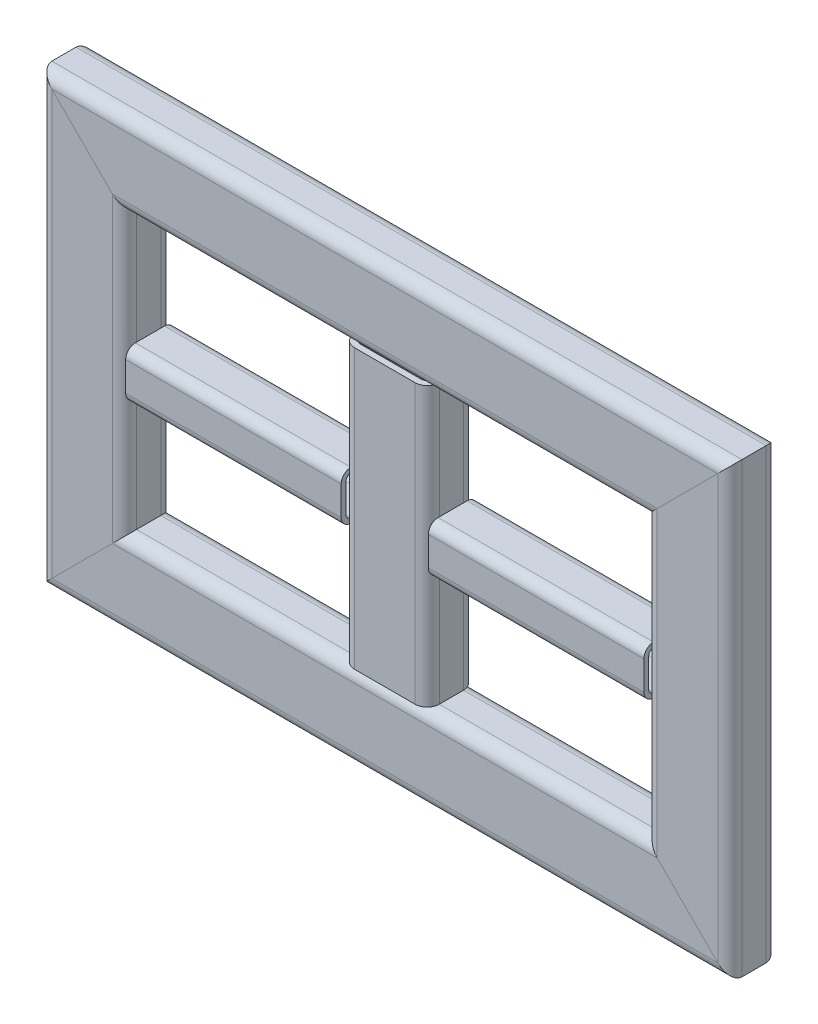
ISO-10303-21;
HEADER;
FILE_DESCRIPTION(('STEP AP214'),'2;1');
FILE_NAME('part.step','',(''),(''),'','','');
FILE_SCHEMA(('AUTOMOTIVE_DESIGN { 1 0 10303 214 1 1 1 1 }'));
ENDSEC;
DATA;
#1=APPLICATION_CONTEXT('core data for automotive mechanical design processes');
#2=APPLICATION_PROTOCOL_DEFINITION('international standard','automotive_design',2000,#1);
#3=PRODUCT_CONTEXT('',#1,'mechanical');
#4=PRODUCT('Part','Part','',(#3));
#5=PRODUCT_RELATED_PRODUCT_CATEGORY('part','',(#4));
#6=PRODUCT_DEFINITION_FORMATION('','',#4);
#7=PRODUCT_DEFINITION_CONTEXT('part definition',#1,'design');
#8=PRODUCT_DEFINITION('design','',#6,#7);
#9=PRODUCT_DEFINITION_SHAPE('','',#8);
#10=(LENGTH_UNIT() NAMED_UNIT(*) SI_UNIT(.MILLI.,.METRE.));
#11=(NAMED_UNIT(*) PLANE_ANGLE_UNIT() SI_UNIT($,.RADIAN.));
#12=(NAMED_UNIT(*) SI_UNIT($,.STERADIAN.) SOLID_ANGLE_UNIT());
#13=UNCERTAINTY_MEASURE_WITH_UNIT(LENGTH_MEASURE(1.E-05),#10,'distance_accuracy_value','');
#14=(GEOMETRIC_REPRESENTATION_CONTEXT(3) GLOBAL_UNCERTAINTY_ASSIGNED_CONTEXT((#13)) GLOBAL_UNIT_ASSIGNED_CONTEXT((#10,
#11,#12)) REPRESENTATION_CONTEXT('',''));
#15=CARTESIAN_POINT('',(0.,0.,0.));
#16=DIRECTION('',(0.,0.,1.));
#17=DIRECTION('',(1.,0.,0.));
#18=AXIS2_PLACEMENT_3D('',#15,#16,#17);
#19=CARTESIAN_POINT('',(250.,20.0000000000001,12.));
#20=DIRECTION('',(0.,-1.,0.));
#21=DIRECTION('',(1.,0.,0.));
#22=AXIS2_PLACEMENT_3D('',#19,#20,#21);
#23=PLANE('',#22);
#24=DIRECTION('',(0.,0.,-1.));
#25=VECTOR('',#24,1.);
#26=CARTESIAN_POINT('',(36.0000000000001,20.,11.9999999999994));
#27=LINE('',#26,#25);
#28=CARTESIAN_POINT('',(36.0000000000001,20.,12.));
#29=VERTEX_POINT('',#28);
#30=CARTESIAN_POINT('',(36.0000000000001,20.,-12.));
#31=VERTEX_POINT('',#30);
#32=EDGE_CURVE('E271',#29,#31,#27,.T.);
#33=ORIENTED_EDGE('',*,*,#32,.F.);
#34=DIRECTION('',(-1.,0.,0.));
#35=VECTOR('',#34,1.);
#36=CARTESIAN_POINT('',(250.,20.0000000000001,12.));
#37=LINE('',#36,#35);
#38=CARTESIAN_POINT('',(214.,20.0000000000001,12.));
#39=VERTEX_POINT('',#38);
#40=EDGE_CURVE('E304',#39,#29,#37,.T.);
#41=ORIENTED_EDGE('',*,*,#40,.F.);
#42=DIRECTION('',(0.,0.,1.));
#43=VECTOR('',#42,1.);
#44=CARTESIAN_POINT('',(214.,20.0000000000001,11.9999999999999));
#45=LINE('',#44,#43);
#46=CARTESIAN_POINT('',(214.,20.0000000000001,-12.));
#47=VERTEX_POINT('',#46);
#48=EDGE_CURVE('E314',#47,#39,#45,.T.);
#49=ORIENTED_EDGE('',*,*,#48,.F.);
#50=DIRECTION('',(-1.,0.,0.));
#51=VECTOR('',#50,1.);
#52=CARTESIAN_POINT('',(250.,20.0000000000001,-12.));
#53=LINE('',#52,#51);
#54=EDGE_CURVE('E335',#47,#31,#53,.T.);
#55=ORIENTED_EDGE('',*,*,#54,.T.);
#56=EDGE_LOOP('',(#33,#41,#49,#55));
#57=FACE_BOUND('',#56,.T.);
#58=ADVANCED_FACE('F121',(#57),#23,.F.);
#59=CARTESIAN_POINT('',(250.,12.0000000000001,-12.));
#60=DIRECTION('',(-1.,0.,0.));
#61=DIRECTION('',(0.,-1.,0.));
#62=AXIS2_PLACEMENT_3D('',#59,#60,#61);
#63=CYLINDRICAL_SURFACE('',#62,8.);
#64=CARTESIAN_POINT('',(36.0000000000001,12.,-12.));
#65=DIRECTION('',(-1.,0.,0.));
#66=DIRECTION('',(0.,0.,1.));
#67=AXIS2_PLACEMENT_3D('',#64,#65,#66);
#68=CIRCLE('',#67,8.);
#69=CARTESIAN_POINT('',(36.0000000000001,11.9999999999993,-20.));
#70=VERTEX_POINT('',#69);
#71=EDGE_CURVE('E270',#31,#70,#68,.T.);
#72=ORIENTED_EDGE('',*,*,#71,.F.);
#73=ORIENTED_EDGE('',*,*,#54,.F.);
#74=CARTESIAN_POINT('',(214.,12.0000000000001,-12.));
#75=DIRECTION('',(1.,0.,0.));
#76=DIRECTION('',(0.,0.,-1.));
#77=AXIS2_PLACEMENT_3D('',#74,#75,#76);
#78=CIRCLE('',#77,8.);
#79=CARTESIAN_POINT('',(214.,12.0000000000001,-20.));
#80=VERTEX_POINT('',#79);
#81=EDGE_CURVE('E209',#80,#47,#78,.T.);
#82=ORIENTED_EDGE('',*,*,#81,.F.);
#83=DIRECTION('',(-1.,0.,0.));
#84=VECTOR('',#83,1.);
#85=CARTESIAN_POINT('',(250.,12.0000000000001,-20.));
#86=LINE('',#85,#84);
#87=EDGE_CURVE('E332',#80,#70,#86,.T.);
#88=ORIENTED_EDGE('',*,*,#87,.T.);
#89=EDGE_LOOP('',(#72,#73,#82,#88));
#90=FACE_BOUND('',#89,.T.);
#91=ADVANCED_FACE('F396',(#90),#63,.T.);
#92=CARTESIAN_POINT('',(250.,-11.9999999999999,-20.));
#93=DIRECTION('',(0.,0.,1.));
#94=DIRECTION('',(1.,0.,0.));
#95=AXIS2_PLACEMENT_3D('',#92,#93,#94);
#96=PLANE('',#95);
#97=DIRECTION('',(0.,-1.,0.));
#98=VECTOR('',#97,1.);
#99=CARTESIAN_POINT('',(36.0000000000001,-11.9999999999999,-20.));
#100=LINE('',#99,#98);
#101=CARTESIAN_POINT('',(36.0000000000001,-12.0000000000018,-20.));
#102=VERTEX_POINT('',#101);
#103=EDGE_CURVE('E268',#70,#102,#100,.T.);
#104=ORIENTED_EDGE('',*,*,#103,.F.);
#105=ORIENTED_EDGE('',*,*,#87,.F.);
#106=DIRECTION('',(0.,1.,0.));
#107=VECTOR('',#106,1.);
#108=CARTESIAN_POINT('',(214.,-11.9999999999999,-20.));
#109=LINE('',#108,#107);
#110=CARTESIAN_POINT('',(214.,-12.0000000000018,-20.));
#111=VERTEX_POINT('',#110);
#112=EDGE_CURVE('E205',#111,#80,#109,.T.);
#113=ORIENTED_EDGE('',*,*,#112,.F.);
#114=DIRECTION('',(-1.,0.,0.));
#115=VECTOR('',#114,1.);
#116=CARTESIAN_POINT('',(250.,-11.9999999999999,-20.));
#117=LINE('',#116,#115);
#118=EDGE_CURVE('E329',#111,#102,#117,.T.);
#119=ORIENTED_EDGE('',*,*,#118,.T.);
#120=EDGE_LOOP('',(#104,#105,#113,#119));
#121=FACE_BOUND('',#120,.T.);
#122=ADVANCED_FACE('F394',(#121),#96,.F.);
#123=CARTESIAN_POINT('',(250.,-11.9999999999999,-12.));
#124=DIRECTION('',(-1.,0.,0.));
#125=DIRECTION('',(0.,-1.,0.));
#126=AXIS2_PLACEMENT_3D('',#123,#124,#125);
#127=CYLINDRICAL_SURFACE('',#126,8.);
#128=CARTESIAN_POINT('',(36.0000000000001,-12.,-12.));
#129=DIRECTION('',(-1.,0.,0.));
#130=DIRECTION('',(0.,0.,1.));
#131=AXIS2_PLACEMENT_3D('',#128,#129,#130);
#132=CIRCLE('',#131,8.);
#133=CARTESIAN_POINT('',(36.0000000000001,-20.,-12.));
#134=VERTEX_POINT('',#133);
#135=EDGE_CURVE('E266',#102,#134,#132,.T.);
#136=ORIENTED_EDGE('',*,*,#135,.F.);
#137=ORIENTED_EDGE('',*,*,#118,.F.);
#138=CARTESIAN_POINT('',(214.,-11.9999999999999,-12.));
#139=DIRECTION('',(1.,0.,0.));
#140=DIRECTION('',(0.,0.,-1.));
#141=AXIS2_PLACEMENT_3D('',#138,#139,#140);
#142=CIRCLE('',#141,8.);
#143=CARTESIAN_POINT('',(214.,-19.9999999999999,-12.));
#144=VERTEX_POINT('',#143);
#145=EDGE_CURVE('E310',#144,#111,#142,.T.);
#146=ORIENTED_EDGE('',*,*,#145,.F.);
#147=DIRECTION('',(-1.,0.,0.));
#148=VECTOR('',#147,1.);
#149=CARTESIAN_POINT('',(250.,-19.9999999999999,-12.));
#150=LINE('',#149,#148);
#151=EDGE_CURVE('E326',#144,#134,#150,.T.);
#152=ORIENTED_EDGE('',*,*,#151,.T.);
#153=EDGE_LOOP('',(#136,#137,#146,#152));
#154=FACE_BOUND('',#153,.T.);
#155=ADVANCED_FACE('F389',(#154),#127,.T.);
#156=CARTESIAN_POINT('',(250.,-19.9999999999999,-12.));
#157=DIRECTION('',(0.,1.,0.));
#158=DIRECTION('',(-1.,0.,0.));
#159=AXIS2_PLACEMENT_3D('',#156,#157,#158);
#160=PLANE('',#159);
#161=DIRECTION('',(0.,0.,1.));
#162=VECTOR('',#161,1.);
#163=CARTESIAN_POINT('',(36.0000000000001,-20.,-12.0000000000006));
#164=LINE('',#163,#162);
#165=CARTESIAN_POINT('',(36.,-20.,12.));
#166=VERTEX_POINT('',#165);
#167=EDGE_CURVE('E260',#134,#166,#164,.T.);
#168=ORIENTED_EDGE('',*,*,#167,.F.);
#169=ORIENTED_EDGE('',*,*,#151,.F.);
#170=DIRECTION('',(0.,0.,-1.));
#171=VECTOR('',#170,1.);
#172=CARTESIAN_POINT('',(214.,-19.9999999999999,-12.0000000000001));
#173=LINE('',#172,#171);
#174=CARTESIAN_POINT('',(214.,-19.9999999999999,12.));
#175=VERTEX_POINT('',#174);
#176=EDGE_CURVE('E308',#175,#144,#173,.T.);
#177=ORIENTED_EDGE('',*,*,#176,.F.);
#178=DIRECTION('',(-1.,0.,0.));
#179=VECTOR('',#178,1.);
#180=CARTESIAN_POINT('',(250.,-19.9999999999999,12.));
#181=LINE('',#180,#179);
#182=EDGE_CURVE('E323',#175,#166,#181,.T.);
#183=ORIENTED_EDGE('',*,*,#182,.T.);
#184=EDGE_LOOP('',(#168,#169,#177,#183));
#185=FACE_BOUND('',#184,.T.);
#186=ADVANCED_FACE('F386',(#185),#160,.F.);
#187=CARTESIAN_POINT('',(250.,-11.9999999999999,12.));
#188=DIRECTION('',(-1.,0.,0.));
#189=DIRECTION('',(0.,-1.,0.));
#190=AXIS2_PLACEMENT_3D('',#187,#188,#189);
#191=CYLINDRICAL_SURFACE('',#190,8.);
#192=CARTESIAN_POINT('',(36.0000000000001,-12.,12.));
#193=DIRECTION('',(-1.,0.,0.));
#194=DIRECTION('',(0.,0.,1.));
#195=AXIS2_PLACEMENT_3D('',#192,#193,#194);
#196=CIRCLE('',#195,8.);
#197=CARTESIAN_POINT('',(36.,-12.,20.));
#198=VERTEX_POINT('',#197);
#199=EDGE_CURVE('E258',#166,#198,#196,.T.);
#200=ORIENTED_EDGE('',*,*,#199,.F.);
#201=ORIENTED_EDGE('',*,*,#182,.F.);
#202=CARTESIAN_POINT('',(214.,-11.9999999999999,12.));
#203=DIRECTION('',(1.,0.,0.));
#204=DIRECTION('',(0.,0.,-1.));
#205=AXIS2_PLACEMENT_3D('',#202,#203,#204);
#206=CIRCLE('',#205,8.);
#207=CARTESIAN_POINT('',(214.,-12.0000000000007,20.));
#208=VERTEX_POINT('',#207);
#209=EDGE_CURVE('E306',#208,#175,#206,.T.);
#210=ORIENTED_EDGE('',*,*,#209,.F.);
#211=DIRECTION('',(-1.,0.,0.));
#212=VECTOR('',#211,1.);
#213=CARTESIAN_POINT('',(250.,-11.9999999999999,20.));
#214=LINE('',#213,#212);
#215=EDGE_CURVE('E320',#208,#198,#214,.T.);
#216=ORIENTED_EDGE('',*,*,#215,.T.);
#217=EDGE_LOOP('',(#200,#201,#210,#216));
#218=FACE_BOUND('',#217,.T.);
#219=ADVANCED_FACE('F379',(#218),#191,.T.);
#220=CARTESIAN_POINT('',(250.,12.0000000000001,20.));
#221=DIRECTION('',(0.,0.,-1.));
#222=DIRECTION('',(-1.,0.,0.));
#223=AXIS2_PLACEMENT_3D('',#220,#221,#222);
#224=PLANE('',#223);
#225=DIRECTION('',(0.,1.,0.));
#226=VECTOR('',#225,1.);
#227=CARTESIAN_POINT('',(36.,12.0000000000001,20.));
#228=LINE('',#227,#226);
#229=CARTESIAN_POINT('',(36.,12.0000000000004,20.));
#230=VERTEX_POINT('',#229);
#231=EDGE_CURVE('E140',#198,#230,#228,.T.);
#232=ORIENTED_EDGE('',*,*,#231,.F.);
#233=ORIENTED_EDGE('',*,*,#215,.F.);
#234=DIRECTION('',(0.,-1.,0.));
#235=VECTOR('',#234,1.);
#236=CARTESIAN_POINT('',(214.,12.0000000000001,20.));
#237=LINE('',#236,#235);
#238=CARTESIAN_POINT('',(214.,12.0000000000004,20.));
#239=VERTEX_POINT('',#238);
#240=EDGE_CURVE('E303',#239,#208,#237,.T.);
#241=ORIENTED_EDGE('',*,*,#240,.F.);
#242=DIRECTION('',(-1.,0.,0.));
#243=VECTOR('',#242,1.);
#244=CARTESIAN_POINT('',(250.,12.0000000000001,20.));
#245=LINE('',#244,#243);
#246=EDGE_CURVE('E317',#239,#230,#245,.T.);
#247=ORIENTED_EDGE('',*,*,#246,.T.);
#248=EDGE_LOOP('',(#232,#233,#241,#247));
#249=FACE_BOUND('',#248,.T.);
#250=ADVANCED_FACE('F376',(#249),#224,.F.);
#251=CARTESIAN_POINT('',(250.,12.0000000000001,12.));
#252=DIRECTION('',(-1.,0.,0.));
#253=DIRECTION('',(0.,-1.,0.));
#254=AXIS2_PLACEMENT_3D('',#251,#252,#253);
#255=CYLINDRICAL_SURFACE('',#254,8.);
#256=CARTESIAN_POINT('',(36.0000000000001,12.,12.));
#257=DIRECTION('',(-1.,0.,0.));
#258=DIRECTION('',(0.,0.,1.));
#259=AXIS2_PLACEMENT_3D('',#256,#257,#258);
#260=CIRCLE('',#259,8.);
#261=EDGE_CURVE('E263',#230,#29,#260,.T.);
#262=ORIENTED_EDGE('',*,*,#261,.F.);
#263=ORIENTED_EDGE('',*,*,#246,.F.);
#264=CARTESIAN_POINT('',(214.,12.0000000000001,12.));
#265=DIRECTION('',(1.,0.,0.));
#266=DIRECTION('',(0.,0.,-1.));
#267=AXIS2_PLACEMENT_3D('',#264,#265,#266);
#268=CIRCLE('',#267,8.);
#269=EDGE_CURVE('E301',#39,#239,#268,.T.);
#270=ORIENTED_EDGE('',*,*,#269,.F.);
#271=ORIENTED_EDGE('',*,*,#40,.T.);
#272=EDGE_LOOP('',(#262,#263,#270,#271));
#273=FACE_BOUND('',#272,.T.);
#274=ADVANCED_FACE('F370',(#273),#255,.T.);
#275=CARTESIAN_POINT('',(214.,-150.,9.99999999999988));
#276=DIRECTION('',(1.,0.,0.));
#277=DIRECTION('',(0.,0.,-1.));
#278=AXIS2_PLACEMENT_3D('',#275,#276,#277);
#279=PLANE('',#278);
#280=DIRECTION('',(0.,-1.,0.));
#281=VECTOR('',#280,1.);
#282=CARTESIAN_POINT('',(214.,12.0000000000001,16.));
#283=LINE('',#282,#281);
#284=CARTESIAN_POINT('',(214.,11.9999999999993,16.));
#285=VERTEX_POINT('',#284);
#286=CARTESIAN_POINT('',(214.,-12.0000000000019,16.));
#287=VERTEX_POINT('',#286);
#288=EDGE_CURVE('E273',#285,#287,#283,.T.);
#289=ORIENTED_EDGE('',*,*,#288,.F.);
#290=CARTESIAN_POINT('',(214.,12.0000000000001,12.));
#291=DIRECTION('',(1.,0.,0.));
#292=DIRECTION('',(0.,0.,-1.));
#293=AXIS2_PLACEMENT_3D('',#290,#291,#292);
#294=CIRCLE('',#293,4.);
#295=CARTESIAN_POINT('',(214.,16.0000000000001,12.));
#296=VERTEX_POINT('',#295);
#297=EDGE_CURVE('E278',#296,#285,#294,.T.);
#298=ORIENTED_EDGE('',*,*,#297,.F.);
#299=DIRECTION('',(0.,0.,1.));
#300=VECTOR('',#299,1.);
#301=CARTESIAN_POINT('',(214.,16.0000000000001,11.9999999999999));
#302=LINE('',#301,#300);
#303=CARTESIAN_POINT('',(214.,16.0000000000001,-12.));
#304=VERTEX_POINT('',#303);
#305=EDGE_CURVE('E283',#304,#296,#302,.T.);
#306=ORIENTED_EDGE('',*,*,#305,.F.);
#307=CARTESIAN_POINT('',(214.,12.0000000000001,-12.));
#308=DIRECTION('',(1.,0.,0.));
#309=DIRECTION('',(0.,0.,-1.));
#310=AXIS2_PLACEMENT_3D('',#307,#308,#309);
#311=CIRCLE('',#310,4.);
#312=CARTESIAN_POINT('',(214.,12.0000000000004,-16.));
#313=VERTEX_POINT('',#312);
#314=EDGE_CURVE('E288',#313,#304,#311,.T.);
#315=ORIENTED_EDGE('',*,*,#314,.F.);
#316=DIRECTION('',(0.,1.,0.));
#317=VECTOR('',#316,1.);
#318=CARTESIAN_POINT('',(214.,-11.9999999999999,-16.));
#319=LINE('',#318,#317);
#320=CARTESIAN_POINT('',(214.,-11.9999999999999,-16.));
#321=VERTEX_POINT('',#320);
#322=EDGE_CURVE('E293',#321,#313,#319,.T.);
#323=ORIENTED_EDGE('',*,*,#322,.F.);
#324=CARTESIAN_POINT('',(214.,-11.9999999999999,-12.));
#325=DIRECTION('',(1.,0.,0.));
#326=DIRECTION('',(0.,0.,-1.));
#327=AXIS2_PLACEMENT_3D('',#324,#325,#326);
#328=CIRCLE('',#327,4.);
#329=CARTESIAN_POINT('',(214.,-15.9999999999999,-12.));
#330=VERTEX_POINT('',#329);
#331=EDGE_CURVE('E254',#330,#321,#328,.T.);
#332=ORIENTED_EDGE('',*,*,#331,.F.);
#333=DIRECTION('',(0.,0.,-1.));
#334=VECTOR('',#333,1.);
#335=CARTESIAN_POINT('',(214.,-15.9999999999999,-12.0000000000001));
#336=LINE('',#335,#334);
#337=CARTESIAN_POINT('',(214.,-15.9999999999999,12.));
#338=VERTEX_POINT('',#337);
#339=EDGE_CURVE('E245',#338,#330,#336,.T.);
#340=ORIENTED_EDGE('',*,*,#339,.F.);
#341=CARTESIAN_POINT('',(214.,-11.9999999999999,12.));
#342=DIRECTION('',(1.,0.,0.));
#343=DIRECTION('',(0.,0.,-1.));
#344=AXIS2_PLACEMENT_3D('',#341,#342,#343);
#345=CIRCLE('',#344,4.);
#346=EDGE_CURVE('E13',#287,#338,#345,.T.);
#347=ORIENTED_EDGE('',*,*,#346,.F.);
#348=EDGE_LOOP('',(#289,#298,#306,#315,#323,#332,#340,#347));
#349=FACE_BOUND('',#348,.T.);
#350=ORIENTED_EDGE('',*,*,#269,.T.);
#351=ORIENTED_EDGE('',*,*,#240,.T.);
#352=ORIENTED_EDGE('',*,*,#209,.T.);
#353=ORIENTED_EDGE('',*,*,#176,.T.);
#354=ORIENTED_EDGE('',*,*,#145,.T.);
#355=ORIENTED_EDGE('',*,*,#112,.T.);
#356=ORIENTED_EDGE('',*,*,#81,.T.);
#357=ORIENTED_EDGE('',*,*,#48,.T.);
#358=EDGE_LOOP('',(#350,#351,#352,#353,#354,#355,#356,#357));
#359=FACE_BOUND('',#358,.T.);
#360=ADVANCED_FACE('F372',(#349,#359),#279,.T.);
#361=CARTESIAN_POINT('',(36.0000000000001,-150.,-9.99999999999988));
#362=DIRECTION('',(-1.,0.,0.));
#363=DIRECTION('',(0.,0.,1.));
#364=AXIS2_PLACEMENT_3D('',#361,#362,#363);
#365=PLANE('',#364);
#366=DIRECTION('',(0.,0.,1.));
#367=VECTOR('',#366,1.);
#368=CARTESIAN_POINT('',(36.0000000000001,-16.,-12.0000000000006));
#369=LINE('',#368,#367);
#370=CARTESIAN_POINT('',(36.0000000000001,-16.,-12.));
#371=VERTEX_POINT('',#370);
#372=CARTESIAN_POINT('',(36.0000000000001,-16.,12.));
#373=VERTEX_POINT('',#372);
#374=EDGE_CURVE('E238',#371,#373,#369,.T.);
#375=ORIENTED_EDGE('',*,*,#374,.F.);
#376=CARTESIAN_POINT('',(36.0000000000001,-12.,-12.));
#377=DIRECTION('',(-1.,0.,0.));
#378=DIRECTION('',(0.,0.,1.));
#379=AXIS2_PLACEMENT_3D('',#376,#377,#378);
#380=CIRCLE('',#379,4.);
#381=CARTESIAN_POINT('',(36.0000000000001,-12.0000000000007,-16.));
#382=VERTEX_POINT('',#381);
#383=EDGE_CURVE('E234',#382,#371,#380,.T.);
#384=ORIENTED_EDGE('',*,*,#383,.F.);
#385=DIRECTION('',(0.,-1.,0.));
#386=VECTOR('',#385,1.);
#387=CARTESIAN_POINT('',(36.0000000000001,-11.9999999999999,-16.));
#388=LINE('',#387,#386);
#389=CARTESIAN_POINT('',(36.0000000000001,12.0000000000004,-16.));
#390=VERTEX_POINT('',#389);
#391=EDGE_CURVE('E297',#390,#382,#388,.T.);
#392=ORIENTED_EDGE('',*,*,#391,.F.);
#393=CARTESIAN_POINT('',(36.0000000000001,12.,-12.));
#394=DIRECTION('',(-1.,0.,0.));
#395=DIRECTION('',(0.,0.,1.));
#396=AXIS2_PLACEMENT_3D('',#393,#394,#395);
#397=CIRCLE('',#396,4.);
#398=CARTESIAN_POINT('',(36.0000000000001,16.,-12.));
#399=VERTEX_POINT('',#398);
#400=EDGE_CURVE('E292',#399,#390,#397,.T.);
#401=ORIENTED_EDGE('',*,*,#400,.F.);
#402=DIRECTION('',(0.,0.,-1.));
#403=VECTOR('',#402,1.);
#404=CARTESIAN_POINT('',(36.0000000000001,16.,11.9999999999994));
#405=LINE('',#404,#403);
#406=CARTESIAN_POINT('',(36.0000000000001,16.,12.));
#407=VERTEX_POINT('',#406);
#408=EDGE_CURVE('E287',#407,#399,#405,.T.);
#409=ORIENTED_EDGE('',*,*,#408,.F.);
#410=CARTESIAN_POINT('',(36.0000000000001,12.,12.));
#411=DIRECTION('',(-1.,0.,0.));
#412=DIRECTION('',(0.,0.,1.));
#413=AXIS2_PLACEMENT_3D('',#410,#411,#412);
#414=CIRCLE('',#413,4.);
#415=CARTESIAN_POINT('',(36.,12.,16.));
#416=VERTEX_POINT('',#415);
#417=EDGE_CURVE('E282',#416,#407,#414,.T.);
#418=ORIENTED_EDGE('',*,*,#417,.F.);
#419=DIRECTION('',(0.,1.,0.));
#420=VECTOR('',#419,1.);
#421=CARTESIAN_POINT('',(36.,12.0000000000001,16.));
#422=LINE('',#421,#420);
#423=CARTESIAN_POINT('',(36.,-12.0000000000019,16.));
#424=VERTEX_POINT('',#423);
#425=EDGE_CURVE('E277',#424,#416,#422,.T.);
#426=ORIENTED_EDGE('',*,*,#425,.F.);
#427=CARTESIAN_POINT('',(36.0000000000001,-12.,12.));
#428=DIRECTION('',(-1.,0.,0.));
#429=DIRECTION('',(0.,0.,1.));
#430=AXIS2_PLACEMENT_3D('',#427,#428,#429);
#431=CIRCLE('',#430,4.);
#432=EDGE_CURVE('E131',#373,#424,#431,.T.);
#433=ORIENTED_EDGE('',*,*,#432,.F.);
#434=EDGE_LOOP('',(#375,#384,#392,#401,#409,#418,#426,#433));
#435=FACE_BOUND('',#434,.T.);
#436=ORIENTED_EDGE('',*,*,#261,.T.);
#437=ORIENTED_EDGE('',*,*,#32,.T.);
#438=ORIENTED_EDGE('',*,*,#71,.T.);
#439=ORIENTED_EDGE('',*,*,#103,.T.);
#440=ORIENTED_EDGE('',*,*,#135,.T.);
#441=ORIENTED_EDGE('',*,*,#167,.T.);
#442=ORIENTED_EDGE('',*,*,#199,.T.);
#443=ORIENTED_EDGE('',*,*,#231,.T.);
#444=EDGE_LOOP('',(#436,#437,#438,#439,#440,#441,#442,#443));
#445=FACE_BOUND('',#444,.T.);
#446=ADVANCED_FACE('F239',(#435,#445),#365,.T.);
#447=CARTESIAN_POINT('',(250.,-15.9999999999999,-12.));
#448=DIRECTION('',(0.,1.,0.));
#449=DIRECTION('',(-1.,0.,0.));
#450=AXIS2_PLACEMENT_3D('',#447,#448,#449);
#451=PLANE('',#450);
#452=DIRECTION('',(-1.,0.,0.));
#453=VECTOR('',#452,1.);
#454=CARTESIAN_POINT('',(250.,-15.9999999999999,-12.));
#455=LINE('',#454,#453);
#456=EDGE_CURVE('E125',#330,#371,#455,.T.);
#457=ORIENTED_EDGE('',*,*,#456,.T.);
#458=ORIENTED_EDGE('',*,*,#374,.T.);
#459=DIRECTION('',(-1.,0.,0.));
#460=VECTOR('',#459,1.);
#461=CARTESIAN_POINT('',(250.,-15.9999999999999,12.));
#462=LINE('',#461,#460);
#463=EDGE_CURVE('E276',#338,#373,#462,.T.);
#464=ORIENTED_EDGE('',*,*,#463,.F.);
#465=ORIENTED_EDGE('',*,*,#339,.T.);
#466=EDGE_LOOP('',(#457,#458,#464,#465));
#467=FACE_BOUND('',#466,.T.);
#468=ADVANCED_FACE('F257',(#467),#451,.T.);
#469=CARTESIAN_POINT('',(250.,-11.9999999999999,-12.));
#470=DIRECTION('',(-1.,0.,0.));
#471=DIRECTION('',(0.,-1.,0.));
#472=AXIS2_PLACEMENT_3D('',#469,#470,#471);
#473=CYLINDRICAL_SURFACE('',#472,4.);
#474=DIRECTION('',(-1.,0.,0.));
#475=VECTOR('',#474,1.);
#476=CARTESIAN_POINT('',(250.,-11.9999999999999,-16.));
#477=LINE('',#476,#475);
#478=EDGE_CURVE('E253',#321,#382,#477,.T.);
#479=ORIENTED_EDGE('',*,*,#478,.T.);
#480=ORIENTED_EDGE('',*,*,#383,.T.);
#481=ORIENTED_EDGE('',*,*,#456,.F.);
#482=ORIENTED_EDGE('',*,*,#331,.T.);
#483=EDGE_LOOP('',(#479,#480,#481,#482));
#484=FACE_BOUND('',#483,.T.);
#485=ADVANCED_FACE('F250',(#484),#473,.F.);
#486=CARTESIAN_POINT('',(250.,-11.9999999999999,-16.));
#487=DIRECTION('',(0.,0.,1.));
#488=DIRECTION('',(1.,0.,0.));
#489=AXIS2_PLACEMENT_3D('',#486,#487,#488);
#490=PLANE('',#489);
#491=DIRECTION('',(-1.,0.,0.));
#492=VECTOR('',#491,1.);
#493=CARTESIAN_POINT('',(250.,12.0000000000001,-16.));
#494=LINE('',#493,#492);
#495=EDGE_CURVE('E299',#313,#390,#494,.T.);
#496=ORIENTED_EDGE('',*,*,#495,.T.);
#497=ORIENTED_EDGE('',*,*,#391,.T.);
#498=ORIENTED_EDGE('',*,*,#478,.F.);
#499=ORIENTED_EDGE('',*,*,#322,.T.);
#500=EDGE_LOOP('',(#496,#497,#498,#499));
#501=FACE_BOUND('',#500,.T.);
#502=ADVANCED_FACE('F421',(#501),#490,.T.);
#503=CARTESIAN_POINT('',(250.,12.0000000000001,-12.));
#504=DIRECTION('',(-1.,0.,0.));
#505=DIRECTION('',(0.,-1.,0.));
#506=AXIS2_PLACEMENT_3D('',#503,#504,#505);
#507=CYLINDRICAL_SURFACE('',#506,4.);
#508=DIRECTION('',(-1.,0.,0.));
#509=VECTOR('',#508,1.);
#510=CARTESIAN_POINT('',(250.,16.0000000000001,-12.));
#511=LINE('',#510,#509);
#512=EDGE_CURVE('E296',#304,#399,#511,.T.);
#513=ORIENTED_EDGE('',*,*,#512,.T.);
#514=ORIENTED_EDGE('',*,*,#400,.T.);
#515=ORIENTED_EDGE('',*,*,#495,.F.);
#516=ORIENTED_EDGE('',*,*,#314,.T.);
#517=EDGE_LOOP('',(#513,#514,#515,#516));
#518=FACE_BOUND('',#517,.T.);
#519=ADVANCED_FACE('F424',(#518),#507,.F.);
#520=CARTESIAN_POINT('',(250.,16.0000000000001,12.));
#521=DIRECTION('',(0.,-1.,0.));
#522=DIRECTION('',(1.,0.,0.));
#523=AXIS2_PLACEMENT_3D('',#520,#521,#522);
#524=PLANE('',#523);
#525=DIRECTION('',(-1.,0.,0.));
#526=VECTOR('',#525,1.);
#527=CARTESIAN_POINT('',(250.,16.0000000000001,12.));
#528=LINE('',#527,#526);
#529=EDGE_CURVE('E291',#296,#407,#528,.T.);
#530=ORIENTED_EDGE('',*,*,#529,.T.);
#531=ORIENTED_EDGE('',*,*,#408,.T.);
#532=ORIENTED_EDGE('',*,*,#512,.F.);
#533=ORIENTED_EDGE('',*,*,#305,.T.);
#534=EDGE_LOOP('',(#530,#531,#532,#533));
#535=FACE_BOUND('',#534,.T.);
#536=ADVANCED_FACE('F427',(#535),#524,.T.);
#537=CARTESIAN_POINT('',(250.,12.0000000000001,12.));
#538=DIRECTION('',(-1.,0.,0.));
#539=DIRECTION('',(0.,-1.,0.));
#540=AXIS2_PLACEMENT_3D('',#537,#538,#539);
#541=CYLINDRICAL_SURFACE('',#540,4.);
#542=DIRECTION('',(-1.,0.,0.));
#543=VECTOR('',#542,1.);
#544=CARTESIAN_POINT('',(250.,12.0000000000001,16.));
#545=LINE('',#544,#543);
#546=EDGE_CURVE('E286',#285,#416,#545,.T.);
#547=ORIENTED_EDGE('',*,*,#546,.T.);
#548=ORIENTED_EDGE('',*,*,#417,.T.);
#549=ORIENTED_EDGE('',*,*,#529,.F.);
#550=ORIENTED_EDGE('',*,*,#297,.T.);
#551=EDGE_LOOP('',(#547,#548,#549,#550));
#552=FACE_BOUND('',#551,.T.);
#553=ADVANCED_FACE('F431',(#552),#541,.F.);
#554=CARTESIAN_POINT('',(250.,12.0000000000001,16.));
#555=DIRECTION('',(0.,0.,-1.));
#556=DIRECTION('',(-1.,0.,0.));
#557=AXIS2_PLACEMENT_3D('',#554,#555,#556);
#558=PLANE('',#557);
#559=DIRECTION('',(-1.,0.,0.));
#560=VECTOR('',#559,1.);
#561=CARTESIAN_POINT('',(250.,-11.9999999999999,16.));
#562=LINE('',#561,#560);
#563=EDGE_CURVE('E281',#287,#424,#562,.T.);
#564=ORIENTED_EDGE('',*,*,#563,.T.);
#565=ORIENTED_EDGE('',*,*,#425,.T.);
#566=ORIENTED_EDGE('',*,*,#546,.F.);
#567=ORIENTED_EDGE('',*,*,#288,.T.);
#568=EDGE_LOOP('',(#564,#565,#566,#567));
#569=FACE_BOUND('',#568,.T.);
#570=ADVANCED_FACE('F434',(#569),#558,.T.);
#571=CARTESIAN_POINT('',(250.,-11.9999999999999,12.));
#572=DIRECTION('',(-1.,0.,0.));
#573=DIRECTION('',(0.,-1.,0.));
#574=AXIS2_PLACEMENT_3D('',#571,#572,#573);
#575=CYLINDRICAL_SURFACE('',#574,4.);
#576=ORIENTED_EDGE('',*,*,#463,.T.);
#577=ORIENTED_EDGE('',*,*,#432,.T.);
#578=ORIENTED_EDGE('',*,*,#563,.F.);
#579=ORIENTED_EDGE('',*,*,#346,.T.);
#580=EDGE_LOOP('',(#576,#577,#578,#579));
#581=FACE_BOUND('',#580,.T.);
#582=ADVANCED_FACE('F123',(#581),#575,.F.);
#583=CLOSED_SHELL('',(#58,#91,#122,#155,#186,#219,#250,#274,#360,#446,#468,#485,#502,#519,#536,
#553,#570,#582));
#584=MANIFOLD_SOLID_BREP('B2',#583);
#585=CARTESIAN_POINT('',(250.,20.0000000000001,12.));
#586=DIRECTION('',(0.,-1.,0.));
#587=DIRECTION('',(1.,0.,0.));
#588=AXIS2_PLACEMENT_3D('',#585,#586,#587);
#589=PLANE('',#588);
#590=DIRECTION('',(0.,0.,-1.));
#591=VECTOR('',#590,1.);
#592=CARTESIAN_POINT('',(-214.,20.,12.0000000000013));
#593=LINE('',#592,#591);
#594=CARTESIAN_POINT('',(-214.,20.,12.));
#595=VERTEX_POINT('',#594);
#596=CARTESIAN_POINT('',(-214.,20.,-12.));
#597=VERTEX_POINT('',#596);
#598=EDGE_CURVE('E119',#595,#597,#593,.T.);
#599=ORIENTED_EDGE('',*,*,#598,.F.);
#600=DIRECTION('',(-1.,0.,0.));
#601=VECTOR('',#600,1.);
#602=CARTESIAN_POINT('',(250.,20.0000000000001,12.));
#603=LINE('',#602,#601);
#604=CARTESIAN_POINT('',(-35.9999999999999,20.,12.));
#605=VERTEX_POINT('',#604);
#606=EDGE_CURVE('E731',#605,#595,#603,.T.);
#607=ORIENTED_EDGE('',*,*,#606,.F.);
#608=DIRECTION('',(0.,0.,1.));
#609=VECTOR('',#608,1.);
#610=CARTESIAN_POINT('',(-35.9999999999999,20.,11.9999999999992));
#611=LINE('',#610,#609);
#612=CARTESIAN_POINT('',(-35.9999999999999,20.,-12.));
#613=VERTEX_POINT('',#612);
#614=EDGE_CURVE('E612',#613,#605,#611,.T.);
#615=ORIENTED_EDGE('',*,*,#614,.F.);
#616=DIRECTION('',(-1.,0.,0.));
#617=VECTOR('',#616,1.);
#618=CARTESIAN_POINT('',(250.,20.0000000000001,-12.));
#619=LINE('',#618,#617);
#620=EDGE_CURVE('E737',#613,#597,#619,.T.);
#621=ORIENTED_EDGE('',*,*,#620,.T.);
#622=EDGE_LOOP('',(#599,#607,#615,#621));
#623=FACE_BOUND('',#622,.T.);
#624=ADVANCED_FACE('F604',(#623),#589,.F.);
#625=CARTESIAN_POINT('',(250.,12.0000000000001,-12.));
#626=DIRECTION('',(-1.,0.,0.));
#627=DIRECTION('',(0.,-1.,0.));
#628=AXIS2_PLACEMENT_3D('',#625,#626,#627);
#629=CYLINDRICAL_SURFACE('',#628,8.);
#630=CARTESIAN_POINT('',(-214.,12.,-12.));
#631=DIRECTION('',(-1.,0.,0.));
#632=DIRECTION('',(0.,0.,1.));
#633=AXIS2_PLACEMENT_3D('',#630,#631,#632);
#634=CIRCLE('',#633,8.);
#635=CARTESIAN_POINT('',(-214.,11.9999999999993,-20.));
#636=VERTEX_POINT('',#635);
#637=EDGE_CURVE('E825',#597,#636,#634,.T.);
#638=ORIENTED_EDGE('',*,*,#637,.F.);
#639=ORIENTED_EDGE('',*,*,#620,.F.);
#640=CARTESIAN_POINT('',(-35.9999999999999,12.,-12.));
#641=DIRECTION('',(1.,0.,0.));
#642=DIRECTION('',(0.,0.,-1.));
#643=AXIS2_PLACEMENT_3D('',#640,#641,#642);
#644=CIRCLE('',#643,8.);
#645=CARTESIAN_POINT('',(-35.9999999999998,12.,-20.));
#646=VERTEX_POINT('',#645);
#647=EDGE_CURVE('E720',#646,#613,#644,.T.);
#648=ORIENTED_EDGE('',*,*,#647,.F.);
#649=DIRECTION('',(-1.,0.,0.));
#650=VECTOR('',#649,1.);
#651=CARTESIAN_POINT('',(250.,12.0000000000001,-20.));
#652=LINE('',#651,#650);
#653=EDGE_CURVE('E740',#646,#636,#652,.T.);
#654=ORIENTED_EDGE('',*,*,#653,.T.);
#655=EDGE_LOOP('',(#638,#639,#648,#654));
#656=FACE_BOUND('',#655,.T.);
#657=ADVANCED_FACE('F859',(#656),#629,.T.);
#658=CARTESIAN_POINT('',(250.,-11.9999999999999,-20.));
#659=DIRECTION('',(0.,0.,1.));
#660=DIRECTION('',(1.,0.,0.));
#661=AXIS2_PLACEMENT_3D('',#658,#659,#660);
#662=PLANE('',#661);
#663=DIRECTION('',(0.,-1.,0.));
#664=VECTOR('',#663,1.);
#665=CARTESIAN_POINT('',(-214.,-11.9999999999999,-20.));
#666=LINE('',#665,#664);
#667=CARTESIAN_POINT('',(-214.,-12.0000000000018,-20.));
#668=VERTEX_POINT('',#667);
#669=EDGE_CURVE('E823',#636,#668,#666,.T.);
#670=ORIENTED_EDGE('',*,*,#669,.F.);
#671=ORIENTED_EDGE('',*,*,#653,.F.);
#672=DIRECTION('',(0.,1.,0.));
#673=VECTOR('',#672,1.);
#674=CARTESIAN_POINT('',(-35.9999999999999,-11.9999999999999,-20.));
#675=LINE('',#674,#673);
#676=CARTESIAN_POINT('',(-35.9999999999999,-12.0000000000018,-20.));
#677=VERTEX_POINT('',#676);
#678=EDGE_CURVE('E850',#677,#646,#675,.T.);
#679=ORIENTED_EDGE('',*,*,#678,.F.);
#680=DIRECTION('',(-1.,0.,0.));
#681=VECTOR('',#680,1.);
#682=CARTESIAN_POINT('',(250.,-11.9999999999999,-20.));
#683=LINE('',#682,#681);
#684=EDGE_CURVE('E750',#677,#668,#683,.T.);
#685=ORIENTED_EDGE('',*,*,#684,.T.);
#686=EDGE_LOOP('',(#670,#671,#679,#685));
#687=FACE_BOUND('',#686,.T.);
#688=ADVANCED_FACE('F861',(#687),#662,.F.);
#689=CARTESIAN_POINT('',(250.,-11.9999999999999,-12.));
#690=DIRECTION('',(-1.,0.,0.));
#691=DIRECTION('',(0.,-1.,0.));
#692=AXIS2_PLACEMENT_3D('',#689,#690,#691);
#693=CYLINDRICAL_SURFACE('',#692,8.);
#694=CARTESIAN_POINT('',(-214.,-12.,-12.));
#695=DIRECTION('',(-1.,0.,0.));
#696=DIRECTION('',(0.,0.,1.));
#697=AXIS2_PLACEMENT_3D('',#694,#695,#696);
#698=CIRCLE('',#697,8.);
#699=CARTESIAN_POINT('',(-214.,-20.,-12.));
#700=VERTEX_POINT('',#699);
#701=EDGE_CURVE('E821',#668,#700,#698,.T.);
#702=ORIENTED_EDGE('',*,*,#701,.F.);
#703=ORIENTED_EDGE('',*,*,#684,.F.);
#704=CARTESIAN_POINT('',(-35.9999999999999,-12.,-12.));
#705=DIRECTION('',(1.,0.,0.));
#706=DIRECTION('',(0.,0.,-1.));
#707=AXIS2_PLACEMENT_3D('',#704,#705,#706);
#708=CIRCLE('',#707,8.);
#709=CARTESIAN_POINT('',(-35.9999999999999,-20.,-12.));
#710=VERTEX_POINT('',#709);
#711=EDGE_CURVE('E848',#710,#677,#708,.T.);
#712=ORIENTED_EDGE('',*,*,#711,.F.);
#713=DIRECTION('',(-1.,0.,0.));
#714=VECTOR('',#713,1.);
#715=CARTESIAN_POINT('',(250.,-19.9999999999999,-12.));
#716=LINE('',#715,#714);
#717=EDGE_CURVE('E753',#710,#700,#716,.T.);
#718=ORIENTED_EDGE('',*,*,#717,.T.);
#719=EDGE_LOOP('',(#702,#703,#712,#718));
#720=FACE_BOUND('',#719,.T.);
#721=ADVANCED_FACE('F867',(#720),#693,.T.);
#722=CARTESIAN_POINT('',(250.,-19.9999999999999,-12.));
#723=DIRECTION('',(0.,1.,0.));
#724=DIRECTION('',(-1.,0.,0.));
#725=AXIS2_PLACEMENT_3D('',#722,#723,#724);
#726=PLANE('',#725);
#727=DIRECTION('',(0.,0.,1.));
#728=VECTOR('',#727,1.);
#729=CARTESIAN_POINT('',(-214.,-20.,-11.9999999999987));
#730=LINE('',#729,#728);
#731=CARTESIAN_POINT('',(-214.,-20.,12.));
#732=VERTEX_POINT('',#731);
#733=EDGE_CURVE('E819',#700,#732,#730,.T.);
#734=ORIENTED_EDGE('',*,*,#733,.F.);
#735=ORIENTED_EDGE('',*,*,#717,.F.);
#736=DIRECTION('',(0.,0.,-1.));
#737=VECTOR('',#736,1.);
#738=CARTESIAN_POINT('',(-35.9999999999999,-20.,-12.0000000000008));
#739=LINE('',#738,#737);
#740=CARTESIAN_POINT('',(-35.9999999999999,-20.,12.));
#741=VERTEX_POINT('',#740);
#742=EDGE_CURVE('E846',#741,#710,#739,.T.);
#743=ORIENTED_EDGE('',*,*,#742,.F.);
#744=DIRECTION('',(-1.,0.,0.));
#745=VECTOR('',#744,1.);
#746=CARTESIAN_POINT('',(250.,-19.9999999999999,12.));
#747=LINE('',#746,#745);
#748=EDGE_CURVE('E756',#741,#732,#747,.T.);
#749=ORIENTED_EDGE('',*,*,#748,.T.);
#750=EDGE_LOOP('',(#734,#735,#743,#749));
#751=FACE_BOUND('',#750,.T.);
#752=ADVANCED_FACE('F871',(#751),#726,.F.);
#753=CARTESIAN_POINT('',(250.,-11.9999999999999,12.));
#754=DIRECTION('',(-1.,0.,0.));
#755=DIRECTION('',(0.,-1.,0.));
#756=AXIS2_PLACEMENT_3D('',#753,#754,#755);
#757=CYLINDRICAL_SURFACE('',#756,8.);
#758=CARTESIAN_POINT('',(-214.,-12.,12.));
#759=DIRECTION('',(-1.,0.,0.));
#760=DIRECTION('',(0.,0.,1.));
#761=AXIS2_PLACEMENT_3D('',#758,#759,#760);
#762=CIRCLE('',#761,8.);
#763=CARTESIAN_POINT('',(-214.,-12.,20.));
#764=VERTEX_POINT('',#763);
#765=EDGE_CURVE('E817',#732,#764,#762,.T.);
#766=ORIENTED_EDGE('',*,*,#765,.F.);
#767=ORIENTED_EDGE('',*,*,#748,.F.);
#768=CARTESIAN_POINT('',(-35.9999999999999,-12.,12.));
#769=DIRECTION('',(1.,0.,0.));
#770=DIRECTION('',(0.,0.,-1.));
#771=AXIS2_PLACEMENT_3D('',#768,#769,#770);
#772=CIRCLE('',#771,8.);
#773=CARTESIAN_POINT('',(-36.,-12.0000000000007,20.));
#774=VERTEX_POINT('',#773);
#775=EDGE_CURVE('E844',#774,#741,#772,.T.);
#776=ORIENTED_EDGE('',*,*,#775,.F.);
#777=DIRECTION('',(-1.,0.,0.));
#778=VECTOR('',#777,1.);
#779=CARTESIAN_POINT('',(250.,-11.9999999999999,20.));
#780=LINE('',#779,#778);
#781=EDGE_CURVE('E759',#774,#764,#780,.T.);
#782=ORIENTED_EDGE('',*,*,#781,.T.);
#783=EDGE_LOOP('',(#766,#767,#776,#782));
#784=FACE_BOUND('',#783,.T.);
#785=ADVANCED_FACE('F876',(#784),#757,.T.);
#786=CARTESIAN_POINT('',(250.,12.0000000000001,20.));
#787=DIRECTION('',(0.,0.,-1.));
#788=DIRECTION('',(-1.,0.,0.));
#789=AXIS2_PLACEMENT_3D('',#786,#787,#788);
#790=PLANE('',#789);
#791=DIRECTION('',(0.,1.,0.));
#792=VECTOR('',#791,1.);
#793=CARTESIAN_POINT('',(-214.,12.0000000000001,20.));
#794=LINE('',#793,#792);
#795=CARTESIAN_POINT('',(-214.,12.0000000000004,20.));
#796=VERTEX_POINT('',#795);
#797=EDGE_CURVE('E815',#764,#796,#794,.T.);
#798=ORIENTED_EDGE('',*,*,#797,.F.);
#799=ORIENTED_EDGE('',*,*,#781,.F.);
#800=DIRECTION('',(0.,-1.,0.));
#801=VECTOR('',#800,1.);
#802=CARTESIAN_POINT('',(-36.,12.0000000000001,20.));
#803=LINE('',#802,#801);
#804=CARTESIAN_POINT('',(-36.,12.0000000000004,20.));
#805=VERTEX_POINT('',#804);
#806=EDGE_CURVE('E734',#805,#774,#803,.T.);
#807=ORIENTED_EDGE('',*,*,#806,.F.);
#808=DIRECTION('',(-1.,0.,0.));
#809=VECTOR('',#808,1.);
#810=CARTESIAN_POINT('',(250.,12.0000000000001,20.));
#811=LINE('',#810,#809);
#812=EDGE_CURVE('E725',#805,#796,#811,.T.);
#813=ORIENTED_EDGE('',*,*,#812,.T.);
#814=EDGE_LOOP('',(#798,#799,#807,#813));
#815=FACE_BOUND('',#814,.T.);
#816=ADVANCED_FACE('F880',(#815),#790,.F.);
#817=CARTESIAN_POINT('',(250.,12.0000000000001,12.));
#818=DIRECTION('',(-1.,0.,0.));
#819=DIRECTION('',(0.,-1.,0.));
#820=AXIS2_PLACEMENT_3D('',#817,#818,#819);
#821=CYLINDRICAL_SURFACE('',#820,8.);
#822=CARTESIAN_POINT('',(-214.,12.,12.));
#823=DIRECTION('',(-1.,0.,0.));
#824=DIRECTION('',(0.,0.,1.));
#825=AXIS2_PLACEMENT_3D('',#822,#823,#824);
#826=CIRCLE('',#825,8.);
#827=EDGE_CURVE('E813',#796,#595,#826,.T.);
#828=ORIENTED_EDGE('',*,*,#827,.F.);
#829=ORIENTED_EDGE('',*,*,#812,.F.);
#830=CARTESIAN_POINT('',(-35.9999999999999,12.,12.));
#831=DIRECTION('',(1.,0.,0.));
#832=DIRECTION('',(0.,0.,-1.));
#833=AXIS2_PLACEMENT_3D('',#830,#831,#832);
#834=CIRCLE('',#833,8.);
#835=EDGE_CURVE('E717',#605,#805,#834,.T.);
#836=ORIENTED_EDGE('',*,*,#835,.F.);
#837=ORIENTED_EDGE('',*,*,#606,.T.);
#838=EDGE_LOOP('',(#828,#829,#836,#837));
#839=FACE_BOUND('',#838,.T.);
#840=ADVANCED_FACE('F730',(#839),#821,.T.);
#841=CARTESIAN_POINT('',(-36.,-150.,9.99999999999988));
#842=DIRECTION('',(1.,0.,0.));
#843=DIRECTION('',(0.,0.,-1.));
#844=AXIS2_PLACEMENT_3D('',#841,#842,#843);
#845=PLANE('',#844);
#846=DIRECTION('',(0.,-1.,0.));
#847=VECTOR('',#846,1.);
#848=CARTESIAN_POINT('',(-35.9999999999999,12.0000000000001,16.));
#849=LINE('',#848,#847);
#850=CARTESIAN_POINT('',(-35.9999999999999,11.9999999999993,16.));
#851=VERTEX_POINT('',#850);
#852=CARTESIAN_POINT('',(-35.9999999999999,-12.0000000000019,16.));
#853=VERTEX_POINT('',#852);
#854=EDGE_CURVE('E794',#851,#853,#849,.T.);
#855=ORIENTED_EDGE('',*,*,#854,.F.);
#856=CARTESIAN_POINT('',(-35.9999999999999,12.,12.));
#857=DIRECTION('',(1.,0.,0.));
#858=DIRECTION('',(0.,0.,-1.));
#859=AXIS2_PLACEMENT_3D('',#856,#857,#858);
#860=CIRCLE('',#859,4.);
#861=CARTESIAN_POINT('',(-35.9999999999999,16.,12.));
#862=VERTEX_POINT('',#861);
#863=EDGE_CURVE('E789',#862,#851,#860,.T.);
#864=ORIENTED_EDGE('',*,*,#863,.F.);
#865=DIRECTION('',(0.,0.,1.));
#866=VECTOR('',#865,1.);
#867=CARTESIAN_POINT('',(-35.9999999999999,16.,11.9999999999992));
#868=LINE('',#867,#866);
#869=CARTESIAN_POINT('',(-35.9999999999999,16.,-12.));
#870=VERTEX_POINT('',#869);
#871=EDGE_CURVE('E832',#870,#862,#868,.T.);
#872=ORIENTED_EDGE('',*,*,#871,.F.);
#873=CARTESIAN_POINT('',(-35.9999999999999,12.,-12.));
#874=DIRECTION('',(1.,0.,0.));
#875=DIRECTION('',(0.,0.,-1.));
#876=AXIS2_PLACEMENT_3D('',#873,#874,#875);
#877=CIRCLE('',#876,4.);
#878=CARTESIAN_POINT('',(-35.9999999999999,12.0000000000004,-16.));
#879=VERTEX_POINT('',#878);
#880=EDGE_CURVE('E835',#879,#870,#877,.T.);
#881=ORIENTED_EDGE('',*,*,#880,.F.);
#882=DIRECTION('',(0.,1.,0.));
#883=VECTOR('',#882,1.);
#884=CARTESIAN_POINT('',(-35.9999999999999,-11.9999999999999,-16.));
#885=LINE('',#884,#883);
#886=CARTESIAN_POINT('',(-35.9999999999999,-12.,-16.));
#887=VERTEX_POINT('',#886);
#888=EDGE_CURVE('E838',#887,#879,#885,.T.);
#889=ORIENTED_EDGE('',*,*,#888,.F.);
#890=CARTESIAN_POINT('',(-35.9999999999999,-12.,-12.));
#891=DIRECTION('',(1.,0.,0.));
#892=DIRECTION('',(0.,0.,-1.));
#893=AXIS2_PLACEMENT_3D('',#890,#891,#892);
#894=CIRCLE('',#893,4.);
#895=CARTESIAN_POINT('',(-35.9999999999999,-16.,-12.));
#896=VERTEX_POINT('',#895);
#897=EDGE_CURVE('E627',#896,#887,#894,.T.);
#898=ORIENTED_EDGE('',*,*,#897,.F.);
#899=DIRECTION('',(0.,0.,-1.));
#900=VECTOR('',#899,1.);
#901=CARTESIAN_POINT('',(-35.9999999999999,-16.,-12.0000000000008));
#902=LINE('',#901,#900);
#903=CARTESIAN_POINT('',(-35.9999999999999,-16.,12.));
#904=VERTEX_POINT('',#903);
#905=EDGE_CURVE('E733',#904,#896,#902,.T.);
#906=ORIENTED_EDGE('',*,*,#905,.F.);
#907=CARTESIAN_POINT('',(-35.9999999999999,-12.,12.));
#908=DIRECTION('',(1.,0.,0.));
#909=DIRECTION('',(0.,0.,-1.));
#910=AXIS2_PLACEMENT_3D('',#907,#908,#909);
#911=CIRCLE('',#910,4.);
#912=EDGE_CURVE('E827',#853,#904,#911,.T.);
#913=ORIENTED_EDGE('',*,*,#912,.F.);
#914=EDGE_LOOP('',(#855,#864,#872,#881,#889,#898,#906,#913));
#915=FACE_BOUND('',#914,.T.);
#916=ORIENTED_EDGE('',*,*,#835,.T.);
#917=ORIENTED_EDGE('',*,*,#806,.T.);
#918=ORIENTED_EDGE('',*,*,#775,.T.);
#919=ORIENTED_EDGE('',*,*,#742,.T.);
#920=ORIENTED_EDGE('',*,*,#711,.T.);
#921=ORIENTED_EDGE('',*,*,#678,.T.);
#922=ORIENTED_EDGE('',*,*,#647,.T.);
#923=ORIENTED_EDGE('',*,*,#614,.T.);
#924=EDGE_LOOP('',(#916,#917,#918,#919,#920,#921,#922,#923));
#925=FACE_BOUND('',#924,.T.);
#926=ADVANCED_FACE('F716',(#915,#925),#845,.T.);
#927=CARTESIAN_POINT('',(-214.,150.,9.99999999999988));
#928=DIRECTION('',(-1.,0.,0.));
#929=DIRECTION('',(0.,0.,1.));
#930=AXIS2_PLACEMENT_3D('',#927,#928,#929);
#931=PLANE('',#930);
#932=DIRECTION('',(0.,0.,1.));
#933=VECTOR('',#932,1.);
#934=CARTESIAN_POINT('',(-214.,-16.,-11.9999999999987));
#935=LINE('',#934,#933);
#936=CARTESIAN_POINT('',(-214.,-16.,-12.));
#937=VERTEX_POINT('',#936);
#938=CARTESIAN_POINT('',(-214.,-16.,12.));
#939=VERTEX_POINT('',#938);
#940=EDGE_CURVE('E811',#937,#939,#935,.T.);
#941=ORIENTED_EDGE('',*,*,#940,.F.);
#942=CARTESIAN_POINT('',(-214.,-12.,-12.));
#943=DIRECTION('',(-1.,0.,0.));
#944=DIRECTION('',(0.,0.,1.));
#945=AXIS2_PLACEMENT_3D('',#942,#943,#944);
#946=CIRCLE('',#945,4.);
#947=CARTESIAN_POINT('',(-214.,-12.0000000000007,-16.));
#948=VERTEX_POINT('',#947);
#949=EDGE_CURVE('E808',#948,#937,#946,.T.);
#950=ORIENTED_EDGE('',*,*,#949,.F.);
#951=DIRECTION('',(0.,-1.,0.));
#952=VECTOR('',#951,1.);
#953=CARTESIAN_POINT('',(-214.,-11.9999999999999,-16.));
#954=LINE('',#953,#952);
#955=CARTESIAN_POINT('',(-214.,12.0000000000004,-16.));
#956=VERTEX_POINT('',#955);
#957=EDGE_CURVE('E805',#956,#948,#954,.T.);
#958=ORIENTED_EDGE('',*,*,#957,.F.);
#959=CARTESIAN_POINT('',(-214.,12.,-12.));
#960=DIRECTION('',(-1.,0.,0.));
#961=DIRECTION('',(0.,0.,1.));
#962=AXIS2_PLACEMENT_3D('',#959,#960,#961);
#963=CIRCLE('',#962,4.);
#964=CARTESIAN_POINT('',(-214.,16.,-12.));
#965=VERTEX_POINT('',#964);
#966=EDGE_CURVE('E802',#965,#956,#963,.T.);
#967=ORIENTED_EDGE('',*,*,#966,.F.);
#968=DIRECTION('',(0.,0.,-1.));
#969=VECTOR('',#968,1.);
#970=CARTESIAN_POINT('',(-214.,16.,12.0000000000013));
#971=LINE('',#970,#969);
#972=CARTESIAN_POINT('',(-214.,16.,12.));
#973=VERTEX_POINT('',#972);
#974=EDGE_CURVE('E797',#973,#965,#971,.T.);
#975=ORIENTED_EDGE('',*,*,#974,.F.);
#976=CARTESIAN_POINT('',(-214.,12.,12.));
#977=DIRECTION('',(-1.,0.,0.));
#978=DIRECTION('',(0.,0.,1.));
#979=AXIS2_PLACEMENT_3D('',#976,#977,#978);
#980=CIRCLE('',#979,4.);
#981=CARTESIAN_POINT('',(-214.,12.,16.));
#982=VERTEX_POINT('',#981);
#983=EDGE_CURVE('E788',#982,#973,#980,.T.);
#984=ORIENTED_EDGE('',*,*,#983,.F.);
#985=DIRECTION('',(0.,1.,0.));
#986=VECTOR('',#985,1.);
#987=CARTESIAN_POINT('',(-214.,12.0000000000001,16.));
#988=LINE('',#987,#986);
#989=CARTESIAN_POINT('',(-214.,-12.0000000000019,16.));
#990=VERTEX_POINT('',#989);
#991=EDGE_CURVE('E796',#990,#982,#988,.T.);
#992=ORIENTED_EDGE('',*,*,#991,.F.);
#993=CARTESIAN_POINT('',(-214.,-12.,12.));
#994=DIRECTION('',(-1.,0.,0.));
#995=DIRECTION('',(0.,0.,1.));
#996=AXIS2_PLACEMENT_3D('',#993,#994,#995);
#997=CIRCLE('',#996,4.);
#998=EDGE_CURVE('E619',#939,#990,#997,.T.);
#999=ORIENTED_EDGE('',*,*,#998,.F.);
#1000=EDGE_LOOP('',(#941,#950,#958,#967,#975,#984,#992,#999));
#1001=FACE_BOUND('',#1000,.T.);
#1002=ORIENTED_EDGE('',*,*,#827,.T.);
#1003=ORIENTED_EDGE('',*,*,#598,.T.);
#1004=ORIENTED_EDGE('',*,*,#637,.T.);
#1005=ORIENTED_EDGE('',*,*,#669,.T.);
#1006=ORIENTED_EDGE('',*,*,#701,.T.);
#1007=ORIENTED_EDGE('',*,*,#733,.T.);
#1008=ORIENTED_EDGE('',*,*,#765,.T.);
#1009=ORIENTED_EDGE('',*,*,#797,.T.);
#1010=EDGE_LOOP('',(#1002,#1003,#1004,#1005,#1006,#1007,#1008,#1009));
#1011=FACE_BOUND('',#1010,.T.);
#1012=ADVANCED_FACE('F864',(#1001,#1011),#931,.T.);
#1013=CARTESIAN_POINT('',(250.,-15.9999999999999,-12.));
#1014=DIRECTION('',(0.,1.,0.));
#1015=DIRECTION('',(-1.,0.,0.));
#1016=AXIS2_PLACEMENT_3D('',#1013,#1014,#1015);
#1017=PLANE('',#1016);
#1018=DIRECTION('',(-1.,0.,0.));
#1019=VECTOR('',#1018,1.);
#1020=CARTESIAN_POINT('',(250.,-15.9999999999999,-12.));
#1021=LINE('',#1020,#1019);
#1022=EDGE_CURVE('E766',#896,#937,#1021,.T.);
#1023=ORIENTED_EDGE('',*,*,#1022,.T.);
#1024=ORIENTED_EDGE('',*,*,#940,.T.);
#1025=DIRECTION('',(-1.,0.,0.));
#1026=VECTOR('',#1025,1.);
#1027=CARTESIAN_POINT('',(250.,-15.9999999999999,12.));
#1028=LINE('',#1027,#1026);
#1029=EDGE_CURVE('E763',#904,#939,#1028,.T.);
#1030=ORIENTED_EDGE('',*,*,#1029,.F.);
#1031=ORIENTED_EDGE('',*,*,#905,.T.);
#1032=EDGE_LOOP('',(#1023,#1024,#1030,#1031));
#1033=FACE_BOUND('',#1032,.T.);
#1034=ADVANCED_FACE('F938',(#1033),#1017,.T.);
#1035=CARTESIAN_POINT('',(250.,-11.9999999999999,-12.));
#1036=DIRECTION('',(-1.,0.,0.));
#1037=DIRECTION('',(0.,-1.,0.));
#1038=AXIS2_PLACEMENT_3D('',#1035,#1036,#1037);
#1039=CYLINDRICAL_SURFACE('',#1038,4.);
#1040=DIRECTION('',(-1.,0.,0.));
#1041=VECTOR('',#1040,1.);
#1042=CARTESIAN_POINT('',(250.,-11.9999999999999,-16.));
#1043=LINE('',#1042,#1041);
#1044=EDGE_CURVE('E769',#887,#948,#1043,.T.);
#1045=ORIENTED_EDGE('',*,*,#1044,.T.);
#1046=ORIENTED_EDGE('',*,*,#949,.T.);
#1047=ORIENTED_EDGE('',*,*,#1022,.F.);
#1048=ORIENTED_EDGE('',*,*,#897,.T.);
#1049=EDGE_LOOP('',(#1045,#1046,#1047,#1048));
#1050=FACE_BOUND('',#1049,.T.);
#1051=ADVANCED_FACE('F947',(#1050),#1039,.F.);
#1052=CARTESIAN_POINT('',(250.,-11.9999999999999,-16.));
#1053=DIRECTION('',(0.,0.,1.));
#1054=DIRECTION('',(1.,0.,0.));
#1055=AXIS2_PLACEMENT_3D('',#1052,#1053,#1054);
#1056=PLANE('',#1055);
#1057=DIRECTION('',(-1.,0.,0.));
#1058=VECTOR('',#1057,1.);
#1059=CARTESIAN_POINT('',(250.,12.0000000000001,-16.));
#1060=LINE('',#1059,#1058);
#1061=EDGE_CURVE('E772',#879,#956,#1060,.T.);
#1062=ORIENTED_EDGE('',*,*,#1061,.T.);
#1063=ORIENTED_EDGE('',*,*,#957,.T.);
#1064=ORIENTED_EDGE('',*,*,#1044,.F.);
#1065=ORIENTED_EDGE('',*,*,#888,.T.);
#1066=EDGE_LOOP('',(#1062,#1063,#1064,#1065));
#1067=FACE_BOUND('',#1066,.T.);
#1068=ADVANCED_FACE('F958',(#1067),#1056,.T.);
#1069=CARTESIAN_POINT('',(250.,12.0000000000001,-12.));
#1070=DIRECTION('',(-1.,0.,0.));
#1071=DIRECTION('',(0.,-1.,0.));
#1072=AXIS2_PLACEMENT_3D('',#1069,#1070,#1071);
#1073=CYLINDRICAL_SURFACE('',#1072,4.);
#1074=DIRECTION('',(-1.,0.,0.));
#1075=VECTOR('',#1074,1.);
#1076=CARTESIAN_POINT('',(250.,16.0000000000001,-12.));
#1077=LINE('',#1076,#1075);
#1078=EDGE_CURVE('E775',#870,#965,#1077,.T.);
#1079=ORIENTED_EDGE('',*,*,#1078,.T.);
#1080=ORIENTED_EDGE('',*,*,#966,.T.);
#1081=ORIENTED_EDGE('',*,*,#1061,.F.);
#1082=ORIENTED_EDGE('',*,*,#880,.T.);
#1083=EDGE_LOOP('',(#1079,#1080,#1081,#1082));
#1084=FACE_BOUND('',#1083,.T.);
#1085=ADVANCED_FACE('F968',(#1084),#1073,.F.);
#1086=CARTESIAN_POINT('',(250.,16.0000000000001,12.));
#1087=DIRECTION('',(0.,-1.,0.));
#1088=DIRECTION('',(1.,0.,0.));
#1089=AXIS2_PLACEMENT_3D('',#1086,#1087,#1088);
#1090=PLANE('',#1089);
#1091=DIRECTION('',(-1.,0.,0.));
#1092=VECTOR('',#1091,1.);
#1093=CARTESIAN_POINT('',(250.,16.0000000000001,12.));
#1094=LINE('',#1093,#1092);
#1095=EDGE_CURVE('E778',#862,#973,#1094,.T.);
#1096=ORIENTED_EDGE('',*,*,#1095,.T.);
#1097=ORIENTED_EDGE('',*,*,#974,.T.);
#1098=ORIENTED_EDGE('',*,*,#1078,.F.);
#1099=ORIENTED_EDGE('',*,*,#871,.T.);
#1100=EDGE_LOOP('',(#1096,#1097,#1098,#1099));
#1101=FACE_BOUND('',#1100,.T.);
#1102=ADVANCED_FACE('F978',(#1101),#1090,.T.);
#1103=CARTESIAN_POINT('',(250.,12.0000000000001,12.));
#1104=DIRECTION('',(-1.,0.,0.));
#1105=DIRECTION('',(0.,-1.,0.));
#1106=AXIS2_PLACEMENT_3D('',#1103,#1104,#1105);
#1107=CYLINDRICAL_SURFACE('',#1106,4.);
#1108=DIRECTION('',(-1.,0.,0.));
#1109=VECTOR('',#1108,1.);
#1110=CARTESIAN_POINT('',(250.,12.0000000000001,16.));
#1111=LINE('',#1110,#1109);
#1112=EDGE_CURVE('E743',#851,#982,#1111,.T.);
#1113=ORIENTED_EDGE('',*,*,#1112,.T.);
#1114=ORIENTED_EDGE('',*,*,#983,.T.);
#1115=ORIENTED_EDGE('',*,*,#1095,.F.);
#1116=ORIENTED_EDGE('',*,*,#863,.T.);
#1117=EDGE_LOOP('',(#1113,#1114,#1115,#1116));
#1118=FACE_BOUND('',#1117,.T.);
#1119=ADVANCED_FACE('F786',(#1118),#1107,.F.);
#1120=CARTESIAN_POINT('',(250.,12.0000000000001,16.));
#1121=DIRECTION('',(0.,0.,-1.));
#1122=DIRECTION('',(-1.,0.,0.));
#1123=AXIS2_PLACEMENT_3D('',#1120,#1121,#1122);
#1124=PLANE('',#1123);
#1125=DIRECTION('',(-1.,0.,0.));
#1126=VECTOR('',#1125,1.);
#1127=CARTESIAN_POINT('',(250.,-11.9999999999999,16.));
#1128=LINE('',#1127,#1126);
#1129=EDGE_CURVE('E738',#853,#990,#1128,.T.);
#1130=ORIENTED_EDGE('',*,*,#1129,.T.);
#1131=ORIENTED_EDGE('',*,*,#991,.T.);
#1132=ORIENTED_EDGE('',*,*,#1112,.F.);
#1133=ORIENTED_EDGE('',*,*,#854,.T.);
#1134=EDGE_LOOP('',(#1130,#1131,#1132,#1133));
#1135=FACE_BOUND('',#1134,.T.);
#1136=ADVANCED_FACE('F793',(#1135),#1124,.T.);
#1137=CARTESIAN_POINT('',(250.,-11.9999999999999,12.));
#1138=DIRECTION('',(-1.,0.,0.));
#1139=DIRECTION('',(0.,-1.,0.));
#1140=AXIS2_PLACEMENT_3D('',#1137,#1138,#1139);
#1141=CYLINDRICAL_SURFACE('',#1140,4.);
#1142=ORIENTED_EDGE('',*,*,#1029,.T.);
#1143=ORIENTED_EDGE('',*,*,#998,.T.);
#1144=ORIENTED_EDGE('',*,*,#1129,.F.);
#1145=ORIENTED_EDGE('',*,*,#912,.T.);
#1146=EDGE_LOOP('',(#1142,#1143,#1144,#1145));
#1147=FACE_BOUND('',#1146,.T.);
#1148=ADVANCED_FACE('F606',(#1147),#1141,.F.);
#1149=CLOSED_SHELL('',(#624,#657,#688,#721,#752,#785,#816,#840,#926,#1012,#1034,#1051,#1068,
#1085,#1102,#1119,#1136,#1148));
#1150=MANIFOLD_SOLID_BREP('B7',#1149);
#1151=CARTESIAN_POINT('',(-225.,150.,9.99999999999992));
#1152=DIRECTION('',(0.,-1.,0.));
#1153=DIRECTION('',(0.,0.,-1.));
#1154=AXIS2_PLACEMENT_3D('',#1151,#1152,#1153);
#1155=CYLINDRICAL_SURFACE('',#1154,10.);
#1156=CARTESIAN_POINT('',(-225.,-125.,9.99999999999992));
#1157=DIRECTION('',(0.707106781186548,-0.707106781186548,0.));
#1158=DIRECTION('',(-0.707106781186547,-0.707106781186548,0.));
#1159=AXIS2_PLACEMENT_3D('',#1156,#1157,#1158);
#1160=ELLIPSE('',#1159,14.142135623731,10.);
#1161=CARTESIAN_POINT('',(-215.,-115.,9.99999999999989));
#1162=VERTEX_POINT('',#1161);
#1163=CARTESIAN_POINT('',(-225.,-125.,19.9999999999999));
#1164=VERTEX_POINT('',#1163);
#1165=EDGE_CURVE('E1231',#1162,#1164,#1160,.T.);
#1166=ORIENTED_EDGE('',*,*,#1165,.F.);
#1167=DIRECTION('',(0.,-1.,0.));
#1168=VECTOR('',#1167,1.);
#1169=CARTESIAN_POINT('',(-215.,150.,9.99999999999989));
#1170=LINE('',#1169,#1168);
#1171=CARTESIAN_POINT('',(-215.,115.,9.99999999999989));
#1172=VERTEX_POINT('',#1171);
#1173=EDGE_CURVE('E1311',#1172,#1162,#1170,.T.);
#1174=ORIENTED_EDGE('',*,*,#1173,.F.);
#1175=CARTESIAN_POINT('',(-225.,125.,9.99999999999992));
#1176=DIRECTION('',(0.707106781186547,0.707106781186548,0.));
#1177=DIRECTION('',(0.707106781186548,-0.707106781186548,0.));
#1178=AXIS2_PLACEMENT_3D('',#1175,#1176,#1177);
#1179=ELLIPSE('',#1178,14.142135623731,10.);
#1180=CARTESIAN_POINT('',(-225.,125.,19.9999999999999));
#1181=VERTEX_POINT('',#1180);
#1182=EDGE_CURVE('E1222',#1181,#1172,#1179,.T.);
#1183=ORIENTED_EDGE('',*,*,#1182,.F.);
#1184=DIRECTION('',(0.,-1.,0.));
#1185=VECTOR('',#1184,1.);
#1186=CARTESIAN_POINT('',(-225.,150.,19.9999999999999));
#1187=LINE('',#1186,#1185);
#1188=EDGE_CURVE('E1091',#1181,#1164,#1187,.T.);
#1189=ORIENTED_EDGE('',*,*,#1188,.T.);
#1190=EDGE_LOOP('',(#1166,#1174,#1183,#1189));
#1191=FACE_BOUND('',#1190,.T.);
#1192=ADVANCED_FACE('F1087',(#1191),#1155,.T.);
#1193=CARTESIAN_POINT('',(-215.,150.,9.99999999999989));
#1194=DIRECTION('',(-1.,0.,0.));
#1195=DIRECTION('',(0.,0.,1.));
#1196=AXIS2_PLACEMENT_3D('',#1193,#1194,#1195);
#1197=PLANE('',#1196);
#1198=DIRECTION('',(0.,0.,1.));
#1199=VECTOR('',#1198,1.);
#1200=CARTESIAN_POINT('',(-215.,-115.,10.0000000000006));
#1201=LINE('',#1200,#1199);
#1202=CARTESIAN_POINT('',(-215.,-115.,-10.0000000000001));
#1203=VERTEX_POINT('',#1202);
#1204=EDGE_CURVE('E1228',#1203,#1162,#1201,.T.);
#1205=ORIENTED_EDGE('',*,*,#1204,.F.);
#1206=DIRECTION('',(0.,-1.,0.));
#1207=VECTOR('',#1206,1.);
#1208=CARTESIAN_POINT('',(-215.,150.,-10.0000000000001));
#1209=LINE('',#1208,#1207);
#1210=CARTESIAN_POINT('',(-215.,115.,-10.0000000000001));
#1211=VERTEX_POINT('',#1210);
#1212=EDGE_CURVE('E1309',#1211,#1203,#1209,.T.);
#1213=ORIENTED_EDGE('',*,*,#1212,.F.);
#1214=DIRECTION('',(0.,0.,-1.));
#1215=VECTOR('',#1214,1.);
#1216=CARTESIAN_POINT('',(-215.,115.,9.99999999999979));
#1217=LINE('',#1216,#1215);
#1218=EDGE_CURVE('E1327',#1172,#1211,#1217,.T.);
#1219=ORIENTED_EDGE('',*,*,#1218,.F.);
#1220=ORIENTED_EDGE('',*,*,#1173,.T.);
#1221=EDGE_LOOP('',(#1205,#1213,#1219,#1220));
#1222=FACE_BOUND('',#1221,.T.);
#1223=ADVANCED_FACE('F1318',(#1222),#1197,.F.);
#1224=CARTESIAN_POINT('',(-225.,150.,-10.0000000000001));
#1225=DIRECTION('',(0.,-1.,0.));
#1226=DIRECTION('',(0.,0.,-1.));
#1227=AXIS2_PLACEMENT_3D('',#1224,#1225,#1226);
#1228=CYLINDRICAL_SURFACE('',#1227,10.);
#1229=CARTESIAN_POINT('',(-225.,-125.,-10.0000000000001));
#1230=DIRECTION('',(0.707106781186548,-0.707106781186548,0.));
#1231=DIRECTION('',(-0.707106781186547,-0.707106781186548,0.));
#1232=AXIS2_PLACEMENT_3D('',#1229,#1230,#1231);
#1233=ELLIPSE('',#1232,14.142135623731,10.);
#1234=CARTESIAN_POINT('',(-225.,-125.,-20.0000000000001));
#1235=VERTEX_POINT('',#1234);
#1236=EDGE_CURVE('E602',#1235,#1203,#1233,.T.);
#1237=ORIENTED_EDGE('',*,*,#1236,.F.);
#1238=DIRECTION('',(0.,-1.,0.));
#1239=VECTOR('',#1238,1.);
#1240=CARTESIAN_POINT('',(-225.,150.,-20.0000000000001));
#1241=LINE('',#1240,#1239);
#1242=CARTESIAN_POINT('',(-225.,125.,-20.0000000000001));
#1243=VERTEX_POINT('',#1242);
#1244=EDGE_CURVE('E1306',#1243,#1235,#1241,.T.);
#1245=ORIENTED_EDGE('',*,*,#1244,.F.);
#1246=CARTESIAN_POINT('',(-225.,125.,-10.0000000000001));
#1247=DIRECTION('',(0.707106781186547,0.707106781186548,0.));
#1248=DIRECTION('',(0.707106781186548,-0.707106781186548,0.));
#1249=AXIS2_PLACEMENT_3D('',#1246,#1247,#1248);
#1250=ELLIPSE('',#1249,14.142135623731,10.);
#1251=EDGE_CURVE('E1324',#1211,#1243,#1250,.T.);
#1252=ORIENTED_EDGE('',*,*,#1251,.F.);
#1253=ORIENTED_EDGE('',*,*,#1212,.T.);
#1254=EDGE_LOOP('',(#1237,#1245,#1252,#1253));
#1255=FACE_BOUND('',#1254,.T.);
#1256=ADVANCED_FACE('F1321',(#1255),#1228,.T.);
#1257=CARTESIAN_POINT('',(-275.,150.,-19.9999999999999));
#1258=DIRECTION('',(0.,0.,1.));
#1259=DIRECTION('',(1.,0.,0.));
#1260=AXIS2_PLACEMENT_3D('',#1257,#1258,#1259);
#1261=PLANE('',#1260);
#1262=DIRECTION('',(0.707106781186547,0.707106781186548,0.));
#1263=VECTOR('',#1262,1.);
#1264=CARTESIAN_POINT('',(-112.5,-12.5,-20.0000000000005));
#1265=LINE('',#1264,#1263);
#1266=CARTESIAN_POINT('',(-275.,-175.,-19.9999999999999));
#1267=VERTEX_POINT('',#1266);
#1268=EDGE_CURVE('E1097',#1267,#1235,#1265,.T.);
#1269=ORIENTED_EDGE('',*,*,#1268,.F.);
#1270=DIRECTION('',(0.,-1.,0.));
#1271=VECTOR('',#1270,1.);
#1272=CARTESIAN_POINT('',(-275.,150.,-19.9999999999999));
#1273=LINE('',#1272,#1271);
#1274=CARTESIAN_POINT('',(-275.,175.,-19.9999999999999));
#1275=VERTEX_POINT('',#1274);
#1276=EDGE_CURVE('E1303',#1275,#1267,#1273,.T.);
#1277=ORIENTED_EDGE('',*,*,#1276,.F.);
#1278=DIRECTION('',(-0.707106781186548,0.707106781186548,0.));
#1279=VECTOR('',#1278,1.);
#1280=CARTESIAN_POINT('',(-262.5,162.5,-20.));
#1281=LINE('',#1280,#1279);
#1282=EDGE_CURVE('E1326',#1243,#1275,#1281,.T.);
#1283=ORIENTED_EDGE('',*,*,#1282,.F.);
#1284=ORIENTED_EDGE('',*,*,#1244,.T.);
#1285=EDGE_LOOP('',(#1269,#1277,#1283,#1284));
#1286=FACE_BOUND('',#1285,.T.);
#1287=ADVANCED_FACE('F1337',(#1286),#1261,.F.);
#1288=CARTESIAN_POINT('',(-275.,150.,-9.99999999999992));
#1289=DIRECTION('',(0.,-1.,0.));
#1290=DIRECTION('',(0.,0.,-1.));
#1291=AXIS2_PLACEMENT_3D('',#1288,#1289,#1290);
#1292=CYLINDRICAL_SURFACE('',#1291,10.);
#1293=CARTESIAN_POINT('',(-275.,-175.,-9.99999999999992));
#1294=DIRECTION('',(0.707106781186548,-0.707106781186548,0.));
#1295=DIRECTION('',(-0.707106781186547,-0.707106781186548,0.));
#1296=AXIS2_PLACEMENT_3D('',#1293,#1294,#1295);
#1297=ELLIPSE('',#1296,14.142135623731,10.);
#1298=CARTESIAN_POINT('',(-285.,-185.,-9.99999999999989));
#1299=VERTEX_POINT('',#1298);
#1300=EDGE_CURVE('E1246',#1299,#1267,#1297,.T.);
#1301=ORIENTED_EDGE('',*,*,#1300,.F.);
#1302=DIRECTION('',(0.,-1.,0.));
#1303=VECTOR('',#1302,1.);
#1304=CARTESIAN_POINT('',(-285.,150.,-9.99999999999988));
#1305=LINE('',#1304,#1303);
#1306=CARTESIAN_POINT('',(-285.,185.,-9.99999999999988));
#1307=VERTEX_POINT('',#1306);
#1308=EDGE_CURVE('E1300',#1307,#1299,#1305,.T.);
#1309=ORIENTED_EDGE('',*,*,#1308,.F.);
#1310=CARTESIAN_POINT('',(-275.,175.,-9.99999999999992));
#1311=DIRECTION('',(0.707106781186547,0.707106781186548,0.));
#1312=DIRECTION('',(0.707106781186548,-0.707106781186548,0.));
#1313=AXIS2_PLACEMENT_3D('',#1310,#1311,#1312);
#1314=ELLIPSE('',#1313,14.142135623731,10.);
#1315=EDGE_CURVE('E1233',#1275,#1307,#1314,.T.);
#1316=ORIENTED_EDGE('',*,*,#1315,.F.);
#1317=ORIENTED_EDGE('',*,*,#1276,.T.);
#1318=EDGE_LOOP('',(#1301,#1309,#1316,#1317));
#1319=FACE_BOUND('',#1318,.T.);
#1320=ADVANCED_FACE('F1335',(#1319),#1292,.T.);
#1321=CARTESIAN_POINT('',(-285.,150.,-9.99999999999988));
#1322=DIRECTION('',(1.,0.,0.));
#1323=DIRECTION('',(0.,0.,-1.));
#1324=AXIS2_PLACEMENT_3D('',#1321,#1322,#1323);
#1325=PLANE('',#1324);
#1326=DIRECTION('',(0.,0.,-1.));
#1327=VECTOR('',#1326,1.);
#1328=CARTESIAN_POINT('',(-285.,-185.,-9.99999999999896));
#1329=LINE('',#1328,#1327);
#1330=CARTESIAN_POINT('',(-285.,-185.,10.0000000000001));
#1331=VERTEX_POINT('',#1330);
#1332=EDGE_CURVE('E1249',#1331,#1299,#1329,.T.);
#1333=ORIENTED_EDGE('',*,*,#1332,.F.);
#1334=DIRECTION('',(0.,-1.,0.));
#1335=VECTOR('',#1334,1.);
#1336=CARTESIAN_POINT('',(-285.,150.,10.0000000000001));
#1337=LINE('',#1336,#1335);
#1338=CARTESIAN_POINT('',(-285.,185.,10.0000000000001));
#1339=VERTEX_POINT('',#1338);
#1340=EDGE_CURVE('E1298',#1339,#1331,#1337,.T.);
#1341=ORIENTED_EDGE('',*,*,#1340,.F.);
#1342=DIRECTION('',(0.,0.,1.));
#1343=VECTOR('',#1342,1.);
#1344=CARTESIAN_POINT('',(-285.,185.,-9.99999999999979));
#1345=LINE('',#1344,#1343);
#1346=EDGE_CURVE('E1227',#1307,#1339,#1345,.T.);
#1347=ORIENTED_EDGE('',*,*,#1346,.F.);
#1348=ORIENTED_EDGE('',*,*,#1308,.T.);
#1349=EDGE_LOOP('',(#1333,#1341,#1347,#1348));
#1350=FACE_BOUND('',#1349,.T.);
#1351=ADVANCED_FACE('F1339',(#1350),#1325,.F.);
#1352=CARTESIAN_POINT('',(-275.,150.,10.0000000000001));
#1353=DIRECTION('',(0.,-1.,0.));
#1354=DIRECTION('',(0.,0.,-1.));
#1355=AXIS2_PLACEMENT_3D('',#1352,#1353,#1354);
#1356=CYLINDRICAL_SURFACE('',#1355,10.);
#1357=CARTESIAN_POINT('',(-275.,-175.,10.0000000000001));
#1358=DIRECTION('',(0.707106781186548,-0.707106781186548,0.));
#1359=DIRECTION('',(-0.707106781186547,-0.707106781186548,0.));
#1360=AXIS2_PLACEMENT_3D('',#1357,#1358,#1359);
#1361=ELLIPSE('',#1360,14.142135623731,10.);
#1362=CARTESIAN_POINT('',(-275.,-175.,20.0000000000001));
#1363=VERTEX_POINT('',#1362);
#1364=EDGE_CURVE('E1210',#1363,#1331,#1361,.T.);
#1365=ORIENTED_EDGE('',*,*,#1364,.F.);
#1366=DIRECTION('',(0.,-1.,0.));
#1367=VECTOR('',#1366,1.);
#1368=CARTESIAN_POINT('',(-275.,150.,20.0000000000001));
#1369=LINE('',#1368,#1367);
#1370=CARTESIAN_POINT('',(-275.,175.,20.0000000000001));
#1371=VERTEX_POINT('',#1370);
#1372=EDGE_CURVE('E1202',#1371,#1363,#1369,.T.);
#1373=ORIENTED_EDGE('',*,*,#1372,.F.);
#1374=CARTESIAN_POINT('',(-275.,175.,10.0000000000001));
#1375=DIRECTION('',(0.707106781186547,0.707106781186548,0.));
#1376=DIRECTION('',(0.707106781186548,-0.707106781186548,0.));
#1377=AXIS2_PLACEMENT_3D('',#1374,#1375,#1376);
#1378=ELLIPSE('',#1377,14.142135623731,10.);
#1379=EDGE_CURVE('E1207',#1339,#1371,#1378,.T.);
#1380=ORIENTED_EDGE('',*,*,#1379,.F.);
#1381=ORIENTED_EDGE('',*,*,#1340,.T.);
#1382=EDGE_LOOP('',(#1365,#1373,#1380,#1381));
#1383=FACE_BOUND('',#1382,.T.);
#1384=ADVANCED_FACE('F1204',(#1383),#1356,.T.);
#1385=CARTESIAN_POINT('',(-225.,150.,-10.0000000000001));
#1386=DIRECTION('',(0.,-1.,0.));
#1387=DIRECTION('',(0.,0.,-1.));
#1388=AXIS2_PLACEMENT_3D('',#1385,#1386,#1387);
#1389=CYLINDRICAL_SURFACE('',#1388,5.);
#1390=DIRECTION('',(0.,-1.,0.));
#1391=VECTOR('',#1390,1.);
#1392=CARTESIAN_POINT('',(-225.,150.,-15.0000000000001));
#1393=LINE('',#1392,#1391);
#1394=CARTESIAN_POINT('',(-225.,125.,-15.0000000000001));
#1395=VERTEX_POINT('',#1394);
#1396=CARTESIAN_POINT('',(-225.,-125.,-15.0000000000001));
#1397=VERTEX_POINT('',#1396);
#1398=EDGE_CURVE('E1255',#1395,#1397,#1393,.T.);
#1399=ORIENTED_EDGE('',*,*,#1398,.T.);
#1400=CARTESIAN_POINT('',(-225.,-125.,-10.0000000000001));
#1401=DIRECTION('',(0.707106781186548,-0.707106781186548,0.));
#1402=DIRECTION('',(-0.707106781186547,-0.707106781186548,0.));
#1403=AXIS2_PLACEMENT_3D('',#1400,#1401,#1402);
#1404=ELLIPSE('',#1403,7.07106781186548,5.);
#1405=CARTESIAN_POINT('',(-220.,-120.,-10.0000000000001));
#1406=VERTEX_POINT('',#1405);
#1407=EDGE_CURVE('E1133',#1397,#1406,#1404,.T.);
#1408=ORIENTED_EDGE('',*,*,#1407,.T.);
#1409=DIRECTION('',(0.,-1.,0.));
#1410=VECTOR('',#1409,1.);
#1411=CARTESIAN_POINT('',(-220.,150.,-10.0000000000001));
#1412=LINE('',#1411,#1410);
#1413=CARTESIAN_POINT('',(-220.,120.,-10.0000000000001));
#1414=VERTEX_POINT('',#1413);
#1415=EDGE_CURVE('E1258',#1414,#1406,#1412,.T.);
#1416=ORIENTED_EDGE('',*,*,#1415,.F.);
#1417=CARTESIAN_POINT('',(-225.,125.,-10.0000000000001));
#1418=DIRECTION('',(0.707106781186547,0.707106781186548,0.));
#1419=DIRECTION('',(0.707106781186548,-0.707106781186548,0.));
#1420=AXIS2_PLACEMENT_3D('',#1417,#1418,#1419);
#1421=ELLIPSE('',#1420,7.07106781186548,5.);
#1422=EDGE_CURVE('E1254',#1414,#1395,#1421,.T.);
#1423=ORIENTED_EDGE('',*,*,#1422,.T.);
#1424=EDGE_LOOP('',(#1399,#1408,#1416,#1423));
#1425=FACE_BOUND('',#1424,.T.);
#1426=ADVANCED_FACE('F1346',(#1425),#1389,.F.);
#1427=CARTESIAN_POINT('',(-220.,150.,9.9999999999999));
#1428=DIRECTION('',(-1.,0.,0.));
#1429=DIRECTION('',(0.,0.,1.));
#1430=AXIS2_PLACEMENT_3D('',#1427,#1428,#1429);
#1431=PLANE('',#1430);
#1432=ORIENTED_EDGE('',*,*,#1415,.T.);
#1433=DIRECTION('',(0.,0.,1.));
#1434=VECTOR('',#1433,1.);
#1435=CARTESIAN_POINT('',(-220.,-120.,10.0000000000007));
#1436=LINE('',#1435,#1434);
#1437=CARTESIAN_POINT('',(-220.,-120.,9.99999999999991));
#1438=VERTEX_POINT('',#1437);
#1439=EDGE_CURVE('E1106',#1406,#1438,#1436,.T.);
#1440=ORIENTED_EDGE('',*,*,#1439,.T.);
#1441=DIRECTION('',(0.,-1.,0.));
#1442=VECTOR('',#1441,1.);
#1443=CARTESIAN_POINT('',(-220.,150.,9.9999999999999));
#1444=LINE('',#1443,#1442);
#1445=CARTESIAN_POINT('',(-220.,120.,9.9999999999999));
#1446=VERTEX_POINT('',#1445);
#1447=EDGE_CURVE('E1263',#1446,#1438,#1444,.T.);
#1448=ORIENTED_EDGE('',*,*,#1447,.F.);
#1449=DIRECTION('',(0.,0.,-1.));
#1450=VECTOR('',#1449,1.);
#1451=CARTESIAN_POINT('',(-220.,120.,9.99999999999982));
#1452=LINE('',#1451,#1450);
#1453=EDGE_CURVE('E1257',#1446,#1414,#1452,.T.);
#1454=ORIENTED_EDGE('',*,*,#1453,.T.);
#1455=EDGE_LOOP('',(#1432,#1440,#1448,#1454));
#1456=FACE_BOUND('',#1455,.T.);
#1457=ADVANCED_FACE('F1388',(#1456),#1431,.T.);
#1458=CARTESIAN_POINT('',(-225.,150.,9.99999999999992));
#1459=DIRECTION('',(0.,-1.,0.));
#1460=DIRECTION('',(0.,0.,-1.));
#1461=AXIS2_PLACEMENT_3D('',#1458,#1459,#1460);
#1462=CYLINDRICAL_SURFACE('',#1461,5.);
#1463=ORIENTED_EDGE('',*,*,#1447,.T.);
#1464=CARTESIAN_POINT('',(-225.,-125.,9.99999999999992));
#1465=DIRECTION('',(0.707106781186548,-0.707106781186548,0.));
#1466=DIRECTION('',(-0.707106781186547,-0.707106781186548,0.));
#1467=AXIS2_PLACEMENT_3D('',#1464,#1465,#1466);
#1468=ELLIPSE('',#1467,7.07106781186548,5.);
#1469=CARTESIAN_POINT('',(-225.,-125.,14.9999999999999));
#1470=VERTEX_POINT('',#1469);
#1471=EDGE_CURVE('E1259',#1438,#1470,#1468,.T.);
#1472=ORIENTED_EDGE('',*,*,#1471,.T.);
#1473=DIRECTION('',(0.,-1.,0.));
#1474=VECTOR('',#1473,1.);
#1475=CARTESIAN_POINT('',(-225.,150.,14.9999999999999));
#1476=LINE('',#1475,#1474);
#1477=CARTESIAN_POINT('',(-225.,125.,14.9999999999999));
#1478=VERTEX_POINT('',#1477);
#1479=EDGE_CURVE('E1268',#1478,#1470,#1476,.T.);
#1480=ORIENTED_EDGE('',*,*,#1479,.F.);
#1481=CARTESIAN_POINT('',(-225.,125.,9.99999999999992));
#1482=DIRECTION('',(0.707106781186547,0.707106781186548,0.));
#1483=DIRECTION('',(0.707106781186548,-0.707106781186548,0.));
#1484=AXIS2_PLACEMENT_3D('',#1481,#1482,#1483);
#1485=ELLIPSE('',#1484,7.07106781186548,5.);
#1486=EDGE_CURVE('E1262',#1478,#1446,#1485,.T.);
#1487=ORIENTED_EDGE('',*,*,#1486,.T.);
#1488=EDGE_LOOP('',(#1463,#1472,#1480,#1487));
#1489=FACE_BOUND('',#1488,.T.);
#1490=ADVANCED_FACE('F1399',(#1489),#1462,.F.);
#1491=CARTESIAN_POINT('',(-225.,150.,14.9999999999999));
#1492=DIRECTION('',(0.,0.,-1.));
#1493=DIRECTION('',(-1.,0.,0.));
#1494=AXIS2_PLACEMENT_3D('',#1491,#1492,#1493);
#1495=PLANE('',#1494);
#1496=ORIENTED_EDGE('',*,*,#1479,.T.);
#1497=DIRECTION('',(-0.707106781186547,-0.707106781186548,0.));
#1498=VECTOR('',#1497,1.);
#1499=CARTESIAN_POINT('',(-87.4999999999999,12.5000000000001,14.9999999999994));
#1500=LINE('',#1499,#1498);
#1501=CARTESIAN_POINT('',(-275.,-175.,15.0000000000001));
#1502=VERTEX_POINT('',#1501);
#1503=EDGE_CURVE('E1264',#1470,#1502,#1500,.T.);
#1504=ORIENTED_EDGE('',*,*,#1503,.T.);
#1505=DIRECTION('',(0.,-1.,0.));
#1506=VECTOR('',#1505,1.);
#1507=CARTESIAN_POINT('',(-275.,150.,15.0000000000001));
#1508=LINE('',#1507,#1506);
#1509=CARTESIAN_POINT('',(-275.,175.,15.0000000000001));
#1510=VERTEX_POINT('',#1509);
#1511=EDGE_CURVE('E1273',#1510,#1502,#1508,.T.);
#1512=ORIENTED_EDGE('',*,*,#1511,.F.);
#1513=DIRECTION('',(0.707106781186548,-0.707106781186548,0.));
#1514=VECTOR('',#1513,1.);
#1515=CARTESIAN_POINT('',(-237.5,137.5,15.));
#1516=LINE('',#1515,#1514);
#1517=EDGE_CURVE('E1267',#1510,#1478,#1516,.T.);
#1518=ORIENTED_EDGE('',*,*,#1517,.T.);
#1519=EDGE_LOOP('',(#1496,#1504,#1512,#1518));
#1520=FACE_BOUND('',#1519,.T.);
#1521=ADVANCED_FACE('F1410',(#1520),#1495,.T.);
#1522=CARTESIAN_POINT('',(-275.,150.,10.0000000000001));
#1523=DIRECTION('',(0.,-1.,0.));
#1524=DIRECTION('',(0.,0.,-1.));
#1525=AXIS2_PLACEMENT_3D('',#1522,#1523,#1524);
#1526=CYLINDRICAL_SURFACE('',#1525,5.);
#1527=ORIENTED_EDGE('',*,*,#1511,.T.);
#1528=CARTESIAN_POINT('',(-275.,-175.,10.0000000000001));
#1529=DIRECTION('',(0.707106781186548,-0.707106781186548,0.));
#1530=DIRECTION('',(-0.707106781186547,-0.707106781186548,0.));
#1531=AXIS2_PLACEMENT_3D('',#1528,#1529,#1530);
#1532=ELLIPSE('',#1531,7.07106781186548,5.);
#1533=CARTESIAN_POINT('',(-280.,-180.,10.0000000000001));
#1534=VERTEX_POINT('',#1533);
#1535=EDGE_CURVE('E1269',#1502,#1534,#1532,.T.);
#1536=ORIENTED_EDGE('',*,*,#1535,.T.);
#1537=DIRECTION('',(0.,-1.,0.));
#1538=VECTOR('',#1537,1.);
#1539=CARTESIAN_POINT('',(-280.,150.,10.0000000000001));
#1540=LINE('',#1539,#1538);
#1541=CARTESIAN_POINT('',(-280.,180.,10.0000000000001));
#1542=VERTEX_POINT('',#1541);
#1543=EDGE_CURVE('E1278',#1542,#1534,#1540,.T.);
#1544=ORIENTED_EDGE('',*,*,#1543,.F.);
#1545=CARTESIAN_POINT('',(-275.,175.,10.0000000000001));
#1546=DIRECTION('',(0.707106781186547,0.707106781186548,0.));
#1547=DIRECTION('',(0.707106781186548,-0.707106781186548,0.));
#1548=AXIS2_PLACEMENT_3D('',#1545,#1546,#1547);
#1549=ELLIPSE('',#1548,7.07106781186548,5.);
#1550=EDGE_CURVE('E1272',#1542,#1510,#1549,.T.);
#1551=ORIENTED_EDGE('',*,*,#1550,.T.);
#1552=EDGE_LOOP('',(#1527,#1536,#1544,#1551));
#1553=FACE_BOUND('',#1552,.T.);
#1554=ADVANCED_FACE('F1421',(#1553),#1526,.F.);
#1555=CARTESIAN_POINT('',(-280.,150.,-9.9999999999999));
#1556=DIRECTION('',(1.,0.,0.));
#1557=DIRECTION('',(0.,0.,-1.));
#1558=AXIS2_PLACEMENT_3D('',#1555,#1556,#1557);
#1559=PLANE('',#1558);
#1560=ORIENTED_EDGE('',*,*,#1543,.T.);
#1561=DIRECTION('',(0.,0.,-1.));
#1562=VECTOR('',#1561,1.);
#1563=CARTESIAN_POINT('',(-280.,-180.,-9.99999999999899));
#1564=LINE('',#1563,#1562);
#1565=CARTESIAN_POINT('',(-280.,-180.,-9.9999999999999));
#1566=VERTEX_POINT('',#1565);
#1567=EDGE_CURVE('E1274',#1534,#1566,#1564,.T.);
#1568=ORIENTED_EDGE('',*,*,#1567,.T.);
#1569=DIRECTION('',(0.,-1.,0.));
#1570=VECTOR('',#1569,1.);
#1571=CARTESIAN_POINT('',(-280.,150.,-9.9999999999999));
#1572=LINE('',#1571,#1570);
#1573=CARTESIAN_POINT('',(-280.,180.,-9.9999999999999));
#1574=VERTEX_POINT('',#1573);
#1575=EDGE_CURVE('E1282',#1574,#1566,#1572,.T.);
#1576=ORIENTED_EDGE('',*,*,#1575,.F.);
#1577=DIRECTION('',(0.,0.,1.));
#1578=VECTOR('',#1577,1.);
#1579=CARTESIAN_POINT('',(-280.,180.,-9.99999999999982));
#1580=LINE('',#1579,#1578);
#1581=EDGE_CURVE('E1277',#1574,#1542,#1580,.T.);
#1582=ORIENTED_EDGE('',*,*,#1581,.T.);
#1583=EDGE_LOOP('',(#1560,#1568,#1576,#1582));
#1584=FACE_BOUND('',#1583,.T.);
#1585=ADVANCED_FACE('F1432',(#1584),#1559,.T.);
#1586=CARTESIAN_POINT('',(-275.,150.,-9.99999999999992));
#1587=DIRECTION('',(0.,-1.,0.));
#1588=DIRECTION('',(0.,0.,-1.));
#1589=AXIS2_PLACEMENT_3D('',#1586,#1587,#1588);
#1590=CYLINDRICAL_SURFACE('',#1589,5.);
#1591=ORIENTED_EDGE('',*,*,#1575,.T.);
#1592=CARTESIAN_POINT('',(-275.,-175.,-9.99999999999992));
#1593=DIRECTION('',(0.707106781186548,-0.707106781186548,0.));
#1594=DIRECTION('',(-0.707106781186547,-0.707106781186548,0.));
#1595=AXIS2_PLACEMENT_3D('',#1592,#1593,#1594);
#1596=ELLIPSE('',#1595,7.07106781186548,5.);
#1597=CARTESIAN_POINT('',(-275.,-175.,-14.9999999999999));
#1598=VERTEX_POINT('',#1597);
#1599=EDGE_CURVE('E1279',#1566,#1598,#1596,.T.);
#1600=ORIENTED_EDGE('',*,*,#1599,.T.);
#1601=DIRECTION('',(0.,-1.,0.));
#1602=VECTOR('',#1601,1.);
#1603=CARTESIAN_POINT('',(-275.,150.,-14.9999999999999));
#1604=LINE('',#1603,#1602);
#1605=CARTESIAN_POINT('',(-275.,175.,-14.9999999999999));
#1606=VERTEX_POINT('',#1605);
#1607=EDGE_CURVE('E1240',#1606,#1598,#1604,.T.);
#1608=ORIENTED_EDGE('',*,*,#1607,.F.);
#1609=CARTESIAN_POINT('',(-275.,175.,-9.99999999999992));
#1610=DIRECTION('',(0.707106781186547,0.707106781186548,0.));
#1611=DIRECTION('',(0.707106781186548,-0.707106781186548,0.));
#1612=AXIS2_PLACEMENT_3D('',#1609,#1610,#1611);
#1613=ELLIPSE('',#1612,7.07106781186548,5.);
#1614=EDGE_CURVE('E1281',#1606,#1574,#1613,.T.);
#1615=ORIENTED_EDGE('',*,*,#1614,.T.);
#1616=EDGE_LOOP('',(#1591,#1600,#1608,#1615));
#1617=FACE_BOUND('',#1616,.T.);
#1618=ADVANCED_FACE('F1443',(#1617),#1590,.F.);
#1619=CARTESIAN_POINT('',(-275.,150.,-14.9999999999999));
#1620=DIRECTION('',(0.,0.,1.));
#1621=DIRECTION('',(1.,0.,0.));
#1622=AXIS2_PLACEMENT_3D('',#1619,#1620,#1621);
#1623=PLANE('',#1622);
#1624=ORIENTED_EDGE('',*,*,#1607,.T.);
#1625=DIRECTION('',(0.707106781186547,0.707106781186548,0.));
#1626=VECTOR('',#1625,1.);
#1627=CARTESIAN_POINT('',(-112.5,-12.5,-15.0000000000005));
#1628=LINE('',#1627,#1626);
#1629=EDGE_CURVE('E1128',#1598,#1397,#1628,.T.);
#1630=ORIENTED_EDGE('',*,*,#1629,.T.);
#1631=ORIENTED_EDGE('',*,*,#1398,.F.);
#1632=DIRECTION('',(-0.707106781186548,0.707106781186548,0.));
#1633=VECTOR('',#1632,1.);
#1634=CARTESIAN_POINT('',(-262.5,162.5,-15.));
#1635=LINE('',#1634,#1633);
#1636=EDGE_CURVE('E1215',#1395,#1606,#1635,.T.);
#1637=ORIENTED_EDGE('',*,*,#1636,.T.);
#1638=EDGE_LOOP('',(#1624,#1630,#1631,#1637));
#1639=FACE_BOUND('',#1638,.T.);
#1640=ADVANCED_FACE('F1454',(#1639),#1623,.T.);
#1641=CARTESIAN_POINT('',(-225.,150.,19.9999999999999));
#1642=DIRECTION('',(0.,0.,-1.));
#1643=DIRECTION('',(-1.,0.,0.));
#1644=AXIS2_PLACEMENT_3D('',#1641,#1642,#1643);
#1645=PLANE('',#1644);
#1646=DIRECTION('',(-0.707106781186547,-0.707106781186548,0.));
#1647=VECTOR('',#1646,1.);
#1648=CARTESIAN_POINT('',(-87.4999999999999,12.5000000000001,19.9999999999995));
#1649=LINE('',#1648,#1647);
#1650=EDGE_CURVE('E1242',#1164,#1363,#1649,.T.);
#1651=ORIENTED_EDGE('',*,*,#1650,.F.);
#1652=ORIENTED_EDGE('',*,*,#1188,.F.);
#1653=DIRECTION('',(0.707106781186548,-0.707106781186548,0.));
#1654=VECTOR('',#1653,1.);
#1655=CARTESIAN_POINT('',(-237.5,137.5,20.));
#1656=LINE('',#1655,#1654);
#1657=EDGE_CURVE('E1214',#1371,#1181,#1656,.T.);
#1658=ORIENTED_EDGE('',*,*,#1657,.F.);
#1659=ORIENTED_EDGE('',*,*,#1372,.T.);
#1660=EDGE_LOOP('',(#1651,#1652,#1658,#1659));
#1661=FACE_BOUND('',#1660,.T.);
#1662=ADVANCED_FACE('F1218',(#1661),#1645,.F.);
#1663=CARTESIAN_POINT('',(-250.,150.,0.));
#1664=DIRECTION('',(0.707106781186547,0.707106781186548,0.));
#1665=DIRECTION('',(-0.707106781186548,0.707106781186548,0.));
#1666=AXIS2_PLACEMENT_3D('',#1663,#1664,#1665);
#1667=PLANE('',#1666);
#1668=ORIENTED_EDGE('',*,*,#1422,.F.);
#1669=ORIENTED_EDGE('',*,*,#1453,.F.);
#1670=ORIENTED_EDGE('',*,*,#1486,.F.);
#1671=ORIENTED_EDGE('',*,*,#1517,.F.);
#1672=ORIENTED_EDGE('',*,*,#1550,.F.);
#1673=ORIENTED_EDGE('',*,*,#1581,.F.);
#1674=ORIENTED_EDGE('',*,*,#1614,.F.);
#1675=ORIENTED_EDGE('',*,*,#1636,.F.);
#1676=EDGE_LOOP('',(#1668,#1669,#1670,#1671,#1672,#1673,#1674,#1675));
#1677=FACE_BOUND('',#1676,.T.);
#1678=ORIENTED_EDGE('',*,*,#1657,.T.);
#1679=ORIENTED_EDGE('',*,*,#1182,.T.);
#1680=ORIENTED_EDGE('',*,*,#1218,.T.);
#1681=ORIENTED_EDGE('',*,*,#1251,.T.);
#1682=ORIENTED_EDGE('',*,*,#1282,.T.);
#1683=ORIENTED_EDGE('',*,*,#1315,.T.);
#1684=ORIENTED_EDGE('',*,*,#1346,.T.);
#1685=ORIENTED_EDGE('',*,*,#1379,.T.);
#1686=EDGE_LOOP('',(#1678,#1679,#1680,#1681,#1682,#1683,#1684,#1685));
#1687=FACE_BOUND('',#1686,.T.);
#1688=ADVANCED_FACE('F1225',(#1677,#1687),#1667,.T.);
#1689=CARTESIAN_POINT('',(-250.,-150.,0.));
#1690=DIRECTION('',(0.707106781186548,-0.707106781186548,0.));
#1691=DIRECTION('',(0.707106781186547,0.707106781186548,0.));
#1692=AXIS2_PLACEMENT_3D('',#1689,#1690,#1691);
#1693=PLANE('',#1692);
#1694=ORIENTED_EDGE('',*,*,#1407,.F.);
#1695=ORIENTED_EDGE('',*,*,#1629,.F.);
#1696=ORIENTED_EDGE('',*,*,#1599,.F.);
#1697=ORIENTED_EDGE('',*,*,#1567,.F.);
#1698=ORIENTED_EDGE('',*,*,#1535,.F.);
#1699=ORIENTED_EDGE('',*,*,#1503,.F.);
#1700=ORIENTED_EDGE('',*,*,#1471,.F.);
#1701=ORIENTED_EDGE('',*,*,#1439,.F.);
#1702=EDGE_LOOP('',(#1694,#1695,#1696,#1697,#1698,#1699,#1700,#1701));
#1703=FACE_BOUND('',#1702,.T.);
#1704=ORIENTED_EDGE('',*,*,#1204,.T.);
#1705=ORIENTED_EDGE('',*,*,#1165,.T.);
#1706=ORIENTED_EDGE('',*,*,#1650,.T.);
#1707=ORIENTED_EDGE('',*,*,#1364,.T.);
#1708=ORIENTED_EDGE('',*,*,#1332,.T.);
#1709=ORIENTED_EDGE('',*,*,#1300,.T.);
#1710=ORIENTED_EDGE('',*,*,#1268,.T.);
#1711=ORIENTED_EDGE('',*,*,#1236,.T.);
#1712=EDGE_LOOP('',(#1704,#1705,#1706,#1707,#1708,#1709,#1710,#1711));
#1713=FACE_BOUND('',#1712,.T.);
#1714=ADVANCED_FACE('F1089',(#1703,#1713),#1693,.T.);
#1715=CLOSED_SHELL('',(#1192,#1223,#1256,#1287,#1320,#1351,#1384,#1426,#1457,#1490,#1521,#1554,
#1585,#1618,#1640,#1662,#1688,#1714));
#1716=MANIFOLD_SOLID_BREP('B113',#1715);
#1717=CARTESIAN_POINT('',(-250.,-125.,9.99999999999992));
#1718=DIRECTION('',(1.,0.,0.));
#1719=DIRECTION('',(0.,0.,-1.));
#1720=AXIS2_PLACEMENT_3D('',#1717,#1718,#1719);
#1721=CYLINDRICAL_SURFACE('',#1720,10.);
#1722=CARTESIAN_POINT('',(-225.,-125.,9.99999999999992));
#1723=DIRECTION('',(-0.707106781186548,0.707106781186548,0.));
#1724=DIRECTION('',(0.707106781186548,0.707106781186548,0.));
#1725=AXIS2_PLACEMENT_3D('',#1722,#1723,#1724);
#1726=ELLIPSE('',#1725,14.142135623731,10.);
#1727=CARTESIAN_POINT('',(-225.,-125.,19.9999999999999));
#1728=VERTEX_POINT('',#1727);
#1729=CARTESIAN_POINT('',(-215.,-115.,9.99999999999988));
#1730=VERTEX_POINT('',#1729);
#1731=EDGE_CURVE('E1715',#1728,#1730,#1726,.T.);
#1732=ORIENTED_EDGE('',*,*,#1731,.F.);
#1733=DIRECTION('',(1.,0.,0.));
#1734=VECTOR('',#1733,1.);
#1735=CARTESIAN_POINT('',(-250.,-125.,19.9999999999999));
#1736=LINE('',#1735,#1734);
#1737=CARTESIAN_POINT('',(225.,-125.,19.9999999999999));
#1738=VERTEX_POINT('',#1737);
#1739=EDGE_CURVE('E1591',#1728,#1738,#1736,.T.);
#1740=ORIENTED_EDGE('',*,*,#1739,.T.);
#1741=CARTESIAN_POINT('',(225.,-125.,9.99999999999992));
#1742=DIRECTION('',(0.707106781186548,0.707106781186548,0.));
#1743=DIRECTION('',(0.707106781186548,-0.707106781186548,0.));
#1744=AXIS2_PLACEMENT_3D('',#1741,#1742,#1743);
#1745=ELLIPSE('',#1744,14.142135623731,10.);
#1746=CARTESIAN_POINT('',(215.,-115.,9.99999999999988));
#1747=VERTEX_POINT('',#1746);
#1748=EDGE_CURVE('E1796',#1747,#1738,#1745,.T.);
#1749=ORIENTED_EDGE('',*,*,#1748,.F.);
#1750=DIRECTION('',(1.,0.,0.));
#1751=VECTOR('',#1750,1.);
#1752=CARTESIAN_POINT('',(-250.,-115.,9.99999999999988));
#1753=LINE('',#1752,#1751);
#1754=EDGE_CURVE('E1789',#1730,#1747,#1753,.T.);
#1755=ORIENTED_EDGE('',*,*,#1754,.F.);
#1756=EDGE_LOOP('',(#1732,#1740,#1749,#1755));
#1757=FACE_BOUND('',#1756,.T.);
#1758=ADVANCED_FACE('F1587',(#1757),#1721,.T.);
#1759=CARTESIAN_POINT('',(-250.,-115.,9.99999999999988));
#1760=DIRECTION('',(0.,-1.,0.));
#1761=DIRECTION('',(0.,0.,-1.));
#1762=AXIS2_PLACEMENT_3D('',#1759,#1760,#1761);
#1763=PLANE('',#1762);
#1764=DIRECTION('',(0.,0.,-1.));
#1765=VECTOR('',#1764,1.);
#1766=CARTESIAN_POINT('',(-215.,-115.,9.99999999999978));
#1767=LINE('',#1766,#1765);
#1768=CARTESIAN_POINT('',(-215.,-115.,-10.0000000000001));
#1769=VERTEX_POINT('',#1768);
#1770=EDGE_CURVE('E1733',#1730,#1769,#1767,.T.);
#1771=ORIENTED_EDGE('',*,*,#1770,.F.);
#1772=ORIENTED_EDGE('',*,*,#1754,.T.);
#1773=DIRECTION('',(0.,0.,1.));
#1774=VECTOR('',#1773,1.);
#1775=CARTESIAN_POINT('',(215.,-115.,10.0000000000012));
#1776=LINE('',#1775,#1774);
#1777=CARTESIAN_POINT('',(215.,-115.,-10.0000000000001));
#1778=VERTEX_POINT('',#1777);
#1779=EDGE_CURVE('E1705',#1778,#1747,#1776,.T.);
#1780=ORIENTED_EDGE('',*,*,#1779,.F.);
#1781=DIRECTION('',(1.,0.,0.));
#1782=VECTOR('',#1781,1.);
#1783=CARTESIAN_POINT('',(-250.,-115.,-10.0000000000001));
#1784=LINE('',#1783,#1782);
#1785=EDGE_CURVE('E1788',#1769,#1778,#1784,.T.);
#1786=ORIENTED_EDGE('',*,*,#1785,.F.);
#1787=EDGE_LOOP('',(#1771,#1772,#1780,#1786));
#1788=FACE_BOUND('',#1787,.T.);
#1789=ADVANCED_FACE('F1843',(#1788),#1763,.F.);
#1790=CARTESIAN_POINT('',(-250.,-125.,-10.0000000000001));
#1791=DIRECTION('',(1.,0.,0.));
#1792=DIRECTION('',(0.,0.,-1.));
#1793=AXIS2_PLACEMENT_3D('',#1790,#1791,#1792);
#1794=CYLINDRICAL_SURFACE('',#1793,10.);
#1795=CARTESIAN_POINT('',(-225.,-125.,-10.0000000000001));
#1796=DIRECTION('',(-0.707106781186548,0.707106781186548,0.));
#1797=DIRECTION('',(0.707106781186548,0.707106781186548,0.));
#1798=AXIS2_PLACEMENT_3D('',#1795,#1796,#1797);
#1799=ELLIPSE('',#1798,14.142135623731,10.);
#1800=CARTESIAN_POINT('',(-225.,-125.,-20.0000000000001));
#1801=VERTEX_POINT('',#1800);
#1802=EDGE_CURVE('E1730',#1769,#1801,#1799,.T.);
#1803=ORIENTED_EDGE('',*,*,#1802,.F.);
#1804=ORIENTED_EDGE('',*,*,#1785,.T.);
#1805=CARTESIAN_POINT('',(225.,-125.,-10.0000000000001));
#1806=DIRECTION('',(0.707106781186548,0.707106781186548,0.));
#1807=DIRECTION('',(0.707106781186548,-0.707106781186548,0.));
#1808=AXIS2_PLACEMENT_3D('',#1805,#1806,#1807);
#1809=ELLIPSE('',#1808,14.142135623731,10.);
#1810=CARTESIAN_POINT('',(225.,-125.,-20.0000000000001));
#1811=VERTEX_POINT('',#1810);
#1812=EDGE_CURVE('E1716',#1811,#1778,#1809,.T.);
#1813=ORIENTED_EDGE('',*,*,#1812,.F.);
#1814=DIRECTION('',(1.,0.,0.));
#1815=VECTOR('',#1814,1.);
#1816=CARTESIAN_POINT('',(-250.,-125.,-20.0000000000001));
#1817=LINE('',#1816,#1815);
#1818=EDGE_CURVE('E1786',#1801,#1811,#1817,.T.);
#1819=ORIENTED_EDGE('',*,*,#1818,.F.);
#1820=EDGE_LOOP('',(#1803,#1804,#1813,#1819));
#1821=FACE_BOUND('',#1820,.T.);
#1822=ADVANCED_FACE('F1841',(#1821),#1794,.T.);
#1823=CARTESIAN_POINT('',(-250.,-175.,-19.9999999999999));
#1824=DIRECTION('',(0.,0.,1.));
#1825=DIRECTION('',(0.,-1.,0.));
#1826=AXIS2_PLACEMENT_3D('',#1823,#1824,#1825);
#1827=PLANE('',#1826);
#1828=DIRECTION('',(-0.707106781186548,-0.707106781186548,0.));
#1829=VECTOR('',#1828,1.);
#1830=CARTESIAN_POINT('',(-262.5,-162.5,-20.));
#1831=LINE('',#1830,#1829);
#1832=CARTESIAN_POINT('',(-275.,-175.,-19.9999999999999));
#1833=VERTEX_POINT('',#1832);
#1834=EDGE_CURVE('E1725',#1801,#1833,#1831,.T.);
#1835=ORIENTED_EDGE('',*,*,#1834,.F.);
#1836=ORIENTED_EDGE('',*,*,#1818,.T.);
#1837=DIRECTION('',(-0.707106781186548,0.707106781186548,0.));
#1838=VECTOR('',#1837,1.);
#1839=CARTESIAN_POINT('',(12.5,87.5000000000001,-20.0000000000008));
#1840=LINE('',#1839,#1838);
#1841=CARTESIAN_POINT('',(275.,-175.,-19.9999999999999));
#1842=VERTEX_POINT('',#1841);
#1843=EDGE_CURVE('E1835',#1842,#1811,#1840,.T.);
#1844=ORIENTED_EDGE('',*,*,#1843,.F.);
#1845=DIRECTION('',(1.,0.,0.));
#1846=VECTOR('',#1845,1.);
#1847=CARTESIAN_POINT('',(-250.,-175.,-19.9999999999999));
#1848=LINE('',#1847,#1846);
#1849=EDGE_CURVE('E1784',#1833,#1842,#1848,.T.);
#1850=ORIENTED_EDGE('',*,*,#1849,.F.);
#1851=EDGE_LOOP('',(#1835,#1836,#1844,#1850));
#1852=FACE_BOUND('',#1851,.T.);
#1853=ADVANCED_FACE('F1850',(#1852),#1827,.F.);
#1854=CARTESIAN_POINT('',(-250.,-175.,-9.99999999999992));
#1855=DIRECTION('',(1.,0.,0.));
#1856=DIRECTION('',(0.,0.,-1.));
#1857=AXIS2_PLACEMENT_3D('',#1854,#1855,#1856);
#1858=CYLINDRICAL_SURFACE('',#1857,10.);
#1859=CARTESIAN_POINT('',(-275.,-175.,-9.99999999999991));
#1860=DIRECTION('',(-0.707106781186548,0.707106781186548,0.));
#1861=DIRECTION('',(0.707106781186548,0.707106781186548,0.));
#1862=AXIS2_PLACEMENT_3D('',#1859,#1860,#1861);
#1863=ELLIPSE('',#1862,14.142135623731,10.);
#1864=CARTESIAN_POINT('',(-285.,-185.,-9.99999999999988));
#1865=VERTEX_POINT('',#1864);
#1866=EDGE_CURVE('E1721',#1833,#1865,#1863,.T.);
#1867=ORIENTED_EDGE('',*,*,#1866,.F.);
#1868=ORIENTED_EDGE('',*,*,#1849,.T.);
#1869=CARTESIAN_POINT('',(275.,-175.,-9.99999999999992));
#1870=DIRECTION('',(0.707106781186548,0.707106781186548,0.));
#1871=DIRECTION('',(0.707106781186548,-0.707106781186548,0.));
#1872=AXIS2_PLACEMENT_3D('',#1869,#1870,#1871);
#1873=ELLIPSE('',#1872,14.142135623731,10.);
#1874=CARTESIAN_POINT('',(285.,-185.,-9.99999999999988));
#1875=VERTEX_POINT('',#1874);
#1876=EDGE_CURVE('E1832',#1875,#1842,#1873,.T.);
#1877=ORIENTED_EDGE('',*,*,#1876,.F.);
#1878=DIRECTION('',(1.,0.,0.));
#1879=VECTOR('',#1878,1.);
#1880=CARTESIAN_POINT('',(-250.,-185.,-9.99999999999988));
#1881=LINE('',#1880,#1879);
#1882=EDGE_CURVE('E1782',#1865,#1875,#1881,.T.);
#1883=ORIENTED_EDGE('',*,*,#1882,.F.);
#1884=EDGE_LOOP('',(#1867,#1868,#1877,#1883));
#1885=FACE_BOUND('',#1884,.T.);
#1886=ADVANCED_FACE('F1855',(#1885),#1858,.T.);
#1887=CARTESIAN_POINT('',(-250.,-185.,-9.99999999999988));
#1888=DIRECTION('',(0.,1.,0.));
#1889=DIRECTION('',(0.,0.,1.));
#1890=AXIS2_PLACEMENT_3D('',#1887,#1888,#1889);
#1891=PLANE('',#1890);
#1892=DIRECTION('',(0.,0.,1.));
#1893=VECTOR('',#1892,1.);
#1894=CARTESIAN_POINT('',(-285.,-185.,-9.99999999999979));
#1895=LINE('',#1894,#1893);
#1896=CARTESIAN_POINT('',(-285.,-185.,10.0000000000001));
#1897=VERTEX_POINT('',#1896);
#1898=EDGE_CURVE('E1597',#1865,#1897,#1895,.T.);
#1899=ORIENTED_EDGE('',*,*,#1898,.F.);
#1900=ORIENTED_EDGE('',*,*,#1882,.T.);
#1901=DIRECTION('',(0.,0.,-1.));
#1902=VECTOR('',#1901,1.);
#1903=CARTESIAN_POINT('',(285.,-185.,-9.9999999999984));
#1904=LINE('',#1903,#1902);
#1905=CARTESIAN_POINT('',(285.,-185.,10.0000000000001));
#1906=VERTEX_POINT('',#1905);
#1907=EDGE_CURVE('E1829',#1906,#1875,#1904,.T.);
#1908=ORIENTED_EDGE('',*,*,#1907,.F.);
#1909=DIRECTION('',(1.,0.,0.));
#1910=VECTOR('',#1909,1.);
#1911=CARTESIAN_POINT('',(-250.,-185.,10.0000000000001));
#1912=LINE('',#1911,#1910);
#1913=EDGE_CURVE('E1740',#1897,#1906,#1912,.T.);
#1914=ORIENTED_EDGE('',*,*,#1913,.F.);
#1915=EDGE_LOOP('',(#1899,#1900,#1908,#1914));
#1916=FACE_BOUND('',#1915,.T.);
#1917=ADVANCED_FACE('F1859',(#1916),#1891,.F.);
#1918=CARTESIAN_POINT('',(-250.,-175.,10.0000000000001));
#1919=DIRECTION('',(1.,0.,0.));
#1920=DIRECTION('',(0.,0.,-1.));
#1921=AXIS2_PLACEMENT_3D('',#1918,#1919,#1920);
#1922=CYLINDRICAL_SURFACE('',#1921,10.);
#1923=CARTESIAN_POINT('',(-275.,-175.,10.0000000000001));
#1924=DIRECTION('',(-0.707106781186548,0.707106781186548,0.));
#1925=DIRECTION('',(0.707106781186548,0.707106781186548,0.));
#1926=AXIS2_PLACEMENT_3D('',#1923,#1924,#1925);
#1927=ELLIPSE('',#1926,14.142135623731,10.);
#1928=CARTESIAN_POINT('',(-275.,-175.,20.0000000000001));
#1929=VERTEX_POINT('',#1928);
#1930=EDGE_CURVE('E1085',#1897,#1929,#1927,.T.);
#1931=ORIENTED_EDGE('',*,*,#1930,.F.);
#1932=ORIENTED_EDGE('',*,*,#1913,.T.);
#1933=CARTESIAN_POINT('',(275.,-175.,10.0000000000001));
#1934=DIRECTION('',(0.707106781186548,0.707106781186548,0.));
#1935=DIRECTION('',(0.707106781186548,-0.707106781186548,0.));
#1936=AXIS2_PLACEMENT_3D('',#1933,#1934,#1935);
#1937=ELLIPSE('',#1936,14.142135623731,10.);
#1938=CARTESIAN_POINT('',(275.,-175.,20.0000000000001));
#1939=VERTEX_POINT('',#1938);
#1940=EDGE_CURVE('E1701',#1939,#1906,#1937,.T.);
#1941=ORIENTED_EDGE('',*,*,#1940,.F.);
#1942=DIRECTION('',(1.,0.,0.));
#1943=VECTOR('',#1942,1.);
#1944=CARTESIAN_POINT('',(-250.,-175.,20.0000000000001));
#1945=LINE('',#1944,#1943);
#1946=EDGE_CURVE('E1696',#1929,#1939,#1945,.T.);
#1947=ORIENTED_EDGE('',*,*,#1946,.F.);
#1948=EDGE_LOOP('',(#1931,#1932,#1941,#1947));
#1949=FACE_BOUND('',#1948,.T.);
#1950=ADVANCED_FACE('F1698',(#1949),#1922,.T.);
#1951=CARTESIAN_POINT('',(-250.,-125.,-10.0000000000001));
#1952=DIRECTION('',(1.,0.,0.));
#1953=DIRECTION('',(0.,0.,-1.));
#1954=AXIS2_PLACEMENT_3D('',#1951,#1952,#1953);
#1955=CYLINDRICAL_SURFACE('',#1954,5.);
#1956=DIRECTION('',(1.,0.,0.));
#1957=VECTOR('',#1956,1.);
#1958=CARTESIAN_POINT('',(-250.,-120.,-10.0000000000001));
#1959=LINE('',#1958,#1957);
#1960=CARTESIAN_POINT('',(-220.,-120.,-10.0000000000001));
#1961=VERTEX_POINT('',#1960);
#1962=CARTESIAN_POINT('',(220.,-120.,-10.0000000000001));
#1963=VERTEX_POINT('',#1962);
#1964=EDGE_CURVE('E1744',#1961,#1963,#1959,.T.);
#1965=ORIENTED_EDGE('',*,*,#1964,.F.);
#1966=CARTESIAN_POINT('',(-225.,-125.,-10.0000000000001));
#1967=DIRECTION('',(-0.707106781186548,0.707106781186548,0.));
#1968=DIRECTION('',(0.707106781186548,0.707106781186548,0.));
#1969=AXIS2_PLACEMENT_3D('',#1966,#1967,#1968);
#1970=ELLIPSE('',#1969,7.07106781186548,5.);
#1971=CARTESIAN_POINT('',(-225.,-125.,-15.0000000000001));
#1972=VERTEX_POINT('',#1971);
#1973=EDGE_CURVE('E1737',#1961,#1972,#1970,.T.);
#1974=ORIENTED_EDGE('',*,*,#1973,.T.);
#1975=DIRECTION('',(1.,0.,0.));
#1976=VECTOR('',#1975,1.);
#1977=CARTESIAN_POINT('',(-250.,-125.,-15.0000000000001));
#1978=LINE('',#1977,#1976);
#1979=CARTESIAN_POINT('',(225.,-125.,-15.0000000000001));
#1980=VERTEX_POINT('',#1979);
#1981=EDGE_CURVE('E1739',#1972,#1980,#1978,.T.);
#1982=ORIENTED_EDGE('',*,*,#1981,.T.);
#1983=CARTESIAN_POINT('',(225.,-125.,-10.0000000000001));
#1984=DIRECTION('',(0.707106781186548,0.707106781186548,0.));
#1985=DIRECTION('',(0.707106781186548,-0.707106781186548,0.));
#1986=AXIS2_PLACEMENT_3D('',#1983,#1984,#1985);
#1987=ELLIPSE('',#1986,7.07106781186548,5.);
#1988=EDGE_CURVE('E1745',#1980,#1963,#1987,.T.);
#1989=ORIENTED_EDGE('',*,*,#1988,.T.);
#1990=EDGE_LOOP('',(#1965,#1974,#1982,#1989));
#1991=FACE_BOUND('',#1990,.T.);
#1992=ADVANCED_FACE('F1865',(#1991),#1955,.F.);
#1993=CARTESIAN_POINT('',(-250.,-120.,9.9999999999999));
#1994=DIRECTION('',(0.,-1.,0.));
#1995=DIRECTION('',(0.,0.,-1.));
#1996=AXIS2_PLACEMENT_3D('',#1993,#1994,#1995);
#1997=PLANE('',#1996);
#1998=DIRECTION('',(1.,0.,0.));
#1999=VECTOR('',#1998,1.);
#2000=CARTESIAN_POINT('',(-250.,-120.,9.9999999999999));
#2001=LINE('',#2000,#1999);
#2002=CARTESIAN_POINT('',(-220.,-120.,9.9999999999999));
#2003=VERTEX_POINT('',#2002);
#2004=CARTESIAN_POINT('',(220.,-120.,9.9999999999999));
#2005=VERTEX_POINT('',#2004);
#2006=EDGE_CURVE('E1749',#2003,#2005,#2001,.T.);
#2007=ORIENTED_EDGE('',*,*,#2006,.F.);
#2008=DIRECTION('',(0.,0.,-1.));
#2009=VECTOR('',#2008,1.);
#2010=CARTESIAN_POINT('',(-220.,-120.,9.99999999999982));
#2011=LINE('',#2010,#2009);
#2012=EDGE_CURVE('E1741',#2003,#1961,#2011,.T.);
#2013=ORIENTED_EDGE('',*,*,#2012,.T.);
#2014=ORIENTED_EDGE('',*,*,#1964,.T.);
#2015=DIRECTION('',(0.,0.,1.));
#2016=VECTOR('',#2015,1.);
#2017=CARTESIAN_POINT('',(220.,-120.,10.0000000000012));
#2018=LINE('',#2017,#2016);
#2019=EDGE_CURVE('E1750',#1963,#2005,#2018,.T.);
#2020=ORIENTED_EDGE('',*,*,#2019,.T.);
#2021=EDGE_LOOP('',(#2007,#2013,#2014,#2020));
#2022=FACE_BOUND('',#2021,.T.);
#2023=ADVANCED_FACE('F1871',(#2022),#1997,.T.);
#2024=CARTESIAN_POINT('',(-250.,-125.,9.99999999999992));
#2025=DIRECTION('',(1.,0.,0.));
#2026=DIRECTION('',(0.,0.,-1.));
#2027=AXIS2_PLACEMENT_3D('',#2024,#2025,#2026);
#2028=CYLINDRICAL_SURFACE('',#2027,5.);
#2029=DIRECTION('',(1.,0.,0.));
#2030=VECTOR('',#2029,1.);
#2031=CARTESIAN_POINT('',(-250.,-125.,14.9999999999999));
#2032=LINE('',#2031,#2030);
#2033=CARTESIAN_POINT('',(-225.,-125.,14.9999999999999));
#2034=VERTEX_POINT('',#2033);
#2035=CARTESIAN_POINT('',(225.,-125.,14.9999999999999));
#2036=VERTEX_POINT('',#2035);
#2037=EDGE_CURVE('E1754',#2034,#2036,#2032,.T.);
#2038=ORIENTED_EDGE('',*,*,#2037,.F.);
#2039=CARTESIAN_POINT('',(-225.,-125.,9.99999999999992));
#2040=DIRECTION('',(-0.707106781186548,0.707106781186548,0.));
#2041=DIRECTION('',(0.707106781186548,0.707106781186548,0.));
#2042=AXIS2_PLACEMENT_3D('',#2039,#2040,#2041);
#2043=ELLIPSE('',#2042,7.07106781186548,5.);
#2044=EDGE_CURVE('E1746',#2034,#2003,#2043,.T.);
#2045=ORIENTED_EDGE('',*,*,#2044,.T.);
#2046=ORIENTED_EDGE('',*,*,#2006,.T.);
#2047=CARTESIAN_POINT('',(225.,-125.,9.99999999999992));
#2048=DIRECTION('',(0.707106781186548,0.707106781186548,0.));
#2049=DIRECTION('',(0.707106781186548,-0.707106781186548,0.));
#2050=AXIS2_PLACEMENT_3D('',#2047,#2048,#2049);
#2051=ELLIPSE('',#2050,7.07106781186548,5.);
#2052=EDGE_CURVE('E1755',#2005,#2036,#2051,.T.);
#2053=ORIENTED_EDGE('',*,*,#2052,.T.);
#2054=EDGE_LOOP('',(#2038,#2045,#2046,#2053));
#2055=FACE_BOUND('',#2054,.T.);
#2056=ADVANCED_FACE('F1875',(#2055),#2028,.F.);
#2057=CARTESIAN_POINT('',(-250.,-125.,14.9999999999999));
#2058=DIRECTION('',(0.,0.,-1.));
#2059=DIRECTION('',(0.,1.,0.));
#2060=AXIS2_PLACEMENT_3D('',#2057,#2058,#2059);
#2061=PLANE('',#2060);
#2062=DIRECTION('',(1.,0.,0.));
#2063=VECTOR('',#2062,1.);
#2064=CARTESIAN_POINT('',(-250.,-175.,15.0000000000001));
#2065=LINE('',#2064,#2063);
#2066=CARTESIAN_POINT('',(-275.,-175.,15.0000000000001));
#2067=VERTEX_POINT('',#2066);
#2068=CARTESIAN_POINT('',(275.,-175.,15.0000000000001));
#2069=VERTEX_POINT('',#2068);
#2070=EDGE_CURVE('E1759',#2067,#2069,#2065,.T.);
#2071=ORIENTED_EDGE('',*,*,#2070,.F.);
#2072=DIRECTION('',(0.707106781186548,0.707106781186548,0.));
#2073=VECTOR('',#2072,1.);
#2074=CARTESIAN_POINT('',(-237.5,-137.5,15.));
#2075=LINE('',#2074,#2073);
#2076=EDGE_CURVE('E1751',#2067,#2034,#2075,.T.);
#2077=ORIENTED_EDGE('',*,*,#2076,.T.);
#2078=ORIENTED_EDGE('',*,*,#2037,.T.);
#2079=DIRECTION('',(0.707106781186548,-0.707106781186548,0.));
#2080=VECTOR('',#2079,1.);
#2081=CARTESIAN_POINT('',(-12.5000000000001,112.5,14.9999999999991));
#2082=LINE('',#2081,#2080);
#2083=EDGE_CURVE('E1760',#2036,#2069,#2082,.T.);
#2084=ORIENTED_EDGE('',*,*,#2083,.T.);
#2085=EDGE_LOOP('',(#2071,#2077,#2078,#2084));
#2086=FACE_BOUND('',#2085,.T.);
#2087=ADVANCED_FACE('F1879',(#2086),#2061,.T.);
#2088=CARTESIAN_POINT('',(-250.,-175.,10.0000000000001));
#2089=DIRECTION('',(1.,0.,0.));
#2090=DIRECTION('',(0.,0.,-1.));
#2091=AXIS2_PLACEMENT_3D('',#2088,#2089,#2090);
#2092=CYLINDRICAL_SURFACE('',#2091,5.);
#2093=DIRECTION('',(1.,0.,0.));
#2094=VECTOR('',#2093,1.);
#2095=CARTESIAN_POINT('',(-250.,-180.,10.0000000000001));
#2096=LINE('',#2095,#2094);
#2097=CARTESIAN_POINT('',(-280.,-180.,10.0000000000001));
#2098=VERTEX_POINT('',#2097);
#2099=CARTESIAN_POINT('',(280.000000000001,-180.,10.0000000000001));
#2100=VERTEX_POINT('',#2099);
#2101=EDGE_CURVE('E1764',#2098,#2100,#2096,.T.);
#2102=ORIENTED_EDGE('',*,*,#2101,.F.);
#2103=CARTESIAN_POINT('',(-275.,-175.,10.0000000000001));
#2104=DIRECTION('',(-0.707106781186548,0.707106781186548,0.));
#2105=DIRECTION('',(0.707106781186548,0.707106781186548,0.));
#2106=AXIS2_PLACEMENT_3D('',#2103,#2104,#2105);
#2107=ELLIPSE('',#2106,7.07106781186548,5.);
#2108=EDGE_CURVE('E1756',#2098,#2067,#2107,.T.);
#2109=ORIENTED_EDGE('',*,*,#2108,.T.);
#2110=ORIENTED_EDGE('',*,*,#2070,.T.);
#2111=CARTESIAN_POINT('',(275.,-175.,10.0000000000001));
#2112=DIRECTION('',(0.707106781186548,0.707106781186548,0.));
#2113=DIRECTION('',(0.707106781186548,-0.707106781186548,0.));
#2114=AXIS2_PLACEMENT_3D('',#2111,#2112,#2113);
#2115=ELLIPSE('',#2114,7.07106781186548,5.);
#2116=EDGE_CURVE('E1765',#2069,#2100,#2115,.T.);
#2117=ORIENTED_EDGE('',*,*,#2116,.T.);
#2118=EDGE_LOOP('',(#2102,#2109,#2110,#2117));
#2119=FACE_BOUND('',#2118,.T.);
#2120=ADVANCED_FACE('F1883',(#2119),#2092,.F.);
#2121=CARTESIAN_POINT('',(-250.,-180.,-9.9999999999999));
#2122=DIRECTION('',(0.,1.,0.));
#2123=DIRECTION('',(0.,0.,1.));
#2124=AXIS2_PLACEMENT_3D('',#2121,#2122,#2123);
#2125=PLANE('',#2124);
#2126=DIRECTION('',(1.,0.,0.));
#2127=VECTOR('',#2126,1.);
#2128=CARTESIAN_POINT('',(-250.,-180.,-9.9999999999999));
#2129=LINE('',#2128,#2127);
#2130=CARTESIAN_POINT('',(-280.,-180.,-9.9999999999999));
#2131=VERTEX_POINT('',#2130);
#2132=CARTESIAN_POINT('',(280.,-180.,-9.9999999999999));
#2133=VERTEX_POINT('',#2132);
#2134=EDGE_CURVE('E1768',#2131,#2133,#2129,.T.);
#2135=ORIENTED_EDGE('',*,*,#2134,.F.);
#2136=DIRECTION('',(0.,0.,1.));
#2137=VECTOR('',#2136,1.);
#2138=CARTESIAN_POINT('',(-280.,-180.,-9.99999999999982));
#2139=LINE('',#2138,#2137);
#2140=EDGE_CURVE('E1761',#2131,#2098,#2139,.T.);
#2141=ORIENTED_EDGE('',*,*,#2140,.T.);
#2142=ORIENTED_EDGE('',*,*,#2101,.T.);
#2143=DIRECTION('',(0.,0.,-1.));
#2144=VECTOR('',#2143,1.);
#2145=CARTESIAN_POINT('',(280.,-180.,-9.99999999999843));
#2146=LINE('',#2145,#2144);
#2147=EDGE_CURVE('E1769',#2100,#2133,#2146,.T.);
#2148=ORIENTED_EDGE('',*,*,#2147,.T.);
#2149=EDGE_LOOP('',(#2135,#2141,#2142,#2148));
#2150=FACE_BOUND('',#2149,.T.);
#2151=ADVANCED_FACE('F1887',(#2150),#2125,.T.);
#2152=CARTESIAN_POINT('',(-250.,-175.,-9.99999999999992));
#2153=DIRECTION('',(1.,0.,0.));
#2154=DIRECTION('',(0.,0.,-1.));
#2155=AXIS2_PLACEMENT_3D('',#2152,#2153,#2154);
#2156=CYLINDRICAL_SURFACE('',#2155,5.);
#2157=DIRECTION('',(1.,0.,0.));
#2158=VECTOR('',#2157,1.);
#2159=CARTESIAN_POINT('',(-250.,-175.,-14.9999999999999));
#2160=LINE('',#2159,#2158);
#2161=CARTESIAN_POINT('',(-275.,-175.,-14.9999999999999));
#2162=VERTEX_POINT('',#2161);
#2163=CARTESIAN_POINT('',(275.,-175.,-14.9999999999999));
#2164=VERTEX_POINT('',#2163);
#2165=EDGE_CURVE('E1771',#2162,#2164,#2160,.T.);
#2166=ORIENTED_EDGE('',*,*,#2165,.F.);
#2167=CARTESIAN_POINT('',(-275.,-175.,-9.99999999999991));
#2168=DIRECTION('',(-0.707106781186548,0.707106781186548,0.));
#2169=DIRECTION('',(0.707106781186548,0.707106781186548,0.));
#2170=AXIS2_PLACEMENT_3D('',#2167,#2168,#2169);
#2171=ELLIPSE('',#2170,7.07106781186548,5.);
#2172=EDGE_CURVE('E1766',#2162,#2131,#2171,.T.);
#2173=ORIENTED_EDGE('',*,*,#2172,.T.);
#2174=ORIENTED_EDGE('',*,*,#2134,.T.);
#2175=CARTESIAN_POINT('',(275.,-175.,-9.99999999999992));
#2176=DIRECTION('',(0.707106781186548,0.707106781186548,0.));
#2177=DIRECTION('',(0.707106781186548,-0.707106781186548,0.));
#2178=AXIS2_PLACEMENT_3D('',#2175,#2176,#2177);
#2179=ELLIPSE('',#2178,7.07106781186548,5.);
#2180=EDGE_CURVE('E1774',#2133,#2164,#2179,.T.);
#2181=ORIENTED_EDGE('',*,*,#2180,.T.);
#2182=EDGE_LOOP('',(#2166,#2173,#2174,#2181));
#2183=FACE_BOUND('',#2182,.T.);
#2184=ADVANCED_FACE('F1891',(#2183),#2156,.F.);
#2185=CARTESIAN_POINT('',(-250.,-175.,-14.9999999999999));
#2186=DIRECTION('',(0.,0.,1.));
#2187=DIRECTION('',(0.,-1.,0.));
#2188=AXIS2_PLACEMENT_3D('',#2185,#2186,#2187);
#2189=PLANE('',#2188);
#2190=ORIENTED_EDGE('',*,*,#1981,.F.);
#2191=DIRECTION('',(-0.707106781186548,-0.707106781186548,0.));
#2192=VECTOR('',#2191,1.);
#2193=CARTESIAN_POINT('',(-262.5,-162.5,-15.));
#2194=LINE('',#2193,#2192);
#2195=EDGE_CURVE('E1605',#1972,#2162,#2194,.T.);
#2196=ORIENTED_EDGE('',*,*,#2195,.T.);
#2197=ORIENTED_EDGE('',*,*,#2165,.T.);
#2198=DIRECTION('',(-0.707106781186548,0.707106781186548,0.));
#2199=VECTOR('',#2198,1.);
#2200=CARTESIAN_POINT('',(12.5,87.5000000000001,-15.0000000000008));
#2201=LINE('',#2200,#2199);
#2202=EDGE_CURVE('E1706',#2164,#1980,#2201,.T.);
#2203=ORIENTED_EDGE('',*,*,#2202,.T.);
#2204=EDGE_LOOP('',(#2190,#2196,#2197,#2203));
#2205=FACE_BOUND('',#2204,.T.);
#2206=ADVANCED_FACE('F1868',(#2205),#2189,.T.);
#2207=CARTESIAN_POINT('',(-250.,-125.,19.9999999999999));
#2208=DIRECTION('',(0.,0.,-1.));
#2209=DIRECTION('',(0.,1.,0.));
#2210=AXIS2_PLACEMENT_3D('',#2207,#2208,#2209);
#2211=PLANE('',#2210);
#2212=DIRECTION('',(0.707106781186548,0.707106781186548,0.));
#2213=VECTOR('',#2212,1.);
#2214=CARTESIAN_POINT('',(-237.5,-137.5,20.));
#2215=LINE('',#2214,#2213);
#2216=EDGE_CURVE('E1710',#1929,#1728,#2215,.T.);
#2217=ORIENTED_EDGE('',*,*,#2216,.F.);
#2218=ORIENTED_EDGE('',*,*,#1946,.T.);
#2219=DIRECTION('',(0.707106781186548,-0.707106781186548,0.));
#2220=VECTOR('',#2219,1.);
#2221=CARTESIAN_POINT('',(-12.5000000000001,112.5,19.9999999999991));
#2222=LINE('',#2221,#2220);
#2223=EDGE_CURVE('E1798',#1738,#1939,#2222,.T.);
#2224=ORIENTED_EDGE('',*,*,#2223,.F.);
#2225=ORIENTED_EDGE('',*,*,#1739,.F.);
#2226=EDGE_LOOP('',(#2217,#2218,#2224,#2225));
#2227=FACE_BOUND('',#2226,.T.);
#2228=ADVANCED_FACE('F1711',(#2227),#2211,.F.);
#2229=CARTESIAN_POINT('',(250.,-150.,0.));
#2230=DIRECTION('',(0.707106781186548,0.707106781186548,0.));
#2231=DIRECTION('',(-0.707106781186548,0.707106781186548,0.));
#2232=AXIS2_PLACEMENT_3D('',#2229,#2230,#2231);
#2233=PLANE('',#2232);
#2234=ORIENTED_EDGE('',*,*,#1988,.F.);
#2235=ORIENTED_EDGE('',*,*,#2202,.F.);
#2236=ORIENTED_EDGE('',*,*,#2180,.F.);
#2237=ORIENTED_EDGE('',*,*,#2147,.F.);
#2238=ORIENTED_EDGE('',*,*,#2116,.F.);
#2239=ORIENTED_EDGE('',*,*,#2083,.F.);
#2240=ORIENTED_EDGE('',*,*,#2052,.F.);
#2241=ORIENTED_EDGE('',*,*,#2019,.F.);
#2242=EDGE_LOOP('',(#2234,#2235,#2236,#2237,#2238,#2239,#2240,#2241));
#2243=FACE_BOUND('',#2242,.T.);
#2244=ORIENTED_EDGE('',*,*,#1779,.T.);
#2245=ORIENTED_EDGE('',*,*,#1748,.T.);
#2246=ORIENTED_EDGE('',*,*,#2223,.T.);
#2247=ORIENTED_EDGE('',*,*,#1940,.T.);
#2248=ORIENTED_EDGE('',*,*,#1907,.T.);
#2249=ORIENTED_EDGE('',*,*,#1876,.T.);
#2250=ORIENTED_EDGE('',*,*,#1843,.T.);
#2251=ORIENTED_EDGE('',*,*,#1812,.T.);
#2252=EDGE_LOOP('',(#2244,#2245,#2246,#2247,#2248,#2249,#2250,#2251));
#2253=FACE_BOUND('',#2252,.T.);
#2254=ADVANCED_FACE('F1801',(#2243,#2253),#2233,.T.);
#2255=CARTESIAN_POINT('',(-250.,-150.,0.));
#2256=DIRECTION('',(-0.707106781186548,0.707106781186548,0.));
#2257=DIRECTION('',(-0.707106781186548,-0.707106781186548,0.));
#2258=AXIS2_PLACEMENT_3D('',#2255,#2256,#2257);
#2259=PLANE('',#2258);
#2260=ORIENTED_EDGE('',*,*,#1973,.F.);
#2261=ORIENTED_EDGE('',*,*,#2012,.F.);
#2262=ORIENTED_EDGE('',*,*,#2044,.F.);
#2263=ORIENTED_EDGE('',*,*,#2076,.F.);
#2264=ORIENTED_EDGE('',*,*,#2108,.F.);
#2265=ORIENTED_EDGE('',*,*,#2140,.F.);
#2266=ORIENTED_EDGE('',*,*,#2172,.F.);
#2267=ORIENTED_EDGE('',*,*,#2195,.F.);
#2268=EDGE_LOOP('',(#2260,#2261,#2262,#2263,#2264,#2265,#2266,#2267));
#2269=FACE_BOUND('',#2268,.T.);
#2270=ORIENTED_EDGE('',*,*,#2216,.T.);
#2271=ORIENTED_EDGE('',*,*,#1731,.T.);
#2272=ORIENTED_EDGE('',*,*,#1770,.T.);
#2273=ORIENTED_EDGE('',*,*,#1802,.T.);
#2274=ORIENTED_EDGE('',*,*,#1834,.T.);
#2275=ORIENTED_EDGE('',*,*,#1866,.T.);
#2276=ORIENTED_EDGE('',*,*,#1898,.T.);
#2277=ORIENTED_EDGE('',*,*,#1930,.T.);
#2278=EDGE_LOOP('',(#2270,#2271,#2272,#2273,#2274,#2275,#2276,#2277));
#2279=FACE_BOUND('',#2278,.T.);
#2280=ADVANCED_FACE('F1589',(#2269,#2279),#2259,.T.);
#2281=CLOSED_SHELL('',(#1758,#1789,#1822,#1853,#1886,#1917,#1950,#1992,#2023,#2056,#2087,#2120,
#2151,#2184,#2206,#2228,#2254,#2280));
#2282=MANIFOLD_SOLID_BREP('B596',#2281);
#2283=CARTESIAN_POINT('',(250.,125.,9.99999999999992));
#2284=DIRECTION('',(-1.,0.,0.));
#2285=DIRECTION('',(0.,0.,1.));
#2286=AXIS2_PLACEMENT_3D('',#2283,#2284,#2285);
#2287=CYLINDRICAL_SURFACE('',#2286,10.);
#2288=CARTESIAN_POINT('',(-225.,125.,9.99999999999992));
#2289=DIRECTION('',(-0.707106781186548,-0.707106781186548,0.));
#2290=DIRECTION('',(-0.707106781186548,0.707106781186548,0.));
#2291=AXIS2_PLACEMENT_3D('',#2288,#2289,#2290);
#2292=ELLIPSE('',#2291,14.142135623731,10.);
#2293=CARTESIAN_POINT('',(-215.,115.,9.99999999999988));
#2294=VERTEX_POINT('',#2293);
#2295=CARTESIAN_POINT('',(-225.,125.,19.9999999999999));
#2296=VERTEX_POINT('',#2295);
#2297=EDGE_CURVE('E2231',#2294,#2296,#2292,.T.);
#2298=ORIENTED_EDGE('',*,*,#2297,.F.);
#2299=DIRECTION('',(-1.,0.,0.));
#2300=VECTOR('',#2299,1.);
#2301=CARTESIAN_POINT('',(250.,115.,9.99999999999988));
#2302=LINE('',#2301,#2300);
#2303=CARTESIAN_POINT('',(215.,115.,9.99999999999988));
#2304=VERTEX_POINT('',#2303);
#2305=EDGE_CURVE('E2311',#2304,#2294,#2302,.T.);
#2306=ORIENTED_EDGE('',*,*,#2305,.F.);
#2307=CARTESIAN_POINT('',(225.,125.,9.99999999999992));
#2308=DIRECTION('',(0.707106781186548,-0.707106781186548,0.));
#2309=DIRECTION('',(-0.707106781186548,-0.707106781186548,0.));
#2310=AXIS2_PLACEMENT_3D('',#2307,#2308,#2309);
#2311=ELLIPSE('',#2310,14.142135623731,10.);
#2312=CARTESIAN_POINT('',(225.,125.,19.9999999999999));
#2313=VERTEX_POINT('',#2312);
#2314=EDGE_CURVE('E2222',#2313,#2304,#2311,.T.);
#2315=ORIENTED_EDGE('',*,*,#2314,.F.);
#2316=DIRECTION('',(-1.,0.,0.));
#2317=VECTOR('',#2316,1.);
#2318=CARTESIAN_POINT('',(250.,125.,19.9999999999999));
#2319=LINE('',#2318,#2317);
#2320=EDGE_CURVE('E2091',#2313,#2296,#2319,.T.);
#2321=ORIENTED_EDGE('',*,*,#2320,.T.);
#2322=EDGE_LOOP('',(#2298,#2306,#2315,#2321));
#2323=FACE_BOUND('',#2322,.T.);
#2324=ADVANCED_FACE('F2087',(#2323),#2287,.T.);
#2325=CARTESIAN_POINT('',(250.,115.,9.99999999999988));
#2326=DIRECTION('',(0.,1.,0.));
#2327=DIRECTION('',(0.,0.,1.));
#2328=AXIS2_PLACEMENT_3D('',#2325,#2326,#2327);
#2329=PLANE('',#2328);
#2330=DIRECTION('',(0.,0.,1.));
#2331=VECTOR('',#2330,1.);
#2332=CARTESIAN_POINT('',(-215.,115.,10.0000000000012));
#2333=LINE('',#2332,#2331);
#2334=CARTESIAN_POINT('',(-215.,115.,-10.0000000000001));
#2335=VERTEX_POINT('',#2334);
#2336=EDGE_CURVE('E2228',#2335,#2294,#2333,.T.);
#2337=ORIENTED_EDGE('',*,*,#2336,.F.);
#2338=DIRECTION('',(-1.,0.,0.));
#2339=VECTOR('',#2338,1.);
#2340=CARTESIAN_POINT('',(250.,115.,-10.0000000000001));
#2341=LINE('',#2340,#2339);
#2342=CARTESIAN_POINT('',(215.,115.,-10.0000000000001));
#2343=VERTEX_POINT('',#2342);
#2344=EDGE_CURVE('E2309',#2343,#2335,#2341,.T.);
#2345=ORIENTED_EDGE('',*,*,#2344,.F.);
#2346=DIRECTION('',(0.,0.,-1.));
#2347=VECTOR('',#2346,1.);
#2348=CARTESIAN_POINT('',(215.,115.,9.99999999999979));
#2349=LINE('',#2348,#2347);
#2350=EDGE_CURVE('E2327',#2304,#2343,#2349,.T.);
#2351=ORIENTED_EDGE('',*,*,#2350,.F.);
#2352=ORIENTED_EDGE('',*,*,#2305,.T.);
#2353=EDGE_LOOP('',(#2337,#2345,#2351,#2352));
#2354=FACE_BOUND('',#2353,.T.);
#2355=ADVANCED_FACE('F2318',(#2354),#2329,.F.);
#2356=CARTESIAN_POINT('',(250.,125.,-10.0000000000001));
#2357=DIRECTION('',(-1.,0.,0.));
#2358=DIRECTION('',(0.,0.,1.));
#2359=AXIS2_PLACEMENT_3D('',#2356,#2357,#2358);
#2360=CYLINDRICAL_SURFACE('',#2359,10.);
#2361=CARTESIAN_POINT('',(-225.,125.,-10.0000000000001));
#2362=DIRECTION('',(-0.707106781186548,-0.707106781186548,0.));
#2363=DIRECTION('',(-0.707106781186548,0.707106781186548,0.));
#2364=AXIS2_PLACEMENT_3D('',#2361,#2362,#2363);
#2365=ELLIPSE('',#2364,14.142135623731,10.);
#2366=CARTESIAN_POINT('',(-225.,125.,-20.0000000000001));
#2367=VERTEX_POINT('',#2366);
#2368=EDGE_CURVE('E1585',#2367,#2335,#2365,.T.);
#2369=ORIENTED_EDGE('',*,*,#2368,.F.);
#2370=DIRECTION('',(-1.,0.,0.));
#2371=VECTOR('',#2370,1.);
#2372=CARTESIAN_POINT('',(250.,125.,-20.0000000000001));
#2373=LINE('',#2372,#2371);
#2374=CARTESIAN_POINT('',(225.,125.,-20.0000000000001));
#2375=VERTEX_POINT('',#2374);
#2376=EDGE_CURVE('E2306',#2375,#2367,#2373,.T.);
#2377=ORIENTED_EDGE('',*,*,#2376,.F.);
#2378=CARTESIAN_POINT('',(225.,125.,-10.0000000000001));
#2379=DIRECTION('',(0.707106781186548,-0.707106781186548,0.));
#2380=DIRECTION('',(-0.707106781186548,-0.707106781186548,0.));
#2381=AXIS2_PLACEMENT_3D('',#2378,#2379,#2380);
#2382=ELLIPSE('',#2381,14.142135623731,10.);
#2383=EDGE_CURVE('E2324',#2343,#2375,#2382,.T.);
#2384=ORIENTED_EDGE('',*,*,#2383,.F.);
#2385=ORIENTED_EDGE('',*,*,#2344,.T.);
#2386=EDGE_LOOP('',(#2369,#2377,#2384,#2385));
#2387=FACE_BOUND('',#2386,.T.);
#2388=ADVANCED_FACE('F2321',(#2387),#2360,.T.);
#2389=CARTESIAN_POINT('',(250.,175.,-19.9999999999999));
#2390=DIRECTION('',(0.,0.,1.));
#2391=DIRECTION('',(0.,-1.,0.));
#2392=AXIS2_PLACEMENT_3D('',#2389,#2390,#2391);
#2393=PLANE('',#2392);
#2394=DIRECTION('',(0.707106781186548,-0.707106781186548,0.));
#2395=VECTOR('',#2394,1.);
#2396=CARTESIAN_POINT('',(-12.5000000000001,-87.5000000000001,-20.0000000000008));
#2397=LINE('',#2396,#2395);
#2398=CARTESIAN_POINT('',(-275.,175.,-19.9999999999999));
#2399=VERTEX_POINT('',#2398);
#2400=EDGE_CURVE('E2097',#2399,#2367,#2397,.T.);
#2401=ORIENTED_EDGE('',*,*,#2400,.F.);
#2402=DIRECTION('',(-1.,0.,0.));
#2403=VECTOR('',#2402,1.);
#2404=CARTESIAN_POINT('',(250.,175.,-19.9999999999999));
#2405=LINE('',#2404,#2403);
#2406=CARTESIAN_POINT('',(275.,175.,-19.9999999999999));
#2407=VERTEX_POINT('',#2406);
#2408=EDGE_CURVE('E2303',#2407,#2399,#2405,.T.);
#2409=ORIENTED_EDGE('',*,*,#2408,.F.);
#2410=DIRECTION('',(0.707106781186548,0.707106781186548,0.));
#2411=VECTOR('',#2410,1.);
#2412=CARTESIAN_POINT('',(262.5,162.5,-20.));
#2413=LINE('',#2412,#2411);
#2414=EDGE_CURVE('E2326',#2375,#2407,#2413,.T.);
#2415=ORIENTED_EDGE('',*,*,#2414,.F.);
#2416=ORIENTED_EDGE('',*,*,#2376,.T.);
#2417=EDGE_LOOP('',(#2401,#2409,#2415,#2416));
#2418=FACE_BOUND('',#2417,.T.);
#2419=ADVANCED_FACE('F2337',(#2418),#2393,.F.);
#2420=CARTESIAN_POINT('',(250.,175.,-9.99999999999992));
#2421=DIRECTION('',(-1.,0.,0.));
#2422=DIRECTION('',(0.,0.,1.));
#2423=AXIS2_PLACEMENT_3D('',#2420,#2421,#2422);
#2424=CYLINDRICAL_SURFACE('',#2423,10.);
#2425=CARTESIAN_POINT('',(-275.,175.,-9.99999999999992));
#2426=DIRECTION('',(-0.707106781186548,-0.707106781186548,0.));
#2427=DIRECTION('',(-0.707106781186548,0.707106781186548,0.));
#2428=AXIS2_PLACEMENT_3D('',#2425,#2426,#2427);
#2429=ELLIPSE('',#2428,14.142135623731,10.);
#2430=CARTESIAN_POINT('',(-285.,185.,-9.99999999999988));
#2431=VERTEX_POINT('',#2430);
#2432=EDGE_CURVE('E2246',#2431,#2399,#2429,.T.);
#2433=ORIENTED_EDGE('',*,*,#2432,.F.);
#2434=DIRECTION('',(-1.,0.,0.));
#2435=VECTOR('',#2434,1.);
#2436=CARTESIAN_POINT('',(250.,185.,-9.99999999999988));
#2437=LINE('',#2436,#2435);
#2438=CARTESIAN_POINT('',(285.,185.,-9.99999999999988));
#2439=VERTEX_POINT('',#2438);
#2440=EDGE_CURVE('E2300',#2439,#2431,#2437,.T.);
#2441=ORIENTED_EDGE('',*,*,#2440,.F.);
#2442=CARTESIAN_POINT('',(275.,175.,-9.99999999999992));
#2443=DIRECTION('',(0.707106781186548,-0.707106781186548,0.));
#2444=DIRECTION('',(-0.707106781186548,-0.707106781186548,0.));
#2445=AXIS2_PLACEMENT_3D('',#2442,#2443,#2444);
#2446=ELLIPSE('',#2445,14.142135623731,10.);
#2447=EDGE_CURVE('E2233',#2407,#2439,#2446,.T.);
#2448=ORIENTED_EDGE('',*,*,#2447,.F.);
#2449=ORIENTED_EDGE('',*,*,#2408,.T.);
#2450=EDGE_LOOP('',(#2433,#2441,#2448,#2449));
#2451=FACE_BOUND('',#2450,.T.);
#2452=ADVANCED_FACE('F2335',(#2451),#2424,.T.);
#2453=CARTESIAN_POINT('',(250.,185.,-9.99999999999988));
#2454=DIRECTION('',(0.,-1.,0.));
#2455=DIRECTION('',(0.,0.,-1.));
#2456=AXIS2_PLACEMENT_3D('',#2453,#2454,#2455);
#2457=PLANE('',#2456);
#2458=DIRECTION('',(0.,0.,-1.));
#2459=VECTOR('',#2458,1.);
#2460=CARTESIAN_POINT('',(-285.,185.,-9.9999999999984));
#2461=LINE('',#2460,#2459);
#2462=CARTESIAN_POINT('',(-285.,185.,10.0000000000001));
#2463=VERTEX_POINT('',#2462);
#2464=EDGE_CURVE('E2249',#2463,#2431,#2461,.T.);
#2465=ORIENTED_EDGE('',*,*,#2464,.F.);
#2466=DIRECTION('',(-1.,0.,0.));
#2467=VECTOR('',#2466,1.);
#2468=CARTESIAN_POINT('',(250.,185.,10.0000000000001));
#2469=LINE('',#2468,#2467);
#2470=CARTESIAN_POINT('',(285.,185.,10.0000000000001));
#2471=VERTEX_POINT('',#2470);
#2472=EDGE_CURVE('E2298',#2471,#2463,#2469,.T.);
#2473=ORIENTED_EDGE('',*,*,#2472,.F.);
#2474=DIRECTION('',(0.,0.,1.));
#2475=VECTOR('',#2474,1.);
#2476=CARTESIAN_POINT('',(285.,185.,-9.99999999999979));
#2477=LINE('',#2476,#2475);
#2478=EDGE_CURVE('E2227',#2439,#2471,#2477,.T.);
#2479=ORIENTED_EDGE('',*,*,#2478,.F.);
#2480=ORIENTED_EDGE('',*,*,#2440,.T.);
#2481=EDGE_LOOP('',(#2465,#2473,#2479,#2480));
#2482=FACE_BOUND('',#2481,.T.);
#2483=ADVANCED_FACE('F2339',(#2482),#2457,.F.);
#2484=CARTESIAN_POINT('',(250.,175.,10.0000000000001));
#2485=DIRECTION('',(-1.,0.,0.));
#2486=DIRECTION('',(0.,0.,1.));
#2487=AXIS2_PLACEMENT_3D('',#2484,#2485,#2486);
#2488=CYLINDRICAL_SURFACE('',#2487,10.);
#2489=CARTESIAN_POINT('',(-275.,175.,10.0000000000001));
#2490=DIRECTION('',(-0.707106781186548,-0.707106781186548,0.));
#2491=DIRECTION('',(-0.707106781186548,0.707106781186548,0.));
#2492=AXIS2_PLACEMENT_3D('',#2489,#2490,#2491);
#2493=ELLIPSE('',#2492,14.142135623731,10.);
#2494=CARTESIAN_POINT('',(-275.,175.,20.0000000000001));
#2495=VERTEX_POINT('',#2494);
#2496=EDGE_CURVE('E2210',#2495,#2463,#2493,.T.);
#2497=ORIENTED_EDGE('',*,*,#2496,.F.);
#2498=DIRECTION('',(-1.,0.,0.));
#2499=VECTOR('',#2498,1.);
#2500=CARTESIAN_POINT('',(250.,175.,20.0000000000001));
#2501=LINE('',#2500,#2499);
#2502=CARTESIAN_POINT('',(275.,175.,20.0000000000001));
#2503=VERTEX_POINT('',#2502);
#2504=EDGE_CURVE('E2202',#2503,#2495,#2501,.T.);
#2505=ORIENTED_EDGE('',*,*,#2504,.F.);
#2506=CARTESIAN_POINT('',(275.,175.,10.0000000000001));
#2507=DIRECTION('',(0.707106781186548,-0.707106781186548,0.));
#2508=DIRECTION('',(-0.707106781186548,-0.707106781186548,0.));
#2509=AXIS2_PLACEMENT_3D('',#2506,#2507,#2508);
#2510=ELLIPSE('',#2509,14.142135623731,10.);
#2511=EDGE_CURVE('E2207',#2471,#2503,#2510,.T.);
#2512=ORIENTED_EDGE('',*,*,#2511,.F.);
#2513=ORIENTED_EDGE('',*,*,#2472,.T.);
#2514=EDGE_LOOP('',(#2497,#2505,#2512,#2513));
#2515=FACE_BOUND('',#2514,.T.);
#2516=ADVANCED_FACE('F2204',(#2515),#2488,.T.);
#2517=CARTESIAN_POINT('',(250.,125.,-10.0000000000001));
#2518=DIRECTION('',(-1.,0.,0.));
#2519=DIRECTION('',(0.,0.,1.));
#2520=AXIS2_PLACEMENT_3D('',#2517,#2518,#2519);
#2521=CYLINDRICAL_SURFACE('',#2520,5.);
#2522=DIRECTION('',(-1.,0.,0.));
#2523=VECTOR('',#2522,1.);
#2524=CARTESIAN_POINT('',(250.,125.,-15.0000000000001));
#2525=LINE('',#2524,#2523);
#2526=CARTESIAN_POINT('',(225.,125.,-15.0000000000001));
#2527=VERTEX_POINT('',#2526);
#2528=CARTESIAN_POINT('',(-225.,125.,-15.0000000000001));
#2529=VERTEX_POINT('',#2528);
#2530=EDGE_CURVE('E2255',#2527,#2529,#2525,.T.);
#2531=ORIENTED_EDGE('',*,*,#2530,.T.);
#2532=CARTESIAN_POINT('',(-225.,125.,-10.0000000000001));
#2533=DIRECTION('',(-0.707106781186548,-0.707106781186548,0.));
#2534=DIRECTION('',(-0.707106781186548,0.707106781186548,0.));
#2535=AXIS2_PLACEMENT_3D('',#2532,#2533,#2534);
#2536=ELLIPSE('',#2535,7.07106781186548,5.);
#2537=CARTESIAN_POINT('',(-220.,120.,-10.0000000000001));
#2538=VERTEX_POINT('',#2537);
#2539=EDGE_CURVE('E2133',#2529,#2538,#2536,.T.);
#2540=ORIENTED_EDGE('',*,*,#2539,.T.);
#2541=DIRECTION('',(-1.,0.,0.));
#2542=VECTOR('',#2541,1.);
#2543=CARTESIAN_POINT('',(250.,120.,-10.0000000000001));
#2544=LINE('',#2543,#2542);
#2545=CARTESIAN_POINT('',(220.,120.,-10.0000000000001));
#2546=VERTEX_POINT('',#2545);
#2547=EDGE_CURVE('E2258',#2546,#2538,#2544,.T.);
#2548=ORIENTED_EDGE('',*,*,#2547,.F.);
#2549=CARTESIAN_POINT('',(225.,125.,-10.0000000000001));
#2550=DIRECTION('',(0.707106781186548,-0.707106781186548,0.));
#2551=DIRECTION('',(-0.707106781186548,-0.707106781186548,0.));
#2552=AXIS2_PLACEMENT_3D('',#2549,#2550,#2551);
#2553=ELLIPSE('',#2552,7.07106781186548,5.);
#2554=EDGE_CURVE('E2254',#2546,#2527,#2553,.T.);
#2555=ORIENTED_EDGE('',*,*,#2554,.T.);
#2556=EDGE_LOOP('',(#2531,#2540,#2548,#2555));
#2557=FACE_BOUND('',#2556,.T.);
#2558=ADVANCED_FACE('F2346',(#2557),#2521,.F.);
#2559=CARTESIAN_POINT('',(250.,120.,9.9999999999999));
#2560=DIRECTION('',(0.,1.,0.));
#2561=DIRECTION('',(0.,0.,1.));
#2562=AXIS2_PLACEMENT_3D('',#2559,#2560,#2561);
#2563=PLANE('',#2562);
#2564=ORIENTED_EDGE('',*,*,#2547,.T.);
#2565=DIRECTION('',(0.,0.,1.));
#2566=VECTOR('',#2565,1.);
#2567=CARTESIAN_POINT('',(-220.,120.,10.0000000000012));
#2568=LINE('',#2567,#2566);
#2569=CARTESIAN_POINT('',(-220.,120.,9.9999999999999));
#2570=VERTEX_POINT('',#2569);
#2571=EDGE_CURVE('E2106',#2538,#2570,#2568,.T.);
#2572=ORIENTED_EDGE('',*,*,#2571,.T.);
#2573=DIRECTION('',(-1.,0.,0.));
#2574=VECTOR('',#2573,1.);
#2575=CARTESIAN_POINT('',(250.,120.,9.9999999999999));
#2576=LINE('',#2575,#2574);
#2577=CARTESIAN_POINT('',(220.,120.,9.9999999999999));
#2578=VERTEX_POINT('',#2577);
#2579=EDGE_CURVE('E2263',#2578,#2570,#2576,.T.);
#2580=ORIENTED_EDGE('',*,*,#2579,.F.);
#2581=DIRECTION('',(0.,0.,-1.));
#2582=VECTOR('',#2581,1.);
#2583=CARTESIAN_POINT('',(220.,120.,9.99999999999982));
#2584=LINE('',#2583,#2582);
#2585=EDGE_CURVE('E2257',#2578,#2546,#2584,.T.);
#2586=ORIENTED_EDGE('',*,*,#2585,.T.);
#2587=EDGE_LOOP('',(#2564,#2572,#2580,#2586));
#2588=FACE_BOUND('',#2587,.T.);
#2589=ADVANCED_FACE('F2388',(#2588),#2563,.T.);
#2590=CARTESIAN_POINT('',(250.,125.,9.99999999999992));
#2591=DIRECTION('',(-1.,0.,0.));
#2592=DIRECTION('',(0.,0.,1.));
#2593=AXIS2_PLACEMENT_3D('',#2590,#2591,#2592);
#2594=CYLINDRICAL_SURFACE('',#2593,5.);
#2595=ORIENTED_EDGE('',*,*,#2579,.T.);
#2596=CARTESIAN_POINT('',(-225.,125.,9.99999999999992));
#2597=DIRECTION('',(-0.707106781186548,-0.707106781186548,0.));
#2598=DIRECTION('',(-0.707106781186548,0.707106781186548,0.));
#2599=AXIS2_PLACEMENT_3D('',#2596,#2597,#2598);
#2600=ELLIPSE('',#2599,7.07106781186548,5.);
#2601=CARTESIAN_POINT('',(-225.,125.,14.9999999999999));
#2602=VERTEX_POINT('',#2601);
#2603=EDGE_CURVE('E2259',#2570,#2602,#2600,.T.);
#2604=ORIENTED_EDGE('',*,*,#2603,.T.);
#2605=DIRECTION('',(-1.,0.,0.));
#2606=VECTOR('',#2605,1.);
#2607=CARTESIAN_POINT('',(250.,125.,14.9999999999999));
#2608=LINE('',#2607,#2606);
#2609=CARTESIAN_POINT('',(225.,125.,14.9999999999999));
#2610=VERTEX_POINT('',#2609);
#2611=EDGE_CURVE('E2268',#2610,#2602,#2608,.T.);
#2612=ORIENTED_EDGE('',*,*,#2611,.F.);
#2613=CARTESIAN_POINT('',(225.,125.,9.99999999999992));
#2614=DIRECTION('',(0.707106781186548,-0.707106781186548,0.));
#2615=DIRECTION('',(-0.707106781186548,-0.707106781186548,0.));
#2616=AXIS2_PLACEMENT_3D('',#2613,#2614,#2615);
#2617=ELLIPSE('',#2616,7.07106781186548,5.);
#2618=EDGE_CURVE('E2262',#2610,#2578,#2617,.T.);
#2619=ORIENTED_EDGE('',*,*,#2618,.T.);
#2620=EDGE_LOOP('',(#2595,#2604,#2612,#2619));
#2621=FACE_BOUND('',#2620,.T.);
#2622=ADVANCED_FACE('F2399',(#2621),#2594,.F.);
#2623=CARTESIAN_POINT('',(250.,125.,14.9999999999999));
#2624=DIRECTION('',(0.,0.,-1.));
#2625=DIRECTION('',(0.,1.,0.));
#2626=AXIS2_PLACEMENT_3D('',#2623,#2624,#2625);
#2627=PLANE('',#2626);
#2628=ORIENTED_EDGE('',*,*,#2611,.T.);
#2629=DIRECTION('',(-0.707106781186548,0.707106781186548,0.));
#2630=VECTOR('',#2629,1.);
#2631=CARTESIAN_POINT('',(12.5,-112.5,14.9999999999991));
#2632=LINE('',#2631,#2630);
#2633=CARTESIAN_POINT('',(-275.,175.,15.0000000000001));
#2634=VERTEX_POINT('',#2633);
#2635=EDGE_CURVE('E2264',#2602,#2634,#2632,.T.);
#2636=ORIENTED_EDGE('',*,*,#2635,.T.);
#2637=DIRECTION('',(-1.,0.,0.));
#2638=VECTOR('',#2637,1.);
#2639=CARTESIAN_POINT('',(250.,175.,15.0000000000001));
#2640=LINE('',#2639,#2638);
#2641=CARTESIAN_POINT('',(275.,175.,15.0000000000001));
#2642=VERTEX_POINT('',#2641);
#2643=EDGE_CURVE('E2273',#2642,#2634,#2640,.T.);
#2644=ORIENTED_EDGE('',*,*,#2643,.F.);
#2645=DIRECTION('',(-0.707106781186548,-0.707106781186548,0.));
#2646=VECTOR('',#2645,1.);
#2647=CARTESIAN_POINT('',(237.5,137.5,15.));
#2648=LINE('',#2647,#2646);
#2649=EDGE_CURVE('E2267',#2642,#2610,#2648,.T.);
#2650=ORIENTED_EDGE('',*,*,#2649,.T.);
#2651=EDGE_LOOP('',(#2628,#2636,#2644,#2650));
#2652=FACE_BOUND('',#2651,.T.);
#2653=ADVANCED_FACE('F2410',(#2652),#2627,.T.);
#2654=CARTESIAN_POINT('',(250.,175.,10.0000000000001));
#2655=DIRECTION('',(-1.,0.,0.));
#2656=DIRECTION('',(0.,0.,1.));
#2657=AXIS2_PLACEMENT_3D('',#2654,#2655,#2656);
#2658=CYLINDRICAL_SURFACE('',#2657,5.);
#2659=ORIENTED_EDGE('',*,*,#2643,.T.);
#2660=CARTESIAN_POINT('',(-275.,175.,10.0000000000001));
#2661=DIRECTION('',(-0.707106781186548,-0.707106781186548,0.));
#2662=DIRECTION('',(-0.707106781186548,0.707106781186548,0.));
#2663=AXIS2_PLACEMENT_3D('',#2660,#2661,#2662);
#2664=ELLIPSE('',#2663,7.07106781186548,5.);
#2665=CARTESIAN_POINT('',(-280.,180.,10.0000000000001));
#2666=VERTEX_POINT('',#2665);
#2667=EDGE_CURVE('E2269',#2634,#2666,#2664,.T.);
#2668=ORIENTED_EDGE('',*,*,#2667,.T.);
#2669=DIRECTION('',(-1.,0.,0.));
#2670=VECTOR('',#2669,1.);
#2671=CARTESIAN_POINT('',(250.,180.,10.0000000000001));
#2672=LINE('',#2671,#2670);
#2673=CARTESIAN_POINT('',(280.,180.,10.0000000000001));
#2674=VERTEX_POINT('',#2673);
#2675=EDGE_CURVE('E2278',#2674,#2666,#2672,.T.);
#2676=ORIENTED_EDGE('',*,*,#2675,.F.);
#2677=CARTESIAN_POINT('',(275.,175.,10.0000000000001));
#2678=DIRECTION('',(0.707106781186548,-0.707106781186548,0.));
#2679=DIRECTION('',(-0.707106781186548,-0.707106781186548,0.));
#2680=AXIS2_PLACEMENT_3D('',#2677,#2678,#2679);
#2681=ELLIPSE('',#2680,7.07106781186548,5.);
#2682=EDGE_CURVE('E2272',#2674,#2642,#2681,.T.);
#2683=ORIENTED_EDGE('',*,*,#2682,.T.);
#2684=EDGE_LOOP('',(#2659,#2668,#2676,#2683));
#2685=FACE_BOUND('',#2684,.T.);
#2686=ADVANCED_FACE('F2421',(#2685),#2658,.F.);
#2687=CARTESIAN_POINT('',(250.,180.,-9.9999999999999));
#2688=DIRECTION('',(0.,-1.,0.));
#2689=DIRECTION('',(0.,0.,-1.));
#2690=AXIS2_PLACEMENT_3D('',#2687,#2688,#2689);
#2691=PLANE('',#2690);
#2692=ORIENTED_EDGE('',*,*,#2675,.T.);
#2693=DIRECTION('',(0.,0.,-1.));
#2694=VECTOR('',#2693,1.);
#2695=CARTESIAN_POINT('',(-280.,180.,-9.99999999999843));
#2696=LINE('',#2695,#2694);
#2697=CARTESIAN_POINT('',(-280.,180.,-9.9999999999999));
#2698=VERTEX_POINT('',#2697);
#2699=EDGE_CURVE('E2274',#2666,#2698,#2696,.T.);
#2700=ORIENTED_EDGE('',*,*,#2699,.T.);
#2701=DIRECTION('',(-1.,0.,0.));
#2702=VECTOR('',#2701,1.);
#2703=CARTESIAN_POINT('',(250.,180.,-9.9999999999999));
#2704=LINE('',#2703,#2702);
#2705=CARTESIAN_POINT('',(280.,180.,-9.9999999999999));
#2706=VERTEX_POINT('',#2705);
#2707=EDGE_CURVE('E2282',#2706,#2698,#2704,.T.);
#2708=ORIENTED_EDGE('',*,*,#2707,.F.);
#2709=DIRECTION('',(0.,0.,1.));
#2710=VECTOR('',#2709,1.);
#2711=CARTESIAN_POINT('',(280.,180.,-9.99999999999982));
#2712=LINE('',#2711,#2710);
#2713=EDGE_CURVE('E2277',#2706,#2674,#2712,.T.);
#2714=ORIENTED_EDGE('',*,*,#2713,.T.);
#2715=EDGE_LOOP('',(#2692,#2700,#2708,#2714));
#2716=FACE_BOUND('',#2715,.T.);
#2717=ADVANCED_FACE('F2432',(#2716),#2691,.T.);
#2718=CARTESIAN_POINT('',(250.,175.,-9.99999999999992));
#2719=DIRECTION('',(-1.,0.,0.));
#2720=DIRECTION('',(0.,0.,1.));
#2721=AXIS2_PLACEMENT_3D('',#2718,#2719,#2720);
#2722=CYLINDRICAL_SURFACE('',#2721,5.);
#2723=ORIENTED_EDGE('',*,*,#2707,.T.);
#2724=CARTESIAN_POINT('',(-275.,175.,-9.99999999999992));
#2725=DIRECTION('',(-0.707106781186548,-0.707106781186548,0.));
#2726=DIRECTION('',(-0.707106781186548,0.707106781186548,0.));
#2727=AXIS2_PLACEMENT_3D('',#2724,#2725,#2726);
#2728=ELLIPSE('',#2727,7.07106781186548,5.);
#2729=CARTESIAN_POINT('',(-275.,175.,-14.9999999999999));
#2730=VERTEX_POINT('',#2729);
#2731=EDGE_CURVE('E2279',#2698,#2730,#2728,.T.);
#2732=ORIENTED_EDGE('',*,*,#2731,.T.);
#2733=DIRECTION('',(-1.,0.,0.));
#2734=VECTOR('',#2733,1.);
#2735=CARTESIAN_POINT('',(250.,175.,-14.9999999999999));
#2736=LINE('',#2735,#2734);
#2737=CARTESIAN_POINT('',(275.,175.,-14.9999999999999));
#2738=VERTEX_POINT('',#2737);
#2739=EDGE_CURVE('E2240',#2738,#2730,#2736,.T.);
#2740=ORIENTED_EDGE('',*,*,#2739,.F.);
#2741=CARTESIAN_POINT('',(275.,175.,-9.99999999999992));
#2742=DIRECTION('',(0.707106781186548,-0.707106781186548,0.));
#2743=DIRECTION('',(-0.707106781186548,-0.707106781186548,0.));
#2744=AXIS2_PLACEMENT_3D('',#2741,#2742,#2743);
#2745=ELLIPSE('',#2744,7.07106781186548,5.);
#2746=EDGE_CURVE('E2281',#2738,#2706,#2745,.T.);
#2747=ORIENTED_EDGE('',*,*,#2746,.T.);
#2748=EDGE_LOOP('',(#2723,#2732,#2740,#2747));
#2749=FACE_BOUND('',#2748,.T.);
#2750=ADVANCED_FACE('F2443',(#2749),#2722,.F.);
#2751=CARTESIAN_POINT('',(250.,175.,-14.9999999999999));
#2752=DIRECTION('',(0.,0.,1.));
#2753=DIRECTION('',(0.,-1.,0.));
#2754=AXIS2_PLACEMENT_3D('',#2751,#2752,#2753);
#2755=PLANE('',#2754);
#2756=ORIENTED_EDGE('',*,*,#2739,.T.);
#2757=DIRECTION('',(0.707106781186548,-0.707106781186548,0.));
#2758=VECTOR('',#2757,1.);
#2759=CARTESIAN_POINT('',(-12.5000000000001,-87.5000000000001,-15.0000000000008));
#2760=LINE('',#2759,#2758);
#2761=EDGE_CURVE('E2128',#2730,#2529,#2760,.T.);
#2762=ORIENTED_EDGE('',*,*,#2761,.T.);
#2763=ORIENTED_EDGE('',*,*,#2530,.F.);
#2764=DIRECTION('',(0.707106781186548,0.707106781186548,0.));
#2765=VECTOR('',#2764,1.);
#2766=CARTESIAN_POINT('',(262.5,162.5,-15.));
#2767=LINE('',#2766,#2765);
#2768=EDGE_CURVE('E2215',#2527,#2738,#2767,.T.);
#2769=ORIENTED_EDGE('',*,*,#2768,.T.);
#2770=EDGE_LOOP('',(#2756,#2762,#2763,#2769));
#2771=FACE_BOUND('',#2770,.T.);
#2772=ADVANCED_FACE('F2454',(#2771),#2755,.T.);
#2773=CARTESIAN_POINT('',(250.,125.,19.9999999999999));
#2774=DIRECTION('',(0.,0.,-1.));
#2775=DIRECTION('',(0.,1.,0.));
#2776=AXIS2_PLACEMENT_3D('',#2773,#2774,#2775);
#2777=PLANE('',#2776);
#2778=DIRECTION('',(-0.707106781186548,0.707106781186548,0.));
#2779=VECTOR('',#2778,1.);
#2780=CARTESIAN_POINT('',(12.5,-112.5,19.9999999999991));
#2781=LINE('',#2780,#2779);
#2782=EDGE_CURVE('E2242',#2296,#2495,#2781,.T.);
#2783=ORIENTED_EDGE('',*,*,#2782,.F.);
#2784=ORIENTED_EDGE('',*,*,#2320,.F.);
#2785=DIRECTION('',(-0.707106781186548,-0.707106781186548,0.));
#2786=VECTOR('',#2785,1.);
#2787=CARTESIAN_POINT('',(237.5,137.5,20.));
#2788=LINE('',#2787,#2786);
#2789=EDGE_CURVE('E2214',#2503,#2313,#2788,.T.);
#2790=ORIENTED_EDGE('',*,*,#2789,.F.);
#2791=ORIENTED_EDGE('',*,*,#2504,.T.);
#2792=EDGE_LOOP('',(#2783,#2784,#2790,#2791));
#2793=FACE_BOUND('',#2792,.T.);
#2794=ADVANCED_FACE('F2218',(#2793),#2777,.F.);
#2795=CARTESIAN_POINT('',(250.,150.,0.));
#2796=DIRECTION('',(0.707106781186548,-0.707106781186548,0.));
#2797=DIRECTION('',(0.707106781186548,0.707106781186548,0.));
#2798=AXIS2_PLACEMENT_3D('',#2795,#2796,#2797);
#2799=PLANE('',#2798);
#2800=ORIENTED_EDGE('',*,*,#2554,.F.);
#2801=ORIENTED_EDGE('',*,*,#2585,.F.);
#2802=ORIENTED_EDGE('',*,*,#2618,.F.);
#2803=ORIENTED_EDGE('',*,*,#2649,.F.);
#2804=ORIENTED_EDGE('',*,*,#2682,.F.);
#2805=ORIENTED_EDGE('',*,*,#2713,.F.);
#2806=ORIENTED_EDGE('',*,*,#2746,.F.);
#2807=ORIENTED_EDGE('',*,*,#2768,.F.);
#2808=EDGE_LOOP('',(#2800,#2801,#2802,#2803,#2804,#2805,#2806,#2807));
#2809=FACE_BOUND('',#2808,.T.);
#2810=ORIENTED_EDGE('',*,*,#2789,.T.);
#2811=ORIENTED_EDGE('',*,*,#2314,.T.);
#2812=ORIENTED_EDGE('',*,*,#2350,.T.);
#2813=ORIENTED_EDGE('',*,*,#2383,.T.);
#2814=ORIENTED_EDGE('',*,*,#2414,.T.);
#2815=ORIENTED_EDGE('',*,*,#2447,.T.);
#2816=ORIENTED_EDGE('',*,*,#2478,.T.);
#2817=ORIENTED_EDGE('',*,*,#2511,.T.);
#2818=EDGE_LOOP('',(#2810,#2811,#2812,#2813,#2814,#2815,#2816,#2817));
#2819=FACE_BOUND('',#2818,.T.);
#2820=ADVANCED_FACE('F2225',(#2809,#2819),#2799,.T.);
#2821=CARTESIAN_POINT('',(-250.,150.,0.));
#2822=DIRECTION('',(-0.707106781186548,-0.707106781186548,0.));
#2823=DIRECTION('',(0.707106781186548,-0.707106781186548,0.));
#2824=AXIS2_PLACEMENT_3D('',#2821,#2822,#2823);
#2825=PLANE('',#2824);
#2826=ORIENTED_EDGE('',*,*,#2539,.F.);
#2827=ORIENTED_EDGE('',*,*,#2761,.F.);
#2828=ORIENTED_EDGE('',*,*,#2731,.F.);
#2829=ORIENTED_EDGE('',*,*,#2699,.F.);
#2830=ORIENTED_EDGE('',*,*,#2667,.F.);
#2831=ORIENTED_EDGE('',*,*,#2635,.F.);
#2832=ORIENTED_EDGE('',*,*,#2603,.F.);
#2833=ORIENTED_EDGE('',*,*,#2571,.F.);
#2834=EDGE_LOOP('',(#2826,#2827,#2828,#2829,#2830,#2831,#2832,#2833));
#2835=FACE_BOUND('',#2834,.T.);
#2836=ORIENTED_EDGE('',*,*,#2336,.T.);
#2837=ORIENTED_EDGE('',*,*,#2297,.T.);
#2838=ORIENTED_EDGE('',*,*,#2782,.T.);
#2839=ORIENTED_EDGE('',*,*,#2496,.T.);
#2840=ORIENTED_EDGE('',*,*,#2464,.T.);
#2841=ORIENTED_EDGE('',*,*,#2432,.T.);
#2842=ORIENTED_EDGE('',*,*,#2400,.T.);
#2843=ORIENTED_EDGE('',*,*,#2368,.T.);
#2844=EDGE_LOOP('',(#2836,#2837,#2838,#2839,#2840,#2841,#2842,#2843));
#2845=FACE_BOUND('',#2844,.T.);
#2846=ADVANCED_FACE('F2089',(#2835,#2845),#2825,.T.);
#2847=CLOSED_SHELL('',(#2324,#2355,#2388,#2419,#2452,#2483,#2516,#2558,#2589,#2622,#2653,#2686,
#2717,#2750,#2772,#2794,#2820,#2846));
#2848=MANIFOLD_SOLID_BREP('B1079',#2847);
#2849=CARTESIAN_POINT('',(225.,-150.,9.99999999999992));
#2850=DIRECTION('',(0.,1.,0.));
#2851=DIRECTION('',(0.,0.,1.));
#2852=AXIS2_PLACEMENT_3D('',#2849,#2850,#2851);
#2853=CYLINDRICAL_SURFACE('',#2852,10.);
#2854=CARTESIAN_POINT('',(225.,125.,9.99999999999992));
#2855=DIRECTION('',(-0.707106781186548,0.707106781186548,0.));
#2856=DIRECTION('',(0.707106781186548,0.707106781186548,0.));
#2857=AXIS2_PLACEMENT_3D('',#2854,#2855,#2856);
#2858=ELLIPSE('',#2857,14.142135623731,10.);
#2859=CARTESIAN_POINT('',(215.,115.,9.99999999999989));
#2860=VERTEX_POINT('',#2859);
#2861=CARTESIAN_POINT('',(225.,125.,19.9999999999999));
#2862=VERTEX_POINT('',#2861);
#2863=EDGE_CURVE('E2730',#2860,#2862,#2858,.T.);
#2864=ORIENTED_EDGE('',*,*,#2863,.F.);
#2865=DIRECTION('',(0.,1.,0.));
#2866=VECTOR('',#2865,1.);
#2867=CARTESIAN_POINT('',(215.,-150.,9.99999999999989));
#2868=LINE('',#2867,#2866);
#2869=CARTESIAN_POINT('',(215.,-115.,9.99999999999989));
#2870=VERTEX_POINT('',#2869);
#2871=EDGE_CURVE('E2810',#2870,#2860,#2868,.T.);
#2872=ORIENTED_EDGE('',*,*,#2871,.F.);
#2873=CARTESIAN_POINT('',(225.,-125.,9.99999999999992));
#2874=DIRECTION('',(-0.707106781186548,-0.707106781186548,0.));
#2875=DIRECTION('',(-0.707106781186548,0.707106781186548,0.));
#2876=AXIS2_PLACEMENT_3D('',#2873,#2874,#2875);
#2877=ELLIPSE('',#2876,14.142135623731,10.);
#2878=CARTESIAN_POINT('',(225.,-125.,19.9999999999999));
#2879=VERTEX_POINT('',#2878);
#2880=EDGE_CURVE('E2721',#2879,#2870,#2877,.T.);
#2881=ORIENTED_EDGE('',*,*,#2880,.F.);
#2882=DIRECTION('',(0.,1.,0.));
#2883=VECTOR('',#2882,1.);
#2884=CARTESIAN_POINT('',(225.,-150.,19.9999999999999));
#2885=LINE('',#2884,#2883);
#2886=EDGE_CURVE('E2590',#2879,#2862,#2885,.T.);
#2887=ORIENTED_EDGE('',*,*,#2886,.T.);
#2888=EDGE_LOOP('',(#2864,#2872,#2881,#2887));
#2889=FACE_BOUND('',#2888,.T.);
#2890=ADVANCED_FACE('F2586',(#2889),#2853,.T.);
#2891=CARTESIAN_POINT('',(215.,-150.,9.99999999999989));
#2892=DIRECTION('',(1.,0.,0.));
#2893=DIRECTION('',(0.,0.,-1.));
#2894=AXIS2_PLACEMENT_3D('',#2891,#2892,#2893);
#2895=PLANE('',#2894);
#2896=DIRECTION('',(0.,0.,1.));
#2897=VECTOR('',#2896,1.);
#2898=CARTESIAN_POINT('',(215.,115.,10.0000000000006));
#2899=LINE('',#2898,#2897);
#2900=CARTESIAN_POINT('',(215.,115.,-10.0000000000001));
#2901=VERTEX_POINT('',#2900);
#2902=EDGE_CURVE('E2727',#2901,#2860,#2899,.T.);
#2903=ORIENTED_EDGE('',*,*,#2902,.F.);
#2904=DIRECTION('',(0.,1.,0.));
#2905=VECTOR('',#2904,1.);
#2906=CARTESIAN_POINT('',(215.,-150.,-10.0000000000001));
#2907=LINE('',#2906,#2905);
#2908=CARTESIAN_POINT('',(215.,-115.,-10.0000000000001));
#2909=VERTEX_POINT('',#2908);
#2910=EDGE_CURVE('E2808',#2909,#2901,#2907,.T.);
#2911=ORIENTED_EDGE('',*,*,#2910,.F.);
#2912=DIRECTION('',(0.,0.,-1.));
#2913=VECTOR('',#2912,1.);
#2914=CARTESIAN_POINT('',(215.,-115.,9.99999999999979));
#2915=LINE('',#2914,#2913);
#2916=EDGE_CURVE('E2826',#2870,#2909,#2915,.T.);
#2917=ORIENTED_EDGE('',*,*,#2916,.F.);
#2918=ORIENTED_EDGE('',*,*,#2871,.T.);
#2919=EDGE_LOOP('',(#2903,#2911,#2917,#2918));
#2920=FACE_BOUND('',#2919,.T.);
#2921=ADVANCED_FACE('F2817',(#2920),#2895,.F.);
#2922=CARTESIAN_POINT('',(225.,-150.,-10.0000000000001));
#2923=DIRECTION('',(0.,1.,0.));
#2924=DIRECTION('',(0.,0.,1.));
#2925=AXIS2_PLACEMENT_3D('',#2922,#2923,#2924);
#2926=CYLINDRICAL_SURFACE('',#2925,10.);
#2927=CARTESIAN_POINT('',(225.,125.,-10.0000000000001));
#2928=DIRECTION('',(-0.707106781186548,0.707106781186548,0.));
#2929=DIRECTION('',(0.707106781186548,0.707106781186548,0.));
#2930=AXIS2_PLACEMENT_3D('',#2927,#2928,#2929);
#2931=ELLIPSE('',#2930,14.142135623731,10.);
#2932=CARTESIAN_POINT('',(225.,125.,-20.0000000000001));
#2933=VERTEX_POINT('',#2932);
#2934=EDGE_CURVE('E2085',#2933,#2901,#2931,.T.);
#2935=ORIENTED_EDGE('',*,*,#2934,.F.);
#2936=DIRECTION('',(0.,1.,0.));
#2937=VECTOR('',#2936,1.);
#2938=CARTESIAN_POINT('',(225.,-150.,-20.0000000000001));
#2939=LINE('',#2938,#2937);
#2940=CARTESIAN_POINT('',(225.,-125.,-20.0000000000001));
#2941=VERTEX_POINT('',#2940);
#2942=EDGE_CURVE('E2805',#2941,#2933,#2939,.T.);
#2943=ORIENTED_EDGE('',*,*,#2942,.F.);
#2944=CARTESIAN_POINT('',(225.,-125.,-10.0000000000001));
#2945=DIRECTION('',(-0.707106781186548,-0.707106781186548,0.));
#2946=DIRECTION('',(-0.707106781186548,0.707106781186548,0.));
#2947=AXIS2_PLACEMENT_3D('',#2944,#2945,#2946);
#2948=ELLIPSE('',#2947,14.142135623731,10.);
#2949=EDGE_CURVE('E2823',#2909,#2941,#2948,.T.);
#2950=ORIENTED_EDGE('',*,*,#2949,.F.);
#2951=ORIENTED_EDGE('',*,*,#2910,.T.);
#2952=EDGE_LOOP('',(#2935,#2943,#2950,#2951));
#2953=FACE_BOUND('',#2952,.T.);
#2954=ADVANCED_FACE('F2820',(#2953),#2926,.T.);
#2955=CARTESIAN_POINT('',(275.,-150.,-19.9999999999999));
#2956=DIRECTION('',(0.,0.,1.));
#2957=DIRECTION('',(1.,0.,0.));
#2958=AXIS2_PLACEMENT_3D('',#2955,#2956,#2957);
#2959=PLANE('',#2958);
#2960=DIRECTION('',(-0.707106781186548,-0.707106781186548,0.));
#2961=VECTOR('',#2960,1.);
#2962=CARTESIAN_POINT('',(112.5,12.5,-20.0000000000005));
#2963=LINE('',#2962,#2961);
#2964=CARTESIAN_POINT('',(275.,175.,-19.9999999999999));
#2965=VERTEX_POINT('',#2964);
#2966=EDGE_CURVE('E2596',#2965,#2933,#2963,.T.);
#2967=ORIENTED_EDGE('',*,*,#2966,.F.);
#2968=DIRECTION('',(0.,1.,0.));
#2969=VECTOR('',#2968,1.);
#2970=CARTESIAN_POINT('',(275.,-150.,-19.9999999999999));
#2971=LINE('',#2970,#2969);
#2972=CARTESIAN_POINT('',(275.,-175.,-19.9999999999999));
#2973=VERTEX_POINT('',#2972);
#2974=EDGE_CURVE('E2802',#2973,#2965,#2971,.T.);
#2975=ORIENTED_EDGE('',*,*,#2974,.F.);
#2976=DIRECTION('',(0.707106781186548,-0.707106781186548,0.));
#2977=VECTOR('',#2976,1.);
#2978=CARTESIAN_POINT('',(262.5,-162.5,-20.));
#2979=LINE('',#2978,#2977);
#2980=EDGE_CURVE('E2825',#2941,#2973,#2979,.T.);
#2981=ORIENTED_EDGE('',*,*,#2980,.F.);
#2982=ORIENTED_EDGE('',*,*,#2942,.T.);
#2983=EDGE_LOOP('',(#2967,#2975,#2981,#2982));
#2984=FACE_BOUND('',#2983,.T.);
#2985=ADVANCED_FACE('F2836',(#2984),#2959,.F.);
#2986=CARTESIAN_POINT('',(275.,-150.,-9.99999999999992));
#2987=DIRECTION('',(0.,1.,0.));
#2988=DIRECTION('',(0.,0.,1.));
#2989=AXIS2_PLACEMENT_3D('',#2986,#2987,#2988);
#2990=CYLINDRICAL_SURFACE('',#2989,10.);
#2991=CARTESIAN_POINT('',(275.,175.,-9.99999999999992));
#2992=DIRECTION('',(-0.707106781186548,0.707106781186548,0.));
#2993=DIRECTION('',(0.707106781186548,0.707106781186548,0.));
#2994=AXIS2_PLACEMENT_3D('',#2991,#2992,#2993);
#2995=ELLIPSE('',#2994,14.142135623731,10.);
#2996=CARTESIAN_POINT('',(285.,185.,-9.99999999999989));
#2997=VERTEX_POINT('',#2996);
#2998=EDGE_CURVE('E2745',#2997,#2965,#2995,.T.);
#2999=ORIENTED_EDGE('',*,*,#2998,.F.);
#3000=DIRECTION('',(0.,1.,0.));
#3001=VECTOR('',#3000,1.);
#3002=CARTESIAN_POINT('',(285.,-150.,-9.99999999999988));
#3003=LINE('',#3002,#3001);
#3004=CARTESIAN_POINT('',(285.,-185.,-9.99999999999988));
#3005=VERTEX_POINT('',#3004);
#3006=EDGE_CURVE('E2799',#3005,#2997,#3003,.T.);
#3007=ORIENTED_EDGE('',*,*,#3006,.F.);
#3008=CARTESIAN_POINT('',(275.,-175.,-9.99999999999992));
#3009=DIRECTION('',(-0.707106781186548,-0.707106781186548,0.));
#3010=DIRECTION('',(-0.707106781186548,0.707106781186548,0.));
#3011=AXIS2_PLACEMENT_3D('',#3008,#3009,#3010);
#3012=ELLIPSE('',#3011,14.142135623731,10.);
#3013=EDGE_CURVE('E2732',#2973,#3005,#3012,.T.);
#3014=ORIENTED_EDGE('',*,*,#3013,.F.);
#3015=ORIENTED_EDGE('',*,*,#2974,.T.);
#3016=EDGE_LOOP('',(#2999,#3007,#3014,#3015));
#3017=FACE_BOUND('',#3016,.T.);
#3018=ADVANCED_FACE('F2834',(#3017),#2990,.T.);
#3019=CARTESIAN_POINT('',(285.,-150.,-9.99999999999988));
#3020=DIRECTION('',(-1.,0.,0.));
#3021=DIRECTION('',(0.,0.,1.));
#3022=AXIS2_PLACEMENT_3D('',#3019,#3020,#3021);
#3023=PLANE('',#3022);
#3024=DIRECTION('',(0.,0.,-1.));
#3025=VECTOR('',#3024,1.);
#3026=CARTESIAN_POINT('',(285.,185.,-9.99999999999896));
#3027=LINE('',#3026,#3025);
#3028=CARTESIAN_POINT('',(285.,185.,10.0000000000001));
#3029=VERTEX_POINT('',#3028);
#3030=EDGE_CURVE('E2748',#3029,#2997,#3027,.T.);
#3031=ORIENTED_EDGE('',*,*,#3030,.F.);
#3032=DIRECTION('',(0.,1.,0.));
#3033=VECTOR('',#3032,1.);
#3034=CARTESIAN_POINT('',(285.,-150.,10.0000000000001));
#3035=LINE('',#3034,#3033);
#3036=CARTESIAN_POINT('',(285.,-185.,10.0000000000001));
#3037=VERTEX_POINT('',#3036);
#3038=EDGE_CURVE('E2797',#3037,#3029,#3035,.T.);
#3039=ORIENTED_EDGE('',*,*,#3038,.F.);
#3040=DIRECTION('',(0.,0.,1.));
#3041=VECTOR('',#3040,1.);
#3042=CARTESIAN_POINT('',(285.,-185.,-9.99999999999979));
#3043=LINE('',#3042,#3041);
#3044=EDGE_CURVE('E2726',#3005,#3037,#3043,.T.);
#3045=ORIENTED_EDGE('',*,*,#3044,.F.);
#3046=ORIENTED_EDGE('',*,*,#3006,.T.);
#3047=EDGE_LOOP('',(#3031,#3039,#3045,#3046));
#3048=FACE_BOUND('',#3047,.T.);
#3049=ADVANCED_FACE('F2838',(#3048),#3023,.F.);
#3050=CARTESIAN_POINT('',(275.,-150.,10.0000000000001));
#3051=DIRECTION('',(0.,1.,0.));
#3052=DIRECTION('',(0.,0.,1.));
#3053=AXIS2_PLACEMENT_3D('',#3050,#3051,#3052);
#3054=CYLINDRICAL_SURFACE('',#3053,10.);
#3055=CARTESIAN_POINT('',(275.,175.,10.0000000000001));
#3056=DIRECTION('',(-0.707106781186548,0.707106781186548,0.));
#3057=DIRECTION('',(0.707106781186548,0.707106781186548,0.));
#3058=AXIS2_PLACEMENT_3D('',#3055,#3056,#3057);
#3059=ELLIPSE('',#3058,14.142135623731,10.);
#3060=CARTESIAN_POINT('',(275.,175.,20.0000000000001));
#3061=VERTEX_POINT('',#3060);
#3062=EDGE_CURVE('E2709',#3061,#3029,#3059,.T.);
#3063=ORIENTED_EDGE('',*,*,#3062,.F.);
#3064=DIRECTION('',(0.,1.,0.));
#3065=VECTOR('',#3064,1.);
#3066=CARTESIAN_POINT('',(275.,-150.,20.0000000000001));
#3067=LINE('',#3066,#3065);
#3068=CARTESIAN_POINT('',(275.,-175.,20.0000000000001));
#3069=VERTEX_POINT('',#3068);
#3070=EDGE_CURVE('E2701',#3069,#3061,#3067,.T.);
#3071=ORIENTED_EDGE('',*,*,#3070,.F.);
#3072=CARTESIAN_POINT('',(275.,-175.,10.0000000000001));
#3073=DIRECTION('',(-0.707106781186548,-0.707106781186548,0.));
#3074=DIRECTION('',(-0.707106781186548,0.707106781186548,0.));
#3075=AXIS2_PLACEMENT_3D('',#3072,#3073,#3074);
#3076=ELLIPSE('',#3075,14.142135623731,10.);
#3077=EDGE_CURVE('E2706',#3037,#3069,#3076,.T.);
#3078=ORIENTED_EDGE('',*,*,#3077,.F.);
#3079=ORIENTED_EDGE('',*,*,#3038,.T.);
#3080=EDGE_LOOP('',(#3063,#3071,#3078,#3079));
#3081=FACE_BOUND('',#3080,.T.);
#3082=ADVANCED_FACE('F2703',(#3081),#3054,.T.);
#3083=CARTESIAN_POINT('',(225.,-150.,-10.0000000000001));
#3084=DIRECTION('',(0.,1.,0.));
#3085=DIRECTION('',(0.,0.,1.));
#3086=AXIS2_PLACEMENT_3D('',#3083,#3084,#3085);
#3087=CYLINDRICAL_SURFACE('',#3086,5.);
#3088=DIRECTION('',(0.,1.,0.));
#3089=VECTOR('',#3088,1.);
#3090=CARTESIAN_POINT('',(225.,-150.,-15.0000000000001));
#3091=LINE('',#3090,#3089);
#3092=CARTESIAN_POINT('',(225.,-125.,-15.0000000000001));
#3093=VERTEX_POINT('',#3092);
#3094=CARTESIAN_POINT('',(225.,125.,-15.0000000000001));
#3095=VERTEX_POINT('',#3094);
#3096=EDGE_CURVE('E2754',#3093,#3095,#3091,.T.);
#3097=ORIENTED_EDGE('',*,*,#3096,.T.);
#3098=CARTESIAN_POINT('',(225.,125.,-10.0000000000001));
#3099=DIRECTION('',(-0.707106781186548,0.707106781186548,0.));
#3100=DIRECTION('',(0.707106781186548,0.707106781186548,0.));
#3101=AXIS2_PLACEMENT_3D('',#3098,#3099,#3100);
#3102=ELLIPSE('',#3101,7.07106781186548,5.);
#3103=CARTESIAN_POINT('',(220.,120.,-10.0000000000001));
#3104=VERTEX_POINT('',#3103);
#3105=EDGE_CURVE('E2632',#3095,#3104,#3102,.T.);
#3106=ORIENTED_EDGE('',*,*,#3105,.T.);
#3107=DIRECTION('',(0.,1.,0.));
#3108=VECTOR('',#3107,1.);
#3109=CARTESIAN_POINT('',(220.,-150.,-10.0000000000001));
#3110=LINE('',#3109,#3108);
#3111=CARTESIAN_POINT('',(220.,-120.,-10.0000000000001));
#3112=VERTEX_POINT('',#3111);
#3113=EDGE_CURVE('E2757',#3112,#3104,#3110,.T.);
#3114=ORIENTED_EDGE('',*,*,#3113,.F.);
#3115=CARTESIAN_POINT('',(225.,-125.,-10.0000000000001));
#3116=DIRECTION('',(-0.707106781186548,-0.707106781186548,0.));
#3117=DIRECTION('',(-0.707106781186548,0.707106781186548,0.));
#3118=AXIS2_PLACEMENT_3D('',#3115,#3116,#3117);
#3119=ELLIPSE('',#3118,7.07106781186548,5.);
#3120=EDGE_CURVE('E2753',#3112,#3093,#3119,.T.);
#3121=ORIENTED_EDGE('',*,*,#3120,.T.);
#3122=EDGE_LOOP('',(#3097,#3106,#3114,#3121));
#3123=FACE_BOUND('',#3122,.T.);
#3124=ADVANCED_FACE('F2845',(#3123),#3087,.F.);
#3125=CARTESIAN_POINT('',(220.,-150.,9.9999999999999));
#3126=DIRECTION('',(1.,0.,0.));
#3127=DIRECTION('',(0.,0.,-1.));
#3128=AXIS2_PLACEMENT_3D('',#3125,#3126,#3127);
#3129=PLANE('',#3128);
#3130=ORIENTED_EDGE('',*,*,#3113,.T.);
#3131=DIRECTION('',(0.,0.,1.));
#3132=VECTOR('',#3131,1.);
#3133=CARTESIAN_POINT('',(220.,120.,10.0000000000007));
#3134=LINE('',#3133,#3132);
#3135=CARTESIAN_POINT('',(220.,120.,9.9999999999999));
#3136=VERTEX_POINT('',#3135);
#3137=EDGE_CURVE('E2605',#3104,#3136,#3134,.T.);
#3138=ORIENTED_EDGE('',*,*,#3137,.T.);
#3139=DIRECTION('',(0.,1.,0.));
#3140=VECTOR('',#3139,1.);
#3141=CARTESIAN_POINT('',(220.,-150.,9.9999999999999));
#3142=LINE('',#3141,#3140);
#3143=CARTESIAN_POINT('',(220.,-120.,9.9999999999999));
#3144=VERTEX_POINT('',#3143);
#3145=EDGE_CURVE('E2762',#3144,#3136,#3142,.T.);
#3146=ORIENTED_EDGE('',*,*,#3145,.F.);
#3147=DIRECTION('',(0.,0.,-1.));
#3148=VECTOR('',#3147,1.);
#3149=CARTESIAN_POINT('',(220.,-120.,9.99999999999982));
#3150=LINE('',#3149,#3148);
#3151=EDGE_CURVE('E2756',#3144,#3112,#3150,.T.);
#3152=ORIENTED_EDGE('',*,*,#3151,.T.);
#3153=EDGE_LOOP('',(#3130,#3138,#3146,#3152));
#3154=FACE_BOUND('',#3153,.T.);
#3155=ADVANCED_FACE('F2887',(#3154),#3129,.T.);
#3156=CARTESIAN_POINT('',(225.,-150.,9.99999999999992));
#3157=DIRECTION('',(0.,1.,0.));
#3158=DIRECTION('',(0.,0.,1.));
#3159=AXIS2_PLACEMENT_3D('',#3156,#3157,#3158);
#3160=CYLINDRICAL_SURFACE('',#3159,5.);
#3161=ORIENTED_EDGE('',*,*,#3145,.T.);
#3162=CARTESIAN_POINT('',(225.,125.,9.99999999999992));
#3163=DIRECTION('',(-0.707106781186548,0.707106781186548,0.));
#3164=DIRECTION('',(0.707106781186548,0.707106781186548,0.));
#3165=AXIS2_PLACEMENT_3D('',#3162,#3163,#3164);
#3166=ELLIPSE('',#3165,7.07106781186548,5.);
#3167=CARTESIAN_POINT('',(225.,125.,14.9999999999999));
#3168=VERTEX_POINT('',#3167);
#3169=EDGE_CURVE('E2758',#3136,#3168,#3166,.T.);
#3170=ORIENTED_EDGE('',*,*,#3169,.T.);
#3171=DIRECTION('',(0.,1.,0.));
#3172=VECTOR('',#3171,1.);
#3173=CARTESIAN_POINT('',(225.,-150.,14.9999999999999));
#3174=LINE('',#3173,#3172);
#3175=CARTESIAN_POINT('',(225.,-125.,14.9999999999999));
#3176=VERTEX_POINT('',#3175);
#3177=EDGE_CURVE('E2767',#3176,#3168,#3174,.T.);
#3178=ORIENTED_EDGE('',*,*,#3177,.F.);
#3179=CARTESIAN_POINT('',(225.,-125.,9.99999999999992));
#3180=DIRECTION('',(-0.707106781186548,-0.707106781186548,0.));
#3181=DIRECTION('',(-0.707106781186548,0.707106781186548,0.));
#3182=AXIS2_PLACEMENT_3D('',#3179,#3180,#3181);
#3183=ELLIPSE('',#3182,7.07106781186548,5.);
#3184=EDGE_CURVE('E2761',#3176,#3144,#3183,.T.);
#3185=ORIENTED_EDGE('',*,*,#3184,.T.);
#3186=EDGE_LOOP('',(#3161,#3170,#3178,#3185));
#3187=FACE_BOUND('',#3186,.T.);
#3188=ADVANCED_FACE('F2898',(#3187),#3160,.F.);
#3189=CARTESIAN_POINT('',(225.,-150.,14.9999999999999));
#3190=DIRECTION('',(0.,0.,-1.));
#3191=DIRECTION('',(-1.,0.,0.));
#3192=AXIS2_PLACEMENT_3D('',#3189,#3190,#3191);
#3193=PLANE('',#3192);
#3194=ORIENTED_EDGE('',*,*,#3177,.T.);
#3195=DIRECTION('',(0.707106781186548,0.707106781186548,0.));
#3196=VECTOR('',#3195,1.);
#3197=CARTESIAN_POINT('',(87.4999999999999,-12.5000000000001,14.9999999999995));
#3198=LINE('',#3197,#3196);
#3199=CARTESIAN_POINT('',(275.,175.,15.0000000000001));
#3200=VERTEX_POINT('',#3199);
#3201=EDGE_CURVE('E2763',#3168,#3200,#3198,.T.);
#3202=ORIENTED_EDGE('',*,*,#3201,.T.);
#3203=DIRECTION('',(0.,1.,0.));
#3204=VECTOR('',#3203,1.);
#3205=CARTESIAN_POINT('',(275.,-150.,15.0000000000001));
#3206=LINE('',#3205,#3204);
#3207=CARTESIAN_POINT('',(275.,-175.,15.0000000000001));
#3208=VERTEX_POINT('',#3207);
#3209=EDGE_CURVE('E2772',#3208,#3200,#3206,.T.);
#3210=ORIENTED_EDGE('',*,*,#3209,.F.);
#3211=DIRECTION('',(-0.707106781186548,0.707106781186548,0.));
#3212=VECTOR('',#3211,1.);
#3213=CARTESIAN_POINT('',(237.5,-137.5,15.));
#3214=LINE('',#3213,#3212);
#3215=EDGE_CURVE('E2766',#3208,#3176,#3214,.T.);
#3216=ORIENTED_EDGE('',*,*,#3215,.T.);
#3217=EDGE_LOOP('',(#3194,#3202,#3210,#3216));
#3218=FACE_BOUND('',#3217,.T.);
#3219=ADVANCED_FACE('F2909',(#3218),#3193,.T.);
#3220=CARTESIAN_POINT('',(275.,-150.,10.0000000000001));
#3221=DIRECTION('',(0.,1.,0.));
#3222=DIRECTION('',(0.,0.,1.));
#3223=AXIS2_PLACEMENT_3D('',#3220,#3221,#3222);
#3224=CYLINDRICAL_SURFACE('',#3223,5.);
#3225=ORIENTED_EDGE('',*,*,#3209,.T.);
#3226=CARTESIAN_POINT('',(275.,175.,10.0000000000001));
#3227=DIRECTION('',(-0.707106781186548,0.707106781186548,0.));
#3228=DIRECTION('',(0.707106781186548,0.707106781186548,0.));
#3229=AXIS2_PLACEMENT_3D('',#3226,#3227,#3228);
#3230=ELLIPSE('',#3229,7.07106781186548,5.);
#3231=CARTESIAN_POINT('',(280.,180.,10.0000000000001));
#3232=VERTEX_POINT('',#3231);
#3233=EDGE_CURVE('E2768',#3200,#3232,#3230,.T.);
#3234=ORIENTED_EDGE('',*,*,#3233,.T.);
#3235=DIRECTION('',(0.,1.,0.));
#3236=VECTOR('',#3235,1.);
#3237=CARTESIAN_POINT('',(280.,-150.,10.0000000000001));
#3238=LINE('',#3237,#3236);
#3239=CARTESIAN_POINT('',(280.,-180.,10.0000000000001));
#3240=VERTEX_POINT('',#3239);
#3241=EDGE_CURVE('E2777',#3240,#3232,#3238,.T.);
#3242=ORIENTED_EDGE('',*,*,#3241,.F.);
#3243=CARTESIAN_POINT('',(275.,-175.,10.0000000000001));
#3244=DIRECTION('',(-0.707106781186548,-0.707106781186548,0.));
#3245=DIRECTION('',(-0.707106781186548,0.707106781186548,0.));
#3246=AXIS2_PLACEMENT_3D('',#3243,#3244,#3245);
#3247=ELLIPSE('',#3246,7.07106781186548,5.);
#3248=EDGE_CURVE('E2771',#3240,#3208,#3247,.T.);
#3249=ORIENTED_EDGE('',*,*,#3248,.T.);
#3250=EDGE_LOOP('',(#3225,#3234,#3242,#3249));
#3251=FACE_BOUND('',#3250,.T.);
#3252=ADVANCED_FACE('F2920',(#3251),#3224,.F.);
#3253=CARTESIAN_POINT('',(280.,-150.,-9.9999999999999));
#3254=DIRECTION('',(-1.,0.,0.));
#3255=DIRECTION('',(0.,0.,1.));
#3256=AXIS2_PLACEMENT_3D('',#3253,#3254,#3255);
#3257=PLANE('',#3256);
#3258=ORIENTED_EDGE('',*,*,#3241,.T.);
#3259=DIRECTION('',(0.,0.,-1.));
#3260=VECTOR('',#3259,1.);
#3261=CARTESIAN_POINT('',(280.,180.,-9.99999999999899));
#3262=LINE('',#3261,#3260);
#3263=CARTESIAN_POINT('',(280.,180.,-9.9999999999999));
#3264=VERTEX_POINT('',#3263);
#3265=EDGE_CURVE('E2773',#3232,#3264,#3262,.T.);
#3266=ORIENTED_EDGE('',*,*,#3265,.T.);
#3267=DIRECTION('',(0.,1.,0.));
#3268=VECTOR('',#3267,1.);
#3269=CARTESIAN_POINT('',(280.,-150.,-9.9999999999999));
#3270=LINE('',#3269,#3268);
#3271=CARTESIAN_POINT('',(280.,-180.,-9.9999999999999));
#3272=VERTEX_POINT('',#3271);
#3273=EDGE_CURVE('E2781',#3272,#3264,#3270,.T.);
#3274=ORIENTED_EDGE('',*,*,#3273,.F.);
#3275=DIRECTION('',(0.,0.,1.));
#3276=VECTOR('',#3275,1.);
#3277=CARTESIAN_POINT('',(280.,-180.,-9.99999999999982));
#3278=LINE('',#3277,#3276);
#3279=EDGE_CURVE('E2776',#3272,#3240,#3278,.T.);
#3280=ORIENTED_EDGE('',*,*,#3279,.T.);
#3281=EDGE_LOOP('',(#3258,#3266,#3274,#3280));
#3282=FACE_BOUND('',#3281,.T.);
#3283=ADVANCED_FACE('F2931',(#3282),#3257,.T.);
#3284=CARTESIAN_POINT('',(275.,-150.,-9.99999999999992));
#3285=DIRECTION('',(0.,1.,0.));
#3286=DIRECTION('',(0.,0.,1.));
#3287=AXIS2_PLACEMENT_3D('',#3284,#3285,#3286);
#3288=CYLINDRICAL_SURFACE('',#3287,5.);
#3289=ORIENTED_EDGE('',*,*,#3273,.T.);
#3290=CARTESIAN_POINT('',(275.,175.,-9.99999999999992));
#3291=DIRECTION('',(-0.707106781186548,0.707106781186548,0.));
#3292=DIRECTION('',(0.707106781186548,0.707106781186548,0.));
#3293=AXIS2_PLACEMENT_3D('',#3290,#3291,#3292);
#3294=ELLIPSE('',#3293,7.07106781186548,5.);
#3295=CARTESIAN_POINT('',(275.,175.,-14.9999999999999));
#3296=VERTEX_POINT('',#3295);
#3297=EDGE_CURVE('E2778',#3264,#3296,#3294,.T.);
#3298=ORIENTED_EDGE('',*,*,#3297,.T.);
#3299=DIRECTION('',(0.,1.,0.));
#3300=VECTOR('',#3299,1.);
#3301=CARTESIAN_POINT('',(275.,-150.,-14.9999999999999));
#3302=LINE('',#3301,#3300);
#3303=CARTESIAN_POINT('',(275.,-175.,-14.9999999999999));
#3304=VERTEX_POINT('',#3303);
#3305=EDGE_CURVE('E2739',#3304,#3296,#3302,.T.);
#3306=ORIENTED_EDGE('',*,*,#3305,.F.);
#3307=CARTESIAN_POINT('',(275.,-175.,-9.99999999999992));
#3308=DIRECTION('',(-0.707106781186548,-0.707106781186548,0.));
#3309=DIRECTION('',(-0.707106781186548,0.707106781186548,0.));
#3310=AXIS2_PLACEMENT_3D('',#3307,#3308,#3309);
#3311=ELLIPSE('',#3310,7.07106781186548,5.);
#3312=EDGE_CURVE('E2780',#3304,#3272,#3311,.T.);
#3313=ORIENTED_EDGE('',*,*,#3312,.T.);
#3314=EDGE_LOOP('',(#3289,#3298,#3306,#3313));
#3315=FACE_BOUND('',#3314,.T.);
#3316=ADVANCED_FACE('F2942',(#3315),#3288,.F.);
#3317=CARTESIAN_POINT('',(275.,-150.,-14.9999999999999));
#3318=DIRECTION('',(0.,0.,1.));
#3319=DIRECTION('',(1.,0.,0.));
#3320=AXIS2_PLACEMENT_3D('',#3317,#3318,#3319);
#3321=PLANE('',#3320);
#3322=ORIENTED_EDGE('',*,*,#3305,.T.);
#3323=DIRECTION('',(-0.707106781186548,-0.707106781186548,0.));
#3324=VECTOR('',#3323,1.);
#3325=CARTESIAN_POINT('',(112.5,12.5,-15.0000000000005));
#3326=LINE('',#3325,#3324);
#3327=EDGE_CURVE('E2627',#3296,#3095,#3326,.T.);
#3328=ORIENTED_EDGE('',*,*,#3327,.T.);
#3329=ORIENTED_EDGE('',*,*,#3096,.F.);
#3330=DIRECTION('',(0.707106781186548,-0.707106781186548,0.));
#3331=VECTOR('',#3330,1.);
#3332=CARTESIAN_POINT('',(262.5,-162.5,-15.));
#3333=LINE('',#3332,#3331);
#3334=EDGE_CURVE('E2714',#3093,#3304,#3333,.T.);
#3335=ORIENTED_EDGE('',*,*,#3334,.T.);
#3336=EDGE_LOOP('',(#3322,#3328,#3329,#3335));
#3337=FACE_BOUND('',#3336,.T.);
#3338=ADVANCED_FACE('F2953',(#3337),#3321,.T.);
#3339=CARTESIAN_POINT('',(225.,-150.,19.9999999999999));
#3340=DIRECTION('',(0.,0.,-1.));
#3341=DIRECTION('',(-1.,0.,0.));
#3342=AXIS2_PLACEMENT_3D('',#3339,#3340,#3341);
#3343=PLANE('',#3342);
#3344=DIRECTION('',(0.707106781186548,0.707106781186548,0.));
#3345=VECTOR('',#3344,1.);
#3346=CARTESIAN_POINT('',(87.4999999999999,-12.5000000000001,19.9999999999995));
#3347=LINE('',#3346,#3345);
#3348=EDGE_CURVE('E2741',#2862,#3061,#3347,.T.);
#3349=ORIENTED_EDGE('',*,*,#3348,.F.);
#3350=ORIENTED_EDGE('',*,*,#2886,.F.);
#3351=DIRECTION('',(-0.707106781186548,0.707106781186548,0.));
#3352=VECTOR('',#3351,1.);
#3353=CARTESIAN_POINT('',(237.5,-137.5,20.));
#3354=LINE('',#3353,#3352);
#3355=EDGE_CURVE('E2713',#3069,#2879,#3354,.T.);
#3356=ORIENTED_EDGE('',*,*,#3355,.F.);
#3357=ORIENTED_EDGE('',*,*,#3070,.T.);
#3358=EDGE_LOOP('',(#3349,#3350,#3356,#3357));
#3359=FACE_BOUND('',#3358,.T.);
#3360=ADVANCED_FACE('F2717',(#3359),#3343,.F.);
#3361=CARTESIAN_POINT('',(250.,-150.,0.));
#3362=DIRECTION('',(-0.707106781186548,-0.707106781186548,0.));
#3363=DIRECTION('',(0.707106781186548,-0.707106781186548,0.));
#3364=AXIS2_PLACEMENT_3D('',#3361,#3362,#3363);
#3365=PLANE('',#3364);
#3366=ORIENTED_EDGE('',*,*,#3120,.F.);
#3367=ORIENTED_EDGE('',*,*,#3151,.F.);
#3368=ORIENTED_EDGE('',*,*,#3184,.F.);
#3369=ORIENTED_EDGE('',*,*,#3215,.F.);
#3370=ORIENTED_EDGE('',*,*,#3248,.F.);
#3371=ORIENTED_EDGE('',*,*,#3279,.F.);
#3372=ORIENTED_EDGE('',*,*,#3312,.F.);
#3373=ORIENTED_EDGE('',*,*,#3334,.F.);
#3374=EDGE_LOOP('',(#3366,#3367,#3368,#3369,#3370,#3371,#3372,#3373));
#3375=FACE_BOUND('',#3374,.T.);
#3376=ORIENTED_EDGE('',*,*,#3355,.T.);
#3377=ORIENTED_EDGE('',*,*,#2880,.T.);
#3378=ORIENTED_EDGE('',*,*,#2916,.T.);
#3379=ORIENTED_EDGE('',*,*,#2949,.T.);
#3380=ORIENTED_EDGE('',*,*,#2980,.T.);
#3381=ORIENTED_EDGE('',*,*,#3013,.T.);
#3382=ORIENTED_EDGE('',*,*,#3044,.T.);
#3383=ORIENTED_EDGE('',*,*,#3077,.T.);
#3384=EDGE_LOOP('',(#3376,#3377,#3378,#3379,#3380,#3381,#3382,#3383));
#3385=FACE_BOUND('',#3384,.T.);
#3386=ADVANCED_FACE('F2724',(#3375,#3385),#3365,.T.);
#3387=CARTESIAN_POINT('',(250.,150.,0.));
#3388=DIRECTION('',(-0.707106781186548,0.707106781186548,0.));
#3389=DIRECTION('',(-0.707106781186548,-0.707106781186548,0.));
#3390=AXIS2_PLACEMENT_3D('',#3387,#3388,#3389);
#3391=PLANE('',#3390);
#3392=ORIENTED_EDGE('',*,*,#3105,.F.);
#3393=ORIENTED_EDGE('',*,*,#3327,.F.);
#3394=ORIENTED_EDGE('',*,*,#3297,.F.);
#3395=ORIENTED_EDGE('',*,*,#3265,.F.);
#3396=ORIENTED_EDGE('',*,*,#3233,.F.);
#3397=ORIENTED_EDGE('',*,*,#3201,.F.);
#3398=ORIENTED_EDGE('',*,*,#3169,.F.);
#3399=ORIENTED_EDGE('',*,*,#3137,.F.);
#3400=EDGE_LOOP('',(#3392,#3393,#3394,#3395,#3396,#3397,#3398,#3399));
#3401=FACE_BOUND('',#3400,.T.);
#3402=ORIENTED_EDGE('',*,*,#2902,.T.);
#3403=ORIENTED_EDGE('',*,*,#2863,.T.);
#3404=ORIENTED_EDGE('',*,*,#3348,.T.);
#3405=ORIENTED_EDGE('',*,*,#3062,.T.);
#3406=ORIENTED_EDGE('',*,*,#3030,.T.);
#3407=ORIENTED_EDGE('',*,*,#2998,.T.);
#3408=ORIENTED_EDGE('',*,*,#2966,.T.);
#3409=ORIENTED_EDGE('',*,*,#2934,.T.);
#3410=EDGE_LOOP('',(#3402,#3403,#3404,#3405,#3406,#3407,#3408,#3409));
#3411=FACE_BOUND('',#3410,.T.);
#3412=ADVANCED_FACE('F2588',(#3401,#3411),#3391,.T.);
#3413=CLOSED_SHELL('',(#2890,#2921,#2954,#2985,#3018,#3049,#3082,#3124,#3155,#3188,#3219,#3252,
#3283,#3316,#3338,#3360,#3386,#3412));
#3414=MANIFOLD_SOLID_BREP('B1579',#3413);
#3415=CARTESIAN_POINT('',(-24.9999999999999,-150.,-10.0000000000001));
#3416=DIRECTION('',(0.,1.,0.));
#3417=DIRECTION('',(0.,0.,1.));
#3418=AXIS2_PLACEMENT_3D('',#3415,#3416,#3417);
#3419=CYLINDRICAL_SURFACE('',#3418,5.);
#3420=DIRECTION('',(0.,1.,0.));
#3421=VECTOR('',#3420,1.);
#3422=CARTESIAN_POINT('',(-29.9999999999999,-150.,-10.0000000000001));
#3423=LINE('',#3422,#3421);
#3424=CARTESIAN_POINT('',(-29.9999999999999,-115.,-10.0000000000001));
#3425=VERTEX_POINT('',#3424);
#3426=CARTESIAN_POINT('',(-29.9999999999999,115.,-10.0000000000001));
#3427=VERTEX_POINT('',#3426);
#3428=EDGE_CURVE('E3212',#3425,#3427,#3423,.T.);
#3429=ORIENTED_EDGE('',*,*,#3428,.F.);
#3430=CARTESIAN_POINT('',(-24.9999999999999,-115.,-10.0000000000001));
#3431=DIRECTION('',(0.,-1.,0.));
#3432=DIRECTION('',(0.,0.,-1.));
#3433=AXIS2_PLACEMENT_3D('',#3430,#3431,#3432);
#3434=CIRCLE('',#3433,5.);
#3435=CARTESIAN_POINT('',(-24.9999999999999,-115.,-15.0000000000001));
#3436=VERTEX_POINT('',#3435);
#3437=EDGE_CURVE('E3192',#3425,#3436,#3434,.T.);
#3438=ORIENTED_EDGE('',*,*,#3437,.T.);
#3439=DIRECTION('',(0.,1.,0.));
#3440=VECTOR('',#3439,1.);
#3441=CARTESIAN_POINT('',(-24.9999999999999,-150.,-15.0000000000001));
#3442=LINE('',#3441,#3440);
#3443=CARTESIAN_POINT('',(-24.9999999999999,115.,-15.0000000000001));
#3444=VERTEX_POINT('',#3443);
#3445=EDGE_CURVE('E3225',#3436,#3444,#3442,.T.);
#3446=ORIENTED_EDGE('',*,*,#3445,.T.);
#3447=CARTESIAN_POINT('',(-24.9999999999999,115.,-10.0000000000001));
#3448=DIRECTION('',(0.,1.,0.));
#3449=DIRECTION('',(0.,0.,1.));
#3450=AXIS2_PLACEMENT_3D('',#3447,#3448,#3449);
#3451=CIRCLE('',#3450,5.);
#3452=EDGE_CURVE('E3262',#3444,#3427,#3451,.T.);
#3453=ORIENTED_EDGE('',*,*,#3452,.T.);
#3454=EDGE_LOOP('',(#3429,#3438,#3446,#3453));
#3455=FACE_BOUND('',#3454,.T.);
#3456=ADVANCED_FACE('F3076',(#3455),#3419,.F.);
#3457=CARTESIAN_POINT('',(-29.9999999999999,-150.,9.9999999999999));
#3458=DIRECTION('',(1.,0.,0.));
#3459=DIRECTION('',(0.,0.,-1.));
#3460=AXIS2_PLACEMENT_3D('',#3457,#3458,#3459);
#3461=PLANE('',#3460);
#3462=DIRECTION('',(0.,1.,0.));
#3463=VECTOR('',#3462,1.);
#3464=CARTESIAN_POINT('',(-29.9999999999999,-150.,9.9999999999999));
#3465=LINE('',#3464,#3463);
#3466=CARTESIAN_POINT('',(-29.9999999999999,-115.,9.9999999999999));
#3467=VERTEX_POINT('',#3466);
#3468=CARTESIAN_POINT('',(-29.9999999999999,115.,9.9999999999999));
#3469=VERTEX_POINT('',#3468);
#3470=EDGE_CURVE('E3238',#3467,#3469,#3465,.T.);
#3471=ORIENTED_EDGE('',*,*,#3470,.F.);
#3472=DIRECTION('',(0.,0.,-1.));
#3473=VECTOR('',#3472,1.);
#3474=CARTESIAN_POINT('',(-29.9999999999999,-115.,9.9999999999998));
#3475=LINE('',#3474,#3473);
#3476=EDGE_CURVE('E3305',#3467,#3425,#3475,.T.);
#3477=ORIENTED_EDGE('',*,*,#3476,.T.);
#3478=ORIENTED_EDGE('',*,*,#3428,.T.);
#3479=DIRECTION('',(0.,0.,1.));
#3480=VECTOR('',#3479,1.);
#3481=CARTESIAN_POINT('',(-29.9999999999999,115.,10.0000000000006));
#3482=LINE('',#3481,#3480);
#3483=EDGE_CURVE('E3265',#3427,#3469,#3482,.T.);
#3484=ORIENTED_EDGE('',*,*,#3483,.T.);
#3485=EDGE_LOOP('',(#3471,#3477,#3478,#3484));
#3486=FACE_BOUND('',#3485,.T.);
#3487=ADVANCED_FACE('F3347',(#3486),#3461,.T.);
#3488=CARTESIAN_POINT('',(-24.9999999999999,-150.,9.99999999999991));
#3489=DIRECTION('',(0.,1.,0.));
#3490=DIRECTION('',(0.,0.,1.));
#3491=AXIS2_PLACEMENT_3D('',#3488,#3489,#3490);
#3492=CYLINDRICAL_SURFACE('',#3491,5.);
#3493=DIRECTION('',(0.,1.,0.));
#3494=VECTOR('',#3493,1.);
#3495=CARTESIAN_POINT('',(-25.,-150.,14.9999999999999));
#3496=LINE('',#3495,#3494);
#3497=CARTESIAN_POINT('',(-25.,-115.,14.9999999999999));
#3498=VERTEX_POINT('',#3497);
#3499=CARTESIAN_POINT('',(-25.,115.,14.9999999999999));
#3500=VERTEX_POINT('',#3499);
#3501=EDGE_CURVE('E3236',#3498,#3500,#3496,.T.);
#3502=ORIENTED_EDGE('',*,*,#3501,.F.);
#3503=CARTESIAN_POINT('',(-24.9999999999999,-115.,9.99999999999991));
#3504=DIRECTION('',(0.,-1.,0.));
#3505=DIRECTION('',(0.,0.,-1.));
#3506=AXIS2_PLACEMENT_3D('',#3503,#3504,#3505);
#3507=CIRCLE('',#3506,5.);
#3508=EDGE_CURVE('E3302',#3498,#3467,#3507,.T.);
#3509=ORIENTED_EDGE('',*,*,#3508,.T.);
#3510=ORIENTED_EDGE('',*,*,#3470,.T.);
#3511=CARTESIAN_POINT('',(-24.9999999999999,115.,9.99999999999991));
#3512=DIRECTION('',(0.,1.,0.));
#3513=DIRECTION('',(0.,0.,1.));
#3514=AXIS2_PLACEMENT_3D('',#3511,#3512,#3513);
#3515=CIRCLE('',#3514,5.);
#3516=EDGE_CURVE('E3268',#3469,#3500,#3515,.T.);
#3517=ORIENTED_EDGE('',*,*,#3516,.T.);
#3518=EDGE_LOOP('',(#3502,#3509,#3510,#3517));
#3519=FACE_BOUND('',#3518,.T.);
#3520=ADVANCED_FACE('F3352',(#3519),#3492,.F.);
#3521=CARTESIAN_POINT('',(-25.,-150.,14.9999999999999));
#3522=DIRECTION('',(0.,0.,-1.));
#3523=DIRECTION('',(-1.,0.,0.));
#3524=AXIS2_PLACEMENT_3D('',#3521,#3522,#3523);
#3525=PLANE('',#3524);
#3526=DIRECTION('',(0.,1.,0.));
#3527=VECTOR('',#3526,1.);
#3528=CARTESIAN_POINT('',(25.,-150.,15.0000000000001));
#3529=LINE('',#3528,#3527);
#3530=CARTESIAN_POINT('',(25.,-115.,15.0000000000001));
#3531=VERTEX_POINT('',#3530);
#3532=CARTESIAN_POINT('',(25.,115.,15.0000000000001));
#3533=VERTEX_POINT('',#3532);
#3534=EDGE_CURVE('E3234',#3531,#3533,#3529,.T.);
#3535=ORIENTED_EDGE('',*,*,#3534,.F.);
#3536=DIRECTION('',(-1.,0.,0.));
#3537=VECTOR('',#3536,1.);
#3538=CARTESIAN_POINT('',(-25.,-115.,14.9999999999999));
#3539=LINE('',#3538,#3537);
#3540=EDGE_CURVE('E3299',#3531,#3498,#3539,.T.);
#3541=ORIENTED_EDGE('',*,*,#3540,.T.);
#3542=ORIENTED_EDGE('',*,*,#3501,.T.);
#3543=DIRECTION('',(1.,0.,0.));
#3544=VECTOR('',#3543,1.);
#3545=CARTESIAN_POINT('',(-25.,115.,14.9999999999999));
#3546=LINE('',#3545,#3544);
#3547=EDGE_CURVE('E3271',#3500,#3533,#3546,.T.);
#3548=ORIENTED_EDGE('',*,*,#3547,.T.);
#3549=EDGE_LOOP('',(#3535,#3541,#3542,#3548));
#3550=FACE_BOUND('',#3549,.T.);
#3551=ADVANCED_FACE('F3367',(#3550),#3525,.T.);
#3552=CARTESIAN_POINT('',(25.,-150.,10.0000000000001));
#3553=DIRECTION('',(0.,1.,0.));
#3554=DIRECTION('',(0.,0.,1.));
#3555=AXIS2_PLACEMENT_3D('',#3552,#3553,#3554);
#3556=CYLINDRICAL_SURFACE('',#3555,5.);
#3557=DIRECTION('',(0.,1.,0.));
#3558=VECTOR('',#3557,1.);
#3559=CARTESIAN_POINT('',(30.0000000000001,-150.,10.0000000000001));
#3560=LINE('',#3559,#3558);
#3561=CARTESIAN_POINT('',(30.0000000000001,-115.,10.0000000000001));
#3562=VERTEX_POINT('',#3561);
#3563=CARTESIAN_POINT('',(30.0000000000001,115.,10.0000000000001));
#3564=VERTEX_POINT('',#3563);
#3565=EDGE_CURVE('E3232',#3562,#3564,#3560,.T.);
#3566=ORIENTED_EDGE('',*,*,#3565,.F.);
#3567=CARTESIAN_POINT('',(25.,-115.,10.0000000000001));
#3568=DIRECTION('',(0.,-1.,0.));
#3569=DIRECTION('',(0.,0.,-1.));
#3570=AXIS2_PLACEMENT_3D('',#3567,#3568,#3569);
#3571=CIRCLE('',#3570,5.);
#3572=EDGE_CURVE('E3296',#3562,#3531,#3571,.T.);
#3573=ORIENTED_EDGE('',*,*,#3572,.T.);
#3574=ORIENTED_EDGE('',*,*,#3534,.T.);
#3575=CARTESIAN_POINT('',(25.,115.,10.0000000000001));
#3576=DIRECTION('',(0.,1.,0.));
#3577=DIRECTION('',(0.,0.,1.));
#3578=AXIS2_PLACEMENT_3D('',#3575,#3576,#3577);
#3579=CIRCLE('',#3578,5.);
#3580=EDGE_CURVE('E3274',#3533,#3564,#3579,.T.);
#3581=ORIENTED_EDGE('',*,*,#3580,.T.);
#3582=EDGE_LOOP('',(#3566,#3573,#3574,#3581));
#3583=FACE_BOUND('',#3582,.T.);
#3584=ADVANCED_FACE('F3370',(#3583),#3556,.F.);
#3585=CARTESIAN_POINT('',(30.0000000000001,-150.,-9.9999999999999));
#3586=DIRECTION('',(-1.,0.,0.));
#3587=DIRECTION('',(0.,0.,1.));
#3588=AXIS2_PLACEMENT_3D('',#3585,#3586,#3587);
#3589=PLANE('',#3588);
#3590=DIRECTION('',(0.,1.,0.));
#3591=VECTOR('',#3590,1.);
#3592=CARTESIAN_POINT('',(30.0000000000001,-150.,-9.9999999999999));
#3593=LINE('',#3592,#3591);
#3594=CARTESIAN_POINT('',(30.0000000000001,-115.,-9.9999999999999));
#3595=VERTEX_POINT('',#3594);
#3596=CARTESIAN_POINT('',(30.0000000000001,115.,-9.9999999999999));
#3597=VERTEX_POINT('',#3596);
#3598=EDGE_CURVE('E3230',#3595,#3597,#3593,.T.);
#3599=ORIENTED_EDGE('',*,*,#3598,.F.);
#3600=DIRECTION('',(0.,0.,1.));
#3601=VECTOR('',#3600,1.);
#3602=CARTESIAN_POINT('',(30.0000000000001,-115.,-9.99999999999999));
#3603=LINE('',#3602,#3601);
#3604=EDGE_CURVE('E3293',#3595,#3562,#3603,.T.);
#3605=ORIENTED_EDGE('',*,*,#3604,.T.);
#3606=ORIENTED_EDGE('',*,*,#3565,.T.);
#3607=DIRECTION('',(0.,0.,-1.));
#3608=VECTOR('',#3607,1.);
#3609=CARTESIAN_POINT('',(30.0000000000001,115.,-9.99999999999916));
#3610=LINE('',#3609,#3608);
#3611=EDGE_CURVE('E3277',#3564,#3597,#3610,.T.);
#3612=ORIENTED_EDGE('',*,*,#3611,.T.);
#3613=EDGE_LOOP('',(#3599,#3605,#3606,#3612));
#3614=FACE_BOUND('',#3613,.T.);
#3615=ADVANCED_FACE('F3375',(#3614),#3589,.T.);
#3616=CARTESIAN_POINT('',(25.0000000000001,-150.,-9.99999999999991));
#3617=DIRECTION('',(0.,1.,0.));
#3618=DIRECTION('',(0.,0.,1.));
#3619=AXIS2_PLACEMENT_3D('',#3616,#3617,#3618);
#3620=CYLINDRICAL_SURFACE('',#3619,5.);
#3621=DIRECTION('',(0.,1.,0.));
#3622=VECTOR('',#3621,1.);
#3623=CARTESIAN_POINT('',(25.0000000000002,-150.,-14.9999999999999));
#3624=LINE('',#3623,#3622);
#3625=CARTESIAN_POINT('',(25.0000000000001,-115.,-14.9999999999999));
#3626=VERTEX_POINT('',#3625);
#3627=CARTESIAN_POINT('',(25.0000000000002,115.,-14.9999999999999));
#3628=VERTEX_POINT('',#3627);
#3629=EDGE_CURVE('E3227',#3626,#3628,#3624,.T.);
#3630=ORIENTED_EDGE('',*,*,#3629,.F.);
#3631=CARTESIAN_POINT('',(25.0000000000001,-115.,-9.99999999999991));
#3632=DIRECTION('',(0.,-1.,0.));
#3633=DIRECTION('',(0.,0.,-1.));
#3634=AXIS2_PLACEMENT_3D('',#3631,#3632,#3633);
#3635=CIRCLE('',#3634,5.);
#3636=EDGE_CURVE('E3290',#3626,#3595,#3635,.T.);
#3637=ORIENTED_EDGE('',*,*,#3636,.T.);
#3638=ORIENTED_EDGE('',*,*,#3598,.T.);
#3639=CARTESIAN_POINT('',(25.0000000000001,115.,-9.99999999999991));
#3640=DIRECTION('',(0.,1.,0.));
#3641=DIRECTION('',(0.,0.,1.));
#3642=AXIS2_PLACEMENT_3D('',#3639,#3640,#3641);
#3643=CIRCLE('',#3642,5.);
#3644=EDGE_CURVE('E3280',#3597,#3628,#3643,.T.);
#3645=ORIENTED_EDGE('',*,*,#3644,.T.);
#3646=EDGE_LOOP('',(#3630,#3637,#3638,#3645));
#3647=FACE_BOUND('',#3646,.T.);
#3648=ADVANCED_FACE('F3378',(#3647),#3620,.F.);
#3649=CARTESIAN_POINT('',(25.0000000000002,-150.,-14.9999999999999));
#3650=DIRECTION('',(0.,0.,1.));
#3651=DIRECTION('',(1.,0.,0.));
#3652=AXIS2_PLACEMENT_3D('',#3649,#3650,#3651);
#3653=PLANE('',#3652);
#3654=ORIENTED_EDGE('',*,*,#3445,.F.);
#3655=DIRECTION('',(1.,0.,0.));
#3656=VECTOR('',#3655,1.);
#3657=CARTESIAN_POINT('',(25.0000000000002,-115.,-14.9999999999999));
#3658=LINE('',#3657,#3656);
#3659=EDGE_CURVE('E3090',#3436,#3626,#3658,.T.);
#3660=ORIENTED_EDGE('',*,*,#3659,.T.);
#3661=ORIENTED_EDGE('',*,*,#3629,.T.);
#3662=DIRECTION('',(-1.,0.,0.));
#3663=VECTOR('',#3662,1.);
#3664=CARTESIAN_POINT('',(25.0000000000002,115.,-14.9999999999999));
#3665=LINE('',#3664,#3663);
#3666=EDGE_CURVE('E3283',#3628,#3444,#3665,.T.);
#3667=ORIENTED_EDGE('',*,*,#3666,.T.);
#3668=EDGE_LOOP('',(#3654,#3660,#3661,#3667));
#3669=FACE_BOUND('',#3668,.T.);
#3670=ADVANCED_FACE('F3342',(#3669),#3653,.T.);
#3671=CARTESIAN_POINT('',(250.,115.,9.99999999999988));
#3672=DIRECTION('',(0.,1.,0.));
#3673=DIRECTION('',(0.,0.,1.));
#3674=AXIS2_PLACEMENT_3D('',#3671,#3672,#3673);
#3675=PLANE('',#3674);
#3676=ORIENTED_EDGE('',*,*,#3666,.F.);
#3677=ORIENTED_EDGE('',*,*,#3644,.F.);
#3678=ORIENTED_EDGE('',*,*,#3611,.F.);
#3679=ORIENTED_EDGE('',*,*,#3580,.F.);
#3680=ORIENTED_EDGE('',*,*,#3547,.F.);
#3681=ORIENTED_EDGE('',*,*,#3516,.F.);
#3682=ORIENTED_EDGE('',*,*,#3483,.F.);
#3683=ORIENTED_EDGE('',*,*,#3452,.F.);
#3684=EDGE_LOOP('',(#3676,#3677,#3678,#3679,#3680,#3681,#3682,#3683));
#3685=FACE_BOUND('',#3684,.T.);
#3686=CARTESIAN_POINT('',(-24.9999999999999,115.,9.99999999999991));
#3687=DIRECTION('',(0.,1.,0.));
#3688=DIRECTION('',(0.,0.,1.));
#3689=AXIS2_PLACEMENT_3D('',#3686,#3687,#3688);
#3690=CIRCLE('',#3689,10.);
#3691=CARTESIAN_POINT('',(-35.,115.,9.99999999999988));
#3692=VERTEX_POINT('',#3691);
#3693=CARTESIAN_POINT('',(-25.,115.,19.9999999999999));
#3694=VERTEX_POINT('',#3693);
#3695=EDGE_CURVE('E3228',#3692,#3694,#3690,.T.);
#3696=ORIENTED_EDGE('',*,*,#3695,.T.);
#3697=DIRECTION('',(1.,0.,0.));
#3698=VECTOR('',#3697,1.);
#3699=CARTESIAN_POINT('',(-25.,115.,19.9999999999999));
#3700=LINE('',#3699,#3698);
#3701=CARTESIAN_POINT('',(25.,115.,19.9999999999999));
#3702=VERTEX_POINT('',#3701);
#3703=EDGE_CURVE('E3083',#3694,#3702,#3700,.T.);
#3704=ORIENTED_EDGE('',*,*,#3703,.T.);
#3705=CARTESIAN_POINT('',(25.,115.,10.0000000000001));
#3706=DIRECTION('',(0.,1.,0.));
#3707=DIRECTION('',(0.,0.,1.));
#3708=AXIS2_PLACEMENT_3D('',#3705,#3706,#3707);
#3709=CIRCLE('',#3708,10.);
#3710=CARTESIAN_POINT('',(35.0000000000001,115.,10.0000000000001));
#3711=VERTEX_POINT('',#3710);
#3712=EDGE_CURVE('E3207',#3702,#3711,#3709,.T.);
#3713=ORIENTED_EDGE('',*,*,#3712,.T.);
#3714=DIRECTION('',(0.,0.,-1.));
#3715=VECTOR('',#3714,1.);
#3716=CARTESIAN_POINT('',(35.0000000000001,115.,-9.99999999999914));
#3717=LINE('',#3716,#3715);
#3718=CARTESIAN_POINT('',(35.0000000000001,115.,-9.99999999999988));
#3719=VERTEX_POINT('',#3718);
#3720=EDGE_CURVE('E3259',#3711,#3719,#3717,.T.);
#3721=ORIENTED_EDGE('',*,*,#3720,.T.);
#3722=CARTESIAN_POINT('',(25.0000000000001,115.,-9.99999999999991));
#3723=DIRECTION('',(0.,1.,0.));
#3724=DIRECTION('',(0.,0.,1.));
#3725=AXIS2_PLACEMENT_3D('',#3722,#3723,#3724);
#3726=CIRCLE('',#3725,10.);
#3727=CARTESIAN_POINT('',(25.0000000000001,115.,-20.0000000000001));
#3728=VERTEX_POINT('',#3727);
#3729=EDGE_CURVE('E3256',#3719,#3728,#3726,.T.);
#3730=ORIENTED_EDGE('',*,*,#3729,.T.);
#3731=DIRECTION('',(-1.,0.,0.));
#3732=VECTOR('',#3731,1.);
#3733=CARTESIAN_POINT('',(250.,115.,-20.0000000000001));
#3734=LINE('',#3733,#3732);
#3735=CARTESIAN_POINT('',(-24.9999999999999,115.,-20.0000000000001));
#3736=VERTEX_POINT('',#3735);
#3737=EDGE_CURVE('E3286',#3728,#3736,#3734,.T.);
#3738=ORIENTED_EDGE('',*,*,#3737,.T.);
#3739=CARTESIAN_POINT('',(-24.9999999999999,115.,-10.0000000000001));
#3740=DIRECTION('',(0.,1.,0.));
#3741=DIRECTION('',(0.,0.,1.));
#3742=AXIS2_PLACEMENT_3D('',#3739,#3740,#3741);
#3743=CIRCLE('',#3742,10.);
#3744=CARTESIAN_POINT('',(-34.9999999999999,115.,-10.0000000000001));
#3745=VERTEX_POINT('',#3744);
#3746=EDGE_CURVE('E3252',#3736,#3745,#3743,.T.);
#3747=ORIENTED_EDGE('',*,*,#3746,.T.);
#3748=DIRECTION('',(0.,0.,1.));
#3749=VECTOR('',#3748,1.);
#3750=CARTESIAN_POINT('',(-35.,115.,10.0000000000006));
#3751=LINE('',#3750,#3749);
#3752=EDGE_CURVE('E3249',#3745,#3692,#3751,.T.);
#3753=ORIENTED_EDGE('',*,*,#3752,.T.);
#3754=EDGE_LOOP('',(#3696,#3704,#3713,#3721,#3730,#3738,#3747,#3753));
#3755=FACE_BOUND('',#3754,.T.);
#3756=ADVANCED_FACE('F3242',(#3685,#3755),#3675,.T.);
#3757=CARTESIAN_POINT('',(-24.9999999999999,-150.,9.99999999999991));
#3758=DIRECTION('',(0.,1.,0.));
#3759=DIRECTION('',(0.,0.,1.));
#3760=AXIS2_PLACEMENT_3D('',#3757,#3758,#3759);
#3761=CYLINDRICAL_SURFACE('',#3760,10.);
#3762=CARTESIAN_POINT('',(-24.9999999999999,-115.,9.99999999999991));
#3763=DIRECTION('',(0.,-1.,0.));
#3764=DIRECTION('',(0.,0.,-1.));
#3765=AXIS2_PLACEMENT_3D('',#3762,#3763,#3764);
#3766=CIRCLE('',#3765,10.);
#3767=CARTESIAN_POINT('',(-25.,-115.,19.9999999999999));
#3768=VERTEX_POINT('',#3767);
#3769=CARTESIAN_POINT('',(-35.,-115.,9.99999999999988));
#3770=VERTEX_POINT('',#3769);
#3771=EDGE_CURVE('E2584',#3768,#3770,#3766,.T.);
#3772=ORIENTED_EDGE('',*,*,#3771,.F.);
#3773=DIRECTION('',(0.,1.,0.));
#3774=VECTOR('',#3773,1.);
#3775=CARTESIAN_POINT('',(-25.,-150.,19.9999999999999));
#3776=LINE('',#3775,#3774);
#3777=EDGE_CURVE('E3200',#3768,#3694,#3776,.T.);
#3778=ORIENTED_EDGE('',*,*,#3777,.T.);
#3779=ORIENTED_EDGE('',*,*,#3695,.F.);
#3780=DIRECTION('',(0.,1.,0.));
#3781=VECTOR('',#3780,1.);
#3782=CARTESIAN_POINT('',(-35.,-150.,9.99999999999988));
#3783=LINE('',#3782,#3781);
#3784=EDGE_CURVE('E3223',#3770,#3692,#3783,.T.);
#3785=ORIENTED_EDGE('',*,*,#3784,.F.);
#3786=EDGE_LOOP('',(#3772,#3778,#3779,#3785));
#3787=FACE_BOUND('',#3786,.T.);
#3788=ADVANCED_FACE('F3334',(#3787),#3761,.T.);
#3789=CARTESIAN_POINT('',(-35.,-150.,9.99999999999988));
#3790=DIRECTION('',(1.,0.,0.));
#3791=DIRECTION('',(0.,0.,-1.));
#3792=AXIS2_PLACEMENT_3D('',#3789,#3790,#3791);
#3793=PLANE('',#3792);
#3794=DIRECTION('',(0.,0.,-1.));
#3795=VECTOR('',#3794,1.);
#3796=CARTESIAN_POINT('',(-35.,-115.,9.99999999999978));
#3797=LINE('',#3796,#3795);
#3798=CARTESIAN_POINT('',(-34.9999999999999,-115.,-10.0000000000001));
#3799=VERTEX_POINT('',#3798);
#3800=EDGE_CURVE('E3201',#3770,#3799,#3797,.T.);
#3801=ORIENTED_EDGE('',*,*,#3800,.F.);
#3802=ORIENTED_EDGE('',*,*,#3784,.T.);
#3803=ORIENTED_EDGE('',*,*,#3752,.F.);
#3804=DIRECTION('',(0.,1.,0.));
#3805=VECTOR('',#3804,1.);
#3806=CARTESIAN_POINT('',(-34.9999999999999,-150.,-10.0000000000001));
#3807=LINE('',#3806,#3805);
#3808=EDGE_CURVE('E3221',#3799,#3745,#3807,.T.);
#3809=ORIENTED_EDGE('',*,*,#3808,.F.);
#3810=EDGE_LOOP('',(#3801,#3802,#3803,#3809));
#3811=FACE_BOUND('',#3810,.T.);
#3812=ADVANCED_FACE('F3333',(#3811),#3793,.F.);
#3813=CARTESIAN_POINT('',(-24.9999999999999,-150.,-10.0000000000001));
#3814=DIRECTION('',(0.,1.,0.));
#3815=DIRECTION('',(0.,0.,1.));
#3816=AXIS2_PLACEMENT_3D('',#3813,#3814,#3815);
#3817=CYLINDRICAL_SURFACE('',#3816,10.);
#3818=CARTESIAN_POINT('',(-24.9999999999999,-115.,-10.0000000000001));
#3819=DIRECTION('',(0.,-1.,0.));
#3820=DIRECTION('',(0.,0.,-1.));
#3821=AXIS2_PLACEMENT_3D('',#3818,#3819,#3820);
#3822=CIRCLE('',#3821,10.);
#3823=CARTESIAN_POINT('',(-24.9999999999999,-115.,-20.0000000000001));
#3824=VERTEX_POINT('',#3823);
#3825=EDGE_CURVE('E3312',#3799,#3824,#3822,.T.);
#3826=ORIENTED_EDGE('',*,*,#3825,.F.);
#3827=ORIENTED_EDGE('',*,*,#3808,.T.);
#3828=ORIENTED_EDGE('',*,*,#3746,.F.);
#3829=DIRECTION('',(0.,1.,0.));
#3830=VECTOR('',#3829,1.);
#3831=CARTESIAN_POINT('',(-24.9999999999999,-150.,-20.0000000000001));
#3832=LINE('',#3831,#3830);
#3833=EDGE_CURVE('E3219',#3824,#3736,#3832,.T.);
#3834=ORIENTED_EDGE('',*,*,#3833,.F.);
#3835=EDGE_LOOP('',(#3826,#3827,#3828,#3834));
#3836=FACE_BOUND('',#3835,.T.);
#3837=ADVANCED_FACE('F3329',(#3836),#3817,.T.);
#3838=CARTESIAN_POINT('',(25.0000000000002,-150.,-19.9999999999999));
#3839=DIRECTION('',(0.,0.,1.));
#3840=DIRECTION('',(1.,0.,0.));
#3841=AXIS2_PLACEMENT_3D('',#3838,#3839,#3840);
#3842=PLANE('',#3841);
#3843=DIRECTION('',(1.,0.,0.));
#3844=VECTOR('',#3843,1.);
#3845=CARTESIAN_POINT('',(-250.,-115.,-20.0000000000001));
#3846=LINE('',#3845,#3844);
#3847=CARTESIAN_POINT('',(25.0000000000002,-115.,-20.0000000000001));
#3848=VERTEX_POINT('',#3847);
#3849=EDGE_CURVE('E3202',#3824,#3848,#3846,.T.);
#3850=ORIENTED_EDGE('',*,*,#3849,.F.);
#3851=ORIENTED_EDGE('',*,*,#3833,.T.);
#3852=ORIENTED_EDGE('',*,*,#3737,.F.);
#3853=DIRECTION('',(0.,1.,0.));
#3854=VECTOR('',#3853,1.);
#3855=CARTESIAN_POINT('',(25.0000000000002,-150.,-19.9999999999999));
#3856=LINE('',#3855,#3854);
#3857=EDGE_CURVE('E3217',#3848,#3728,#3856,.T.);
#3858=ORIENTED_EDGE('',*,*,#3857,.F.);
#3859=EDGE_LOOP('',(#3850,#3851,#3852,#3858));
#3860=FACE_BOUND('',#3859,.T.);
#3861=ADVANCED_FACE('F3326',(#3860),#3842,.F.);
#3862=CARTESIAN_POINT('',(25.0000000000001,-150.,-9.99999999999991));
#3863=DIRECTION('',(0.,1.,0.));
#3864=DIRECTION('',(0.,0.,1.));
#3865=AXIS2_PLACEMENT_3D('',#3862,#3863,#3864);
#3866=CYLINDRICAL_SURFACE('',#3865,10.);
#3867=CARTESIAN_POINT('',(25.0000000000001,-115.,-9.99999999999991));
#3868=DIRECTION('',(0.,-1.,0.));
#3869=DIRECTION('',(0.,0.,-1.));
#3870=AXIS2_PLACEMENT_3D('',#3867,#3868,#3869);
#3871=CIRCLE('',#3870,10.);
#3872=CARTESIAN_POINT('',(35.0000000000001,-115.,-9.99999999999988));
#3873=VERTEX_POINT('',#3872);
#3874=EDGE_CURVE('E3310',#3848,#3873,#3871,.T.);
#3875=ORIENTED_EDGE('',*,*,#3874,.F.);
#3876=ORIENTED_EDGE('',*,*,#3857,.T.);
#3877=ORIENTED_EDGE('',*,*,#3729,.F.);
#3878=DIRECTION('',(0.,1.,0.));
#3879=VECTOR('',#3878,1.);
#3880=CARTESIAN_POINT('',(35.0000000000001,-150.,-9.99999999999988));
#3881=LINE('',#3880,#3879);
#3882=EDGE_CURVE('E3210',#3873,#3719,#3881,.T.);
#3883=ORIENTED_EDGE('',*,*,#3882,.F.);
#3884=EDGE_LOOP('',(#3875,#3876,#3877,#3883));
#3885=FACE_BOUND('',#3884,.T.);
#3886=ADVANCED_FACE('F3323',(#3885),#3866,.T.);
#3887=CARTESIAN_POINT('',(35.0000000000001,-150.,-9.99999999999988));
#3888=DIRECTION('',(-1.,0.,0.));
#3889=DIRECTION('',(0.,0.,1.));
#3890=AXIS2_PLACEMENT_3D('',#3887,#3888,#3889);
#3891=PLANE('',#3890);
#3892=DIRECTION('',(0.,0.,1.));
#3893=VECTOR('',#3892,1.);
#3894=CARTESIAN_POINT('',(35.0000000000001,-115.,-9.99999999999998));
#3895=LINE('',#3894,#3893);
#3896=CARTESIAN_POINT('',(35.0000000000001,-115.,10.0000000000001));
#3897=VERTEX_POINT('',#3896);
#3898=EDGE_CURVE('E3188',#3873,#3897,#3895,.T.);
#3899=ORIENTED_EDGE('',*,*,#3898,.F.);
#3900=ORIENTED_EDGE('',*,*,#3882,.T.);
#3901=ORIENTED_EDGE('',*,*,#3720,.F.);
#3902=DIRECTION('',(0.,1.,0.));
#3903=VECTOR('',#3902,1.);
#3904=CARTESIAN_POINT('',(35.0000000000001,-150.,10.0000000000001));
#3905=LINE('',#3904,#3903);
#3906=EDGE_CURVE('E3208',#3897,#3711,#3905,.T.);
#3907=ORIENTED_EDGE('',*,*,#3906,.F.);
#3908=EDGE_LOOP('',(#3899,#3900,#3901,#3907));
#3909=FACE_BOUND('',#3908,.T.);
#3910=ADVANCED_FACE('F3465',(#3909),#3891,.F.);
#3911=CARTESIAN_POINT('',(25.,-150.,10.0000000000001));
#3912=DIRECTION('',(0.,1.,0.));
#3913=DIRECTION('',(0.,0.,1.));
#3914=AXIS2_PLACEMENT_3D('',#3911,#3912,#3913);
#3915=CYLINDRICAL_SURFACE('',#3914,10.);
#3916=CARTESIAN_POINT('',(25.,-115.,10.0000000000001));
#3917=DIRECTION('',(0.,-1.,0.));
#3918=DIRECTION('',(0.,0.,-1.));
#3919=AXIS2_PLACEMENT_3D('',#3916,#3917,#3918);
#3920=CIRCLE('',#3919,10.);
#3921=CARTESIAN_POINT('',(25.,-115.,19.9999999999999));
#3922=VERTEX_POINT('',#3921);
#3923=EDGE_CURVE('E3185',#3897,#3922,#3920,.T.);
#3924=ORIENTED_EDGE('',*,*,#3923,.F.);
#3925=ORIENTED_EDGE('',*,*,#3906,.T.);
#3926=ORIENTED_EDGE('',*,*,#3712,.F.);
#3927=DIRECTION('',(0.,1.,0.));
#3928=VECTOR('',#3927,1.);
#3929=CARTESIAN_POINT('',(25.,-150.,20.0000000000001));
#3930=LINE('',#3929,#3928);
#3931=EDGE_CURVE('E3198',#3922,#3702,#3930,.T.);
#3932=ORIENTED_EDGE('',*,*,#3931,.F.);
#3933=EDGE_LOOP('',(#3924,#3925,#3926,#3932));
#3934=FACE_BOUND('',#3933,.T.);
#3935=ADVANCED_FACE('F3205',(#3934),#3915,.T.);
#3936=CARTESIAN_POINT('',(-25.,-150.,19.9999999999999));
#3937=DIRECTION('',(0.,0.,-1.));
#3938=DIRECTION('',(-1.,0.,0.));
#3939=AXIS2_PLACEMENT_3D('',#3936,#3937,#3938);
#3940=PLANE('',#3939);
#3941=DIRECTION('',(1.,0.,0.));
#3942=VECTOR('',#3941,1.);
#3943=CARTESIAN_POINT('',(-250.,-115.,19.9999999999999));
#3944=LINE('',#3943,#3942);
#3945=EDGE_CURVE('E3097',#3768,#3922,#3944,.T.);
#3946=ORIENTED_EDGE('',*,*,#3945,.T.);
#3947=ORIENTED_EDGE('',*,*,#3931,.T.);
#3948=ORIENTED_EDGE('',*,*,#3703,.F.);
#3949=ORIENTED_EDGE('',*,*,#3777,.F.);
#3950=EDGE_LOOP('',(#3946,#3947,#3948,#3949));
#3951=FACE_BOUND('',#3950,.T.);
#3952=ADVANCED_FACE('F3196',(#3951),#3940,.F.);
#3953=CARTESIAN_POINT('',(-250.,-115.,9.99999999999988));
#3954=DIRECTION('',(0.,-1.,0.));
#3955=DIRECTION('',(0.,0.,-1.));
#3956=AXIS2_PLACEMENT_3D('',#3953,#3954,#3955);
#3957=PLANE('',#3956);
#3958=ORIENTED_EDGE('',*,*,#3437,.F.);
#3959=ORIENTED_EDGE('',*,*,#3476,.F.);
#3960=ORIENTED_EDGE('',*,*,#3508,.F.);
#3961=ORIENTED_EDGE('',*,*,#3540,.F.);
#3962=ORIENTED_EDGE('',*,*,#3572,.F.);
#3963=ORIENTED_EDGE('',*,*,#3604,.F.);
#3964=ORIENTED_EDGE('',*,*,#3636,.F.);
#3965=ORIENTED_EDGE('',*,*,#3659,.F.);
#3966=EDGE_LOOP('',(#3958,#3959,#3960,#3961,#3962,#3963,#3964,#3965));
#3967=FACE_BOUND('',#3966,.T.);
#3968=ORIENTED_EDGE('',*,*,#3923,.T.);
#3969=ORIENTED_EDGE('',*,*,#3945,.F.);
#3970=ORIENTED_EDGE('',*,*,#3771,.T.);
#3971=ORIENTED_EDGE('',*,*,#3800,.T.);
#3972=ORIENTED_EDGE('',*,*,#3825,.T.);
#3973=ORIENTED_EDGE('',*,*,#3849,.T.);
#3974=ORIENTED_EDGE('',*,*,#3874,.T.);
#3975=ORIENTED_EDGE('',*,*,#3898,.T.);
#3976=EDGE_LOOP('',(#3968,#3969,#3970,#3971,#3972,#3973,#3974,#3975));
#3977=FACE_BOUND('',#3976,.T.);
#3978=ADVANCED_FACE('F3186',(#3967,#3977),#3957,.T.);
#3979=CLOSED_SHELL('',(#3456,#3487,#3520,#3551,#3584,#3615,#3648,#3670,#3756,#3788,#3812,#3837,
#3861,#3886,#3910,#3935,#3952,#3978));
#3980=MANIFOLD_SOLID_BREP('B2079',#3979);
#3981=ADVANCED_BREP_SHAPE_REPRESENTATION('',(#18,#584,#1150,#1716,#2282,#2848,#3414,#3980),#14);
#3982=SHAPE_DEFINITION_REPRESENTATION(#9,#3981);
ENDSEC;
END-ISO-10303-21;
